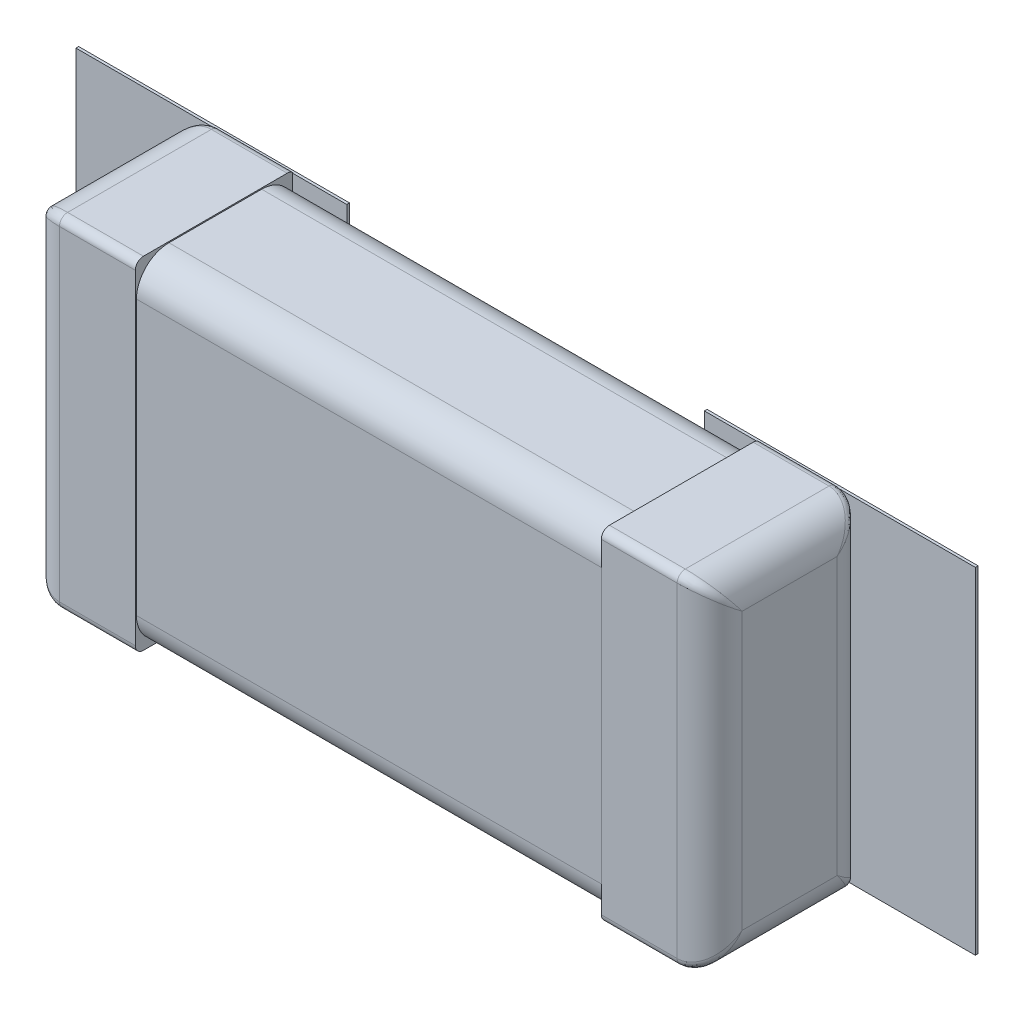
ISO-10303-21;
HEADER;
FILE_DESCRIPTION(('STEP AP214'),'2;1');
FILE_NAME('part.step','',(''),(''),'','','');
FILE_SCHEMA(('AUTOMOTIVE_DESIGN { 1 0 10303 214 1 1 1 1 }'));
ENDSEC;
DATA;
#1=APPLICATION_CONTEXT('core data for automotive mechanical design processes');
#2=APPLICATION_PROTOCOL_DEFINITION('international standard','automotive_design',2000,#1);
#3=PRODUCT_CONTEXT('',#1,'mechanical');
#4=PRODUCT('Part','Part','',(#3));
#5=PRODUCT_RELATED_PRODUCT_CATEGORY('part','',(#4));
#6=PRODUCT_DEFINITION_FORMATION('','',#4);
#7=PRODUCT_DEFINITION_CONTEXT('part definition',#1,'design');
#8=PRODUCT_DEFINITION('design','',#6,#7);
#9=PRODUCT_DEFINITION_SHAPE('','',#8);
#10=(LENGTH_UNIT() NAMED_UNIT(*) SI_UNIT(.MILLI.,.METRE.));
#11=(NAMED_UNIT(*) PLANE_ANGLE_UNIT() SI_UNIT($,.RADIAN.));
#12=(NAMED_UNIT(*) SI_UNIT($,.STERADIAN.) SOLID_ANGLE_UNIT());
#13=UNCERTAINTY_MEASURE_WITH_UNIT(LENGTH_MEASURE(1.E-05),#10,'distance_accuracy_value','');
#14=(GEOMETRIC_REPRESENTATION_CONTEXT(3) GLOBAL_UNCERTAINTY_ASSIGNED_CONTEXT((#13)) GLOBAL_UNIT_ASSIGNED_CONTEXT((#10,
#11,#12)) REPRESENTATION_CONTEXT('',''));
#15=CARTESIAN_POINT('',(0.,0.,0.));
#16=DIRECTION('',(0.,0.,1.));
#17=DIRECTION('',(1.,0.,0.));
#18=AXIS2_PLACEMENT_3D('',#15,#16,#17);
#19=CARTESIAN_POINT('',(-1.4478,-2.88612072,0.2286));
#20=DIRECTION('',(0.,1.,0.));
#21=DIRECTION('',(0.,0.,1.));
#22=AXIS2_PLACEMENT_3D('',#19,#20,#21);
#23=CYLINDRICAL_SURFACE('',#22,0.1524);
#24=CARTESIAN_POINT('',(-1.44453042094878,0.761974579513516,0.0762360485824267));
#25=CARTESIAN_POINT('',(-1.4534159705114,0.762115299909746,0.0760484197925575));
#26=CARTESIAN_POINT('',(-1.47319839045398,0.761131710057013,0.0773598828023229));
#27=CARTESIAN_POINT('',(-1.5031895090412,0.755124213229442,0.0853699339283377));
#28=CARTESIAN_POINT('',(-1.53321218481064,0.743528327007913,0.100831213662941));
#29=CARTESIAN_POINT('',(-1.560310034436,0.72638612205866,0.123687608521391));
#30=CARTESIAN_POINT('',(-1.58241816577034,0.703798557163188,0.153804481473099));
#31=CARTESIAN_POINT('',(-1.59688285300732,0.676898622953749,0.189671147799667));
#32=CARTESIAN_POINT('',(-1.60029461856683,0.656950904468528,0.216268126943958));
#33=CARTESIAN_POINT('',(-1.60019482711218,0.646421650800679,0.230307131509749));
#34=CARTESIAN_POINT('',(-1.60018182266,0.645781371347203,0.231160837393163));
#35=(BOUNDED_CURVE() B_SPLINE_CURVE(3,(#24,#25,#26,#27,#28,#29,#30,#31,#32,#33,#34),
.UNSPECIFIED.,.F.,.F.) B_SPLINE_CURVE_WITH_KNOTS((4,1,1,1,1,1,1,1,4),(-0.01161596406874,
0.08290265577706,0.19763203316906,0.32252970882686,0.46268972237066,0.61988014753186,
0.79433574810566,0.97384555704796,0.9854615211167),
.UNSPECIFIED.) CURVE() GEOMETRIC_REPRESENTATION_ITEM() RATIONAL_B_SPLINE_CURVE((1.17153754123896,
1.17153754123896,1.17153754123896,1.17153754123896,1.17153754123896,1.17153754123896,
1.17153754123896,1.17153754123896,1.17153754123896,1.17153754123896,1.17153754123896)) REPRESENTATION_ITEM(''));
#36=CARTESIAN_POINT('',(-1.60019999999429,0.647700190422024,0.228600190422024));
#37=VERTEX_POINT('',#36);
#38=CARTESIAN_POINT('',(-1.50870652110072,0.75247652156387,0.0889000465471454));
#39=VERTEX_POINT('',#38);
#40=EDGE_CURVE('E213',#37,#39,#35,.F.);
#41=ORIENTED_EDGE('',*,*,#40,.T.);
#42=DIRECTION('',(0.,1.,0.));
#43=VECTOR('',#42,1.);
#44=CARTESIAN_POINT('',(-1.50870853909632,0.,0.0889));
#45=LINE('',#44,#43);
#46=CARTESIAN_POINT('',(-1.50870849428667,-0.752474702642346,0.0889001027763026));
#47=VERTEX_POINT('',#46);
#48=EDGE_CURVE('E1241',#47,#39,#45,.T.);
#49=ORIENTED_EDGE('',*,*,#48,.F.);
#50=CARTESIAN_POINT('',(-1.60020000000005,-0.647699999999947,0.228599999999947));
#51=CARTESIAN_POINT('',(-1.60019762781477,-0.649379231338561,0.226364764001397));
#52=CARTESIAN_POINT('',(-1.60014742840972,-0.651059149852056,0.224130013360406));
#53=CARTESIAN_POINT('',(-1.59994235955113,-0.654549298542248,0.219487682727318));
#54=CARTESIAN_POINT('',(-1.59977956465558,-0.656359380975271,0.217080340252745));
#55=CARTESIAN_POINT('',(-1.59932350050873,-0.660106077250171,0.212094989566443));
#56=CARTESIAN_POINT('',(-1.59902153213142,-0.662042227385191,0.209517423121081));
#57=CARTESIAN_POINT('',(-1.59825894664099,-0.666037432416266,0.204195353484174));
#58=CARTESIAN_POINT('',(-1.5977887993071,-0.668095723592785,0.20145163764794));
#59=CARTESIAN_POINT('',(-1.59665931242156,-0.672331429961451,0.195802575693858));
#60=CARTESIAN_POINT('',(-1.59598954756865,-0.674507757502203,0.192898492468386));
#61=CARTESIAN_POINT('',(-1.59442877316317,-0.678975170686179,0.186937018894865));
#62=CARTESIAN_POINT('',(-1.59352647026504,-0.681264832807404,0.18388151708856));
#63=CARTESIAN_POINT('',(-1.59146441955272,-0.685948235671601,0.177631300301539));
#64=CARTESIAN_POINT('',(-1.59029254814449,-0.688340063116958,0.174439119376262));
#65=CARTESIAN_POINT('',(-1.58833971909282,-0.691944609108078,0.169628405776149));
#66=CARTESIAN_POINT('',(-1.58764033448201,-0.693173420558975,0.167988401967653));
#67=CARTESIAN_POINT('',(-1.58616079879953,-0.69565091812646,0.164681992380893));
#68=CARTESIAN_POINT('',(-1.58537898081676,-0.696899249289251,0.163016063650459));
#69=CARTESIAN_POINT('',(-1.58372933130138,-0.699413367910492,0.15966117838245));
#70=CARTESIAN_POINT('',(-1.58285978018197,-0.700678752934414,0.157972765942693));
#71=CARTESIAN_POINT('',(-1.58102936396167,-0.703224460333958,0.154576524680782));
#72=CARTESIAN_POINT('',(-1.58006672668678,-0.704504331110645,0.152869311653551));
#73=CARTESIAN_POINT('',(-1.57804453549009,-0.707075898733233,0.149439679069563));
#74=CARTESIAN_POINT('',(-1.57698315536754,-0.708367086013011,0.147717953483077));
#75=CARTESIAN_POINT('',(-1.5747571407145,-0.710957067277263,0.144264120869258));
#76=CARTESIAN_POINT('',(-1.57359061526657,-0.712255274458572,0.14253279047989));
#77=CARTESIAN_POINT('',(-1.57135909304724,-0.714630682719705,0.13936489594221));
#78=CARTESIAN_POINT('',(-1.57030532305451,-0.715711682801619,0.137923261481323));
#79=CARTESIAN_POINT('',(-1.56816980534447,-0.717823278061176,0.135108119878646));
#80=CARTESIAN_POINT('',(-1.56708964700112,-0.718854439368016,0.133733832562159));
#81=CARTESIAN_POINT('',(-1.5649060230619,-0.720866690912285,0.131052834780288));
#82=CARTESIAN_POINT('',(-1.56380409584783,-0.721848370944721,0.12974531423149));
#83=CARTESIAN_POINT('',(-1.56158156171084,-0.723762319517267,0.127197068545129));
#84=CARTESIAN_POINT('',(-1.56046243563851,-0.72469519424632,0.125955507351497));
#85=CARTESIAN_POINT('',(-1.55821017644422,-0.726512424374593,0.123538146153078));
#86=CARTESIAN_POINT('',(-1.55707846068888,-0.727397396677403,0.122361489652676));
#87=CARTESIAN_POINT('',(-1.55480550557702,-0.729119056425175,0.120073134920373));
#88=CARTESIAN_POINT('',(-1.55366564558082,-0.729956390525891,0.118960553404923));
#89=CARTESIAN_POINT('',(-1.55138072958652,-0.731582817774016,0.116799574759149));
#90=CARTESIAN_POINT('',(-1.55023702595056,-0.732372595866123,0.115750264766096));
#91=CARTESIAN_POINT('',(-1.54794876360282,-0.733904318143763,0.113714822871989));
#92=CARTESIAN_POINT('',(-1.54680551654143,-0.734646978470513,0.112727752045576));
#93=CARTESIAN_POINT('',(-1.54344110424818,-0.736766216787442,0.109909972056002));
#94=CARTESIAN_POINT('',(-1.54117156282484,-0.738114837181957,0.108115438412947));
#95=CARTESIAN_POINT('',(-1.53667197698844,-0.740629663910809,0.10476466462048));
#96=CARTESIAN_POINT('',(-1.53445117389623,-0.741801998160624,0.103200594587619));
#97=CARTESIAN_POINT('',(-1.53007937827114,-0.743976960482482,0.100295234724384));
#98=CARTESIAN_POINT('',(-1.52793664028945,-0.74498568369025,0.0989460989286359));
#99=CARTESIAN_POINT('',(-1.52375133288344,-0.746845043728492,0.0964552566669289));
#100=CARTESIAN_POINT('',(-1.52171615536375,-0.747701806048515,0.0953057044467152));
#101=CARTESIAN_POINT('',(-1.51777304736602,-0.749271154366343,0.0931974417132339));
#102=CARTESIAN_POINT('',(-1.5158716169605,-0.749989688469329,0.0922310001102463));
#103=CARTESIAN_POINT('',(-1.51221945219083,-0.751300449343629,0.0904709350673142));
#104=CARTESIAN_POINT('',(-1.51047420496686,-0.751897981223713,0.0896698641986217));
#105=CARTESIAN_POINT('',(-1.50870854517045,-0.752474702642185,0.0888999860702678));
#106=B_SPLINE_CURVE_WITH_KNOTS('',3,(#50,#51,#52,#53,#54,#55,#56,#57,#58,#59,#60,#61,#62,#63,
#64,#65,#66,#67,#68,#69,#70,#71,#72,#73,#74,#75,#76,#77,#78,#79,#80,#81,#82,#83,#84,#85,#86,#87,
#88,#89,#90,#91,#92,#93,#94,#95,#96,#97,#98,#99,#100,#101,#102,#103,#104,#105),.UNSPECIFIED.,
.F.,.F.,(4,2,2,2,2,2,2,2,2,2,2,2,2,2,2,2,2,2,2,2,2,2,2,2,2,2,2,4),(0.,0.00838689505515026,
0.0174337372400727,0.0271445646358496,0.0375271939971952,0.0485939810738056,0.0603590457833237,
0.0728241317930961,0.0793193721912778,0.0859893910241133,0.0928345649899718,0.0998556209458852,
0.10705291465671,0.11442630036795,0.120687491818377,0.12677482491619,0.132688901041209,
0.138430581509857,0.144000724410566,0.149398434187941,0.15462211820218,0.159670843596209,
0.169241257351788,0.178112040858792,0.186284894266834,0.19375007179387,0.2004997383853,
0.206531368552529),.UNSPECIFIED.);
#107=CARTESIAN_POINT('',(-1.60019999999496,-0.647699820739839,0.228599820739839));
#108=VERTEX_POINT('',#107);
#109=EDGE_CURVE('E224',#47,#108,#106,.F.);
#110=ORIENTED_EDGE('',*,*,#109,.T.);
#111=DIRECTION('',(0.,1.,0.));
#112=VECTOR('',#111,1.);
#113=CARTESIAN_POINT('',(-1.6002,0.8001,0.2286));
#114=LINE('',#113,#112);
#115=EDGE_CURVE('E1135',#37,#108,#114,.F.);
#116=ORIENTED_EDGE('',*,*,#115,.F.);
#117=EDGE_LOOP('',(#41,#49,#110,#116));
#118=FACE_BOUND('',#117,.T.);
#119=ADVANCED_FACE('F16',(#118),#23,.T.);
#120=CARTESIAN_POINT('',(0.,0.,0.0889));
#121=DIRECTION('',(0.,0.,1.));
#122=DIRECTION('',(1.,0.,0.));
#123=AXIS2_PLACEMENT_3D('',#120,#121,#122);
#124=PLANE('',#123);
#125=DIRECTION('',(0.,1.,0.));
#126=VECTOR('',#125,1.);
#127=CARTESIAN_POINT('',(-2.1079968,0.7875016,0.0889));
#128=LINE('',#127,#126);
#129=CARTESIAN_POINT('',(-2.1079968,-0.7875016,0.0889));
#130=VERTEX_POINT('',#129);
#131=CARTESIAN_POINT('',(-2.1079968,0.7875016,0.0889));
#132=VERTEX_POINT('',#131);
#133=EDGE_CURVE('E286',#130,#132,#128,.T.);
#134=ORIENTED_EDGE('',*,*,#133,.F.);
#135=DIRECTION('',(1.,0.,0.));
#136=VECTOR('',#135,1.);
#137=CARTESIAN_POINT('',(0.,-0.7875016,0.0889));
#138=LINE('',#137,#136);
#139=CARTESIAN_POINT('',(-1.47011114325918,-0.7875016,0.088900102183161));
#140=VERTEX_POINT('',#139);
#141=EDGE_CURVE('E289',#130,#140,#138,.T.);
#142=ORIENTED_EDGE('',*,*,#141,.T.);
#143=CARTESIAN_POINT('',(-1.47011111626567,-0.787501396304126,0.0889000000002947));
#144=CARTESIAN_POINT('',(-1.47403376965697,-0.786447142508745,0.0888999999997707));
#145=CARTESIAN_POINT('',(-1.47789981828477,-0.785100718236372,0.0888999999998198));
#146=CARTESIAN_POINT('',(-1.48537415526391,-0.781752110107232,0.0889000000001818));
#147=CARTESIAN_POINT('',(-1.48897983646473,-0.779744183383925,0.088900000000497));
#148=CARTESIAN_POINT('',(-1.49590392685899,-0.774883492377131,0.0889000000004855));
#149=CARTESIAN_POINT('',(-1.49919433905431,-0.771989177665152,0.0889000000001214));
#150=CARTESIAN_POINT('',(-1.50408743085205,-0.766062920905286,0.0888999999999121));
#151=CARTESIAN_POINT('',(-1.50590562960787,-0.763230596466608,0.0888999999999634));
#152=CARTESIAN_POINT('',(-1.50808237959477,-0.757741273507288,0.0889000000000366));
#153=CARTESIAN_POINT('',(-1.50866418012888,-0.755167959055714,0.0889000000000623));
#154=CARTESIAN_POINT('',(-1.50870857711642,-0.752474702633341,0.0889000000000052));
#155=B_SPLINE_CURVE_WITH_KNOTS('',3,(#143,#144,#145,#146,#147,#148,#149,#150,#151,#152,#153,
#154),.UNSPECIFIED.,.F.,.F.,(4,2,2,2,2,4),(0.,0.0122068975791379,0.0245226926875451,
0.0375388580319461,0.047432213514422,0.0552914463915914),.UNSPECIFIED.);
#156=EDGE_CURVE('E1243',#140,#47,#155,.T.);
#157=ORIENTED_EDGE('',*,*,#156,.T.);
#158=ORIENTED_EDGE('',*,*,#48,.T.);
#159=CARTESIAN_POINT('',(-1.5087059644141,0.752476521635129,0.0889000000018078));
#160=CARTESIAN_POINT('',(-1.50867380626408,0.754931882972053,0.0889000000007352));
#161=CARTESIAN_POINT('',(-1.50818268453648,0.757296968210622,0.0889000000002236));
#162=CARTESIAN_POINT('',(-1.50622607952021,0.762635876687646,0.088899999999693));
#163=CARTESIAN_POINT('',(-1.50446541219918,0.765507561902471,0.0888999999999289));
#164=CARTESIAN_POINT('',(-1.50078832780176,0.770120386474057,0.088900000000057));
#165=CARTESIAN_POINT('',(-1.49898999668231,0.771971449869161,0.088900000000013));
#166=CARTESIAN_POINT('',(-1.49512395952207,0.775383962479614,0.0888999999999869));
#167=CARTESIAN_POINT('',(-1.49305553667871,0.776944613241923,0.0889000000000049));
#168=CARTESIAN_POINT('',(-1.4877035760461,0.780472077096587,0.0889000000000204));
#169=CARTESIAN_POINT('',(-1.48431353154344,0.78227401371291,0.088900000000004));
#170=CARTESIAN_POINT('',(-1.47733399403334,0.785296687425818,0.0888999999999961));
#171=CARTESIAN_POINT('',(-1.47374771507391,0.786524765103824,0.0889000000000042));
#172=CARTESIAN_POINT('',(-1.47011202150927,0.787501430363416,0.0889000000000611));
#173=B_SPLINE_CURVE_WITH_KNOTS('',3,(#159,#160,#161,#162,#163,#164,#165,#166,#167,#168,#169,
#170,#171,#172),.UNSPECIFIED.,.F.,.F.,(4,2,2,2,2,2,4),(0.,0.00719749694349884,
0.0170805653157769,0.0248042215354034,0.0325488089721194,0.0440126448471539,0.0553255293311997),.UNSPECIFIED.);
#174=CARTESIAN_POINT('',(-1.47011202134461,0.787501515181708,0.0889000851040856));
#175=VERTEX_POINT('',#174);
#176=EDGE_CURVE('E205',#39,#175,#173,.T.);
#177=ORIENTED_EDGE('',*,*,#176,.T.);
#178=DIRECTION('',(1.,0.,0.));
#179=VECTOR('',#178,1.);
#180=CARTESIAN_POINT('',(0.,0.7875016,0.0889));
#181=LINE('',#180,#179);
#182=EDGE_CURVE('E283',#175,#132,#181,.F.);
#183=ORIENTED_EDGE('',*,*,#182,.T.);
#184=EDGE_LOOP('',(#134,#142,#157,#158,#177,#183));
#185=FACE_BOUND('',#184,.T.);
#186=ADVANCED_FACE('F284',(#185),#124,.T.);
#187=CARTESIAN_POINT('',(1.4478,2.88612072,0.2286));
#188=DIRECTION('',(0.,-1.,0.));
#189=DIRECTION('',(0.,0.,-1.));
#190=AXIS2_PLACEMENT_3D('',#187,#188,#189);
#191=CYLINDRICAL_SURFACE('',#190,0.1524);
#192=CARTESIAN_POINT('',(1.44453042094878,-0.761974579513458,0.0762360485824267));
#193=CARTESIAN_POINT('',(1.45341597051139,-0.762115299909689,0.0760484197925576));
#194=CARTESIAN_POINT('',(1.47319839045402,-0.761131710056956,0.0773598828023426));
#195=CARTESIAN_POINT('',(1.50318950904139,-0.755124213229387,0.0853699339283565));
#196=CARTESIAN_POINT('',(1.53321218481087,-0.743528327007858,0.100831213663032));
#197=CARTESIAN_POINT('',(1.56031003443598,-0.726386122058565,0.123687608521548));
#198=CARTESIAN_POINT('',(1.58241816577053,-0.703798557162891,0.153804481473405));
#199=CARTESIAN_POINT('',(1.59688285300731,-0.676898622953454,0.189671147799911));
#200=CARTESIAN_POINT('',(1.60029461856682,-0.656950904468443,0.21626812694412));
#201=CARTESIAN_POINT('',(1.60019482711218,-0.646421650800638,0.230307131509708));
#202=CARTESIAN_POINT('',(1.60018182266,-0.645781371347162,0.231160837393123));
#203=(BOUNDED_CURVE() B_SPLINE_CURVE(3,(#192,#193,#194,#195,#196,#197,#198,#199,#200,#201,#202),
.UNSPECIFIED.,.F.,.F.) B_SPLINE_CURVE_WITH_KNOTS((4,1,1,1,1,1,1,1,4),(-0.01161596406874,
0.08290265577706,0.19763203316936,0.32252970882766,0.46268972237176,0.61988014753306,
0.79433574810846,0.97384555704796,0.9854615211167),
.UNSPECIFIED.) CURVE() GEOMETRIC_REPRESENTATION_ITEM() RATIONAL_B_SPLINE_CURVE((1.1715375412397,
1.1715375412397,1.1715375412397,1.1715375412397,1.1715375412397,1.1715375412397,1.1715375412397,
1.1715375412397,1.1715375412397,1.1715375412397,1.1715375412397)) REPRESENTATION_ITEM(''));
#204=CARTESIAN_POINT('',(1.60019999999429,-0.647700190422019,0.228600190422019));
#205=VERTEX_POINT('',#204);
#206=CARTESIAN_POINT('',(1.50870652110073,-0.75247652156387,0.0889000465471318));
#207=VERTEX_POINT('',#206);
#208=EDGE_CURVE('E1213',#205,#207,#203,.F.);
#209=ORIENTED_EDGE('',*,*,#208,.T.);
#210=DIRECTION('',(0.,1.,0.));
#211=VECTOR('',#210,1.);
#212=CARTESIAN_POINT('',(1.50870853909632,0.,0.0889));
#213=LINE('',#212,#211);
#214=CARTESIAN_POINT('',(1.50870849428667,0.752474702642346,0.0889001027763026));
#215=VERTEX_POINT('',#214);
#216=EDGE_CURVE('E600',#215,#207,#213,.F.);
#217=ORIENTED_EDGE('',*,*,#216,.F.);
#218=CARTESIAN_POINT('',(1.60020000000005,0.647699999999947,0.228599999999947));
#219=CARTESIAN_POINT('',(1.60019762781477,0.649379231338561,0.226364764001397));
#220=CARTESIAN_POINT('',(1.60014742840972,0.651059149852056,0.224130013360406));
#221=CARTESIAN_POINT('',(1.59994235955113,0.654549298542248,0.219487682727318));
#222=CARTESIAN_POINT('',(1.59977956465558,0.656359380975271,0.217080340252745));
#223=CARTESIAN_POINT('',(1.59932350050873,0.660106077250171,0.212094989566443));
#224=CARTESIAN_POINT('',(1.59902153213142,0.662042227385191,0.209517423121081));
#225=CARTESIAN_POINT('',(1.59825894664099,0.666037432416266,0.204195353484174));
#226=CARTESIAN_POINT('',(1.5977887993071,0.668095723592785,0.20145163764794));
#227=CARTESIAN_POINT('',(1.59665931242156,0.672331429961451,0.195802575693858));
#228=CARTESIAN_POINT('',(1.59598954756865,0.674507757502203,0.192898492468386));
#229=CARTESIAN_POINT('',(1.59442877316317,0.678975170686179,0.186937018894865));
#230=CARTESIAN_POINT('',(1.59352647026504,0.681264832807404,0.18388151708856));
#231=CARTESIAN_POINT('',(1.59146441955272,0.685948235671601,0.177631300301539));
#232=CARTESIAN_POINT('',(1.59029254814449,0.688340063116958,0.174439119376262));
#233=CARTESIAN_POINT('',(1.58833971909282,0.691944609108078,0.169628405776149));
#234=CARTESIAN_POINT('',(1.58764033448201,0.693173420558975,0.167988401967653));
#235=CARTESIAN_POINT('',(1.58616079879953,0.69565091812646,0.164681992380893));
#236=CARTESIAN_POINT('',(1.58537898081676,0.696899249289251,0.163016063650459));
#237=CARTESIAN_POINT('',(1.58372933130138,0.699413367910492,0.15966117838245));
#238=CARTESIAN_POINT('',(1.58285978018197,0.700678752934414,0.157972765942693));
#239=CARTESIAN_POINT('',(1.58102936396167,0.703224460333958,0.154576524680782));
#240=CARTESIAN_POINT('',(1.58006672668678,0.704504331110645,0.152869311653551));
#241=CARTESIAN_POINT('',(1.57804453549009,0.707075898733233,0.149439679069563));
#242=CARTESIAN_POINT('',(1.57698315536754,0.708367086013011,0.147717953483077));
#243=CARTESIAN_POINT('',(1.5747571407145,0.710957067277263,0.144264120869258));
#244=CARTESIAN_POINT('',(1.57359061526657,0.712255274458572,0.14253279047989));
#245=CARTESIAN_POINT('',(1.57135909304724,0.714630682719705,0.13936489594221));
#246=CARTESIAN_POINT('',(1.57030532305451,0.715711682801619,0.137923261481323));
#247=CARTESIAN_POINT('',(1.56816980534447,0.717823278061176,0.135108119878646));
#248=CARTESIAN_POINT('',(1.56708964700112,0.718854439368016,0.133733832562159));
#249=CARTESIAN_POINT('',(1.5649060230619,0.720866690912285,0.131052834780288));
#250=CARTESIAN_POINT('',(1.56380409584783,0.721848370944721,0.12974531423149));
#251=CARTESIAN_POINT('',(1.56158156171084,0.723762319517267,0.127197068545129));
#252=CARTESIAN_POINT('',(1.56046243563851,0.72469519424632,0.125955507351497));
#253=CARTESIAN_POINT('',(1.55821017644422,0.726512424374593,0.123538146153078));
#254=CARTESIAN_POINT('',(1.55707846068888,0.727397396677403,0.122361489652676));
#255=CARTESIAN_POINT('',(1.55480550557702,0.729119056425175,0.120073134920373));
#256=CARTESIAN_POINT('',(1.55366564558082,0.729956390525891,0.118960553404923));
#257=CARTESIAN_POINT('',(1.55138072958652,0.731582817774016,0.116799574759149));
#258=CARTESIAN_POINT('',(1.55023702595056,0.732372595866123,0.115750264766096));
#259=CARTESIAN_POINT('',(1.54794876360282,0.733904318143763,0.113714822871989));
#260=CARTESIAN_POINT('',(1.54680551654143,0.734646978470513,0.112727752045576));
#261=CARTESIAN_POINT('',(1.54344110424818,0.736766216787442,0.109909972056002));
#262=CARTESIAN_POINT('',(1.54117156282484,0.738114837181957,0.108115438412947));
#263=CARTESIAN_POINT('',(1.53667197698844,0.740629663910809,0.10476466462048));
#264=CARTESIAN_POINT('',(1.53445117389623,0.741801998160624,0.103200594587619));
#265=CARTESIAN_POINT('',(1.53007937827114,0.743976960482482,0.100295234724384));
#266=CARTESIAN_POINT('',(1.52793664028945,0.74498568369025,0.0989460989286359));
#267=CARTESIAN_POINT('',(1.52375133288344,0.746845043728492,0.0964552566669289));
#268=CARTESIAN_POINT('',(1.52171615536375,0.747701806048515,0.0953057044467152));
#269=CARTESIAN_POINT('',(1.51777304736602,0.749271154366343,0.0931974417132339));
#270=CARTESIAN_POINT('',(1.5158716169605,0.749989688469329,0.0922310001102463));
#271=CARTESIAN_POINT('',(1.51221945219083,0.751300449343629,0.0904709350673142));
#272=CARTESIAN_POINT('',(1.51047420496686,0.751897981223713,0.0896698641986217));
#273=CARTESIAN_POINT('',(1.50870854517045,0.752474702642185,0.0888999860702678));
#274=B_SPLINE_CURVE_WITH_KNOTS('',3,(#218,#219,#220,#221,#222,#223,#224,#225,#226,#227,#228,
#229,#230,#231,#232,#233,#234,#235,#236,#237,#238,#239,#240,#241,#242,#243,#244,#245,#246,#247,
#248,#249,#250,#251,#252,#253,#254,#255,#256,#257,#258,#259,#260,#261,#262,#263,#264,#265,#266,
#267,#268,#269,#270,#271,#272,#273),.UNSPECIFIED.,.F.,.F.,(4,2,2,2,2,2,2,2,2,2,2,2,2,2,2,2,2,2,
2,2,2,2,2,2,2,2,2,4),(0.,0.00838689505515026,0.0174337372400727,0.0271445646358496,
0.0375271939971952,0.0485939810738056,0.0603590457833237,0.0728241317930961,0.0793193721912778,
0.0859893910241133,0.0928345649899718,0.0998556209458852,0.10705291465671,0.11442630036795,
0.120687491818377,0.12677482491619,0.132688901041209,0.138430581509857,0.144000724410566,
0.149398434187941,0.15462211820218,0.159670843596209,0.169241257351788,0.178112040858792,
0.186284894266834,0.19375007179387,0.2004997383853,0.206531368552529),.UNSPECIFIED.);
#275=CARTESIAN_POINT('',(1.60019999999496,0.647699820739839,0.228599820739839));
#276=VERTEX_POINT('',#275);
#277=EDGE_CURVE('E986',#215,#276,#274,.F.);
#278=ORIENTED_EDGE('',*,*,#277,.T.);
#279=DIRECTION('',(0.,1.,0.));
#280=VECTOR('',#279,1.);
#281=CARTESIAN_POINT('',(1.6002,-0.8001,0.2286));
#282=LINE('',#281,#280);
#283=EDGE_CURVE('E859',#205,#276,#282,.T.);
#284=ORIENTED_EDGE('',*,*,#283,.F.);
#285=EDGE_LOOP('',(#209,#217,#278,#284));
#286=FACE_BOUND('',#285,.T.);
#287=ADVANCED_FACE('F622',(#286),#191,.T.);
#288=CARTESIAN_POINT('',(0.,0.,0.0889));
#289=DIRECTION('',(0.,0.,1.));
#290=DIRECTION('',(1.,0.,0.));
#291=AXIS2_PLACEMENT_3D('',#288,#289,#290);
#292=PLANE('',#291);
#293=DIRECTION('',(0.,1.,0.));
#294=VECTOR('',#293,1.);
#295=CARTESIAN_POINT('',(2.1079968,-0.7875016,0.0889));
#296=LINE('',#295,#294);
#297=CARTESIAN_POINT('',(2.1079968,0.7875016,0.0889));
#298=VERTEX_POINT('',#297);
#299=CARTESIAN_POINT('',(2.1079968,-0.7875016,0.0889));
#300=VERTEX_POINT('',#299);
#301=EDGE_CURVE('E1263',#298,#300,#296,.F.);
#302=ORIENTED_EDGE('',*,*,#301,.F.);
#303=DIRECTION('',(1.,0.,0.));
#304=VECTOR('',#303,1.);
#305=CARTESIAN_POINT('',(0.,0.7875016,0.0889));
#306=LINE('',#305,#304);
#307=CARTESIAN_POINT('',(1.47011114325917,0.7875016,0.088900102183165));
#308=VERTEX_POINT('',#307);
#309=EDGE_CURVE('E1137',#298,#308,#306,.F.);
#310=ORIENTED_EDGE('',*,*,#309,.T.);
#311=CARTESIAN_POINT('',(1.47011111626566,0.787501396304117,0.0889000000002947));
#312=CARTESIAN_POINT('',(1.47403376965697,0.786447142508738,0.0888999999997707));
#313=CARTESIAN_POINT('',(1.47789981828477,0.785100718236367,0.0888999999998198));
#314=CARTESIAN_POINT('',(1.48537415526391,0.781752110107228,0.0889000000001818));
#315=CARTESIAN_POINT('',(1.48897983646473,0.779744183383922,0.0889000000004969));
#316=CARTESIAN_POINT('',(1.49590392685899,0.774883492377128,0.0889000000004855));
#317=CARTESIAN_POINT('',(1.49919433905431,0.77198917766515,0.0889000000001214));
#318=CARTESIAN_POINT('',(1.50408743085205,0.766062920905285,0.0888999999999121));
#319=CARTESIAN_POINT('',(1.50590562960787,0.763230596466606,0.0888999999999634));
#320=CARTESIAN_POINT('',(1.50808237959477,0.757741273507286,0.0889000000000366));
#321=CARTESIAN_POINT('',(1.50866418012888,0.755167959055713,0.0889000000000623));
#322=CARTESIAN_POINT('',(1.50870857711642,0.752474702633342,0.0889000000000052));
#323=B_SPLINE_CURVE_WITH_KNOTS('',3,(#311,#312,#313,#314,#315,#316,#317,#318,#319,#320,#321,
#322),.UNSPECIFIED.,.F.,.F.,(4,2,2,2,2,4),(0.,0.0122068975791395,0.0245226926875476,
0.0375388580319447,0.0474322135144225,0.0552914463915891),.UNSPECIFIED.);
#324=EDGE_CURVE('E608',#308,#215,#323,.T.);
#325=ORIENTED_EDGE('',*,*,#324,.T.);
#326=ORIENTED_EDGE('',*,*,#216,.T.);
#327=CARTESIAN_POINT('',(1.50870596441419,-0.752476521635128,0.0889000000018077));
#328=CARTESIAN_POINT('',(1.50867380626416,-0.754931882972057,0.0889000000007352));
#329=CARTESIAN_POINT('',(1.50818268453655,-0.75729696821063,0.0889000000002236));
#330=CARTESIAN_POINT('',(1.50622607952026,-0.76263587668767,0.088899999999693));
#331=CARTESIAN_POINT('',(1.50446541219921,-0.765507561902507,0.0888999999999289));
#332=CARTESIAN_POINT('',(1.50078832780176,-0.770120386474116,0.088900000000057));
#333=CARTESIAN_POINT('',(1.49898999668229,-0.771971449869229,0.088900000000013));
#334=CARTESIAN_POINT('',(1.49512395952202,-0.775383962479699,0.0888999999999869));
#335=CARTESIAN_POINT('',(1.49305553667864,-0.776944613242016,0.0889000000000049));
#336=CARTESIAN_POINT('',(1.48770357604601,-0.780472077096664,0.0889000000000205));
#337=CARTESIAN_POINT('',(1.48431353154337,-0.782274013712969,0.088900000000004));
#338=CARTESIAN_POINT('',(1.47733399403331,-0.785296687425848,0.088899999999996));
#339=CARTESIAN_POINT('',(1.4737477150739,-0.786524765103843,0.0889000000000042));
#340=CARTESIAN_POINT('',(1.47011202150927,-0.787501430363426,0.0889000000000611));
#341=B_SPLINE_CURVE_WITH_KNOTS('',3,(#327,#328,#329,#330,#331,#332,#333,#334,#335,#336,#337,
#338,#339,#340),.UNSPECIFIED.,.F.,.F.,(4,2,2,2,2,2,4),(0.,0.00719749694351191,0.01708056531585,
0.0248042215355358,0.0325488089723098,0.0440126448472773,0.0553255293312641),.UNSPECIFIED.);
#342=CARTESIAN_POINT('',(1.47011202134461,-0.787501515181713,0.0889000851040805));
#343=VERTEX_POINT('',#342);
#344=EDGE_CURVE('E597',#207,#343,#341,.T.);
#345=ORIENTED_EDGE('',*,*,#344,.T.);
#346=DIRECTION('',(1.,0.,0.));
#347=VECTOR('',#346,1.);
#348=CARTESIAN_POINT('',(0.,-0.7875016,0.0889));
#349=LINE('',#348,#347);
#350=EDGE_CURVE('E599',#343,#300,#349,.T.);
#351=ORIENTED_EDGE('',*,*,#350,.T.);
#352=EDGE_LOOP('',(#302,#310,#325,#326,#345,#351));
#353=FACE_BOUND('',#352,.T.);
#354=ADVANCED_FACE('F616',(#353),#292,.T.);
#355=CARTESIAN_POINT('',(-1.6002,0.8001,0.0762));
#356=DIRECTION('',(-1.,0.,0.));
#357=DIRECTION('',(0.,0.,1.));
#358=AXIS2_PLACEMENT_3D('',#355,#356,#357);
#359=PLANE('',#358);
#360=DIRECTION('',(0.,0.,-1.));
#361=VECTOR('',#360,1.);
#362=CARTESIAN_POINT('',(-1.6002,-0.6477,1.8040428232));
#363=LINE('',#362,#361);
#364=CARTESIAN_POINT('',(-1.60019999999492,-0.647700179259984,0.673861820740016));
#365=VERTEX_POINT('',#364);
#366=EDGE_CURVE('E232',#365,#108,#363,.T.);
#367=ORIENTED_EDGE('',*,*,#366,.F.);
#368=DIRECTION('',(0.,-1.,0.));
#369=VECTOR('',#368,1.);
#370=CARTESIAN_POINT('',(-1.6002,2.88612072,0.673862));
#371=LINE('',#370,#369);
#372=CARTESIAN_POINT('',(-1.60019999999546,0.647699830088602,0.673862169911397));
#373=VERTEX_POINT('',#372);
#374=EDGE_CURVE('E460',#373,#365,#371,.T.);
#375=ORIENTED_EDGE('',*,*,#374,.F.);
#376=DIRECTION('',(0.,0.,-1.));
#377=VECTOR('',#376,1.);
#378=CARTESIAN_POINT('',(-1.6002,0.6477,1.8040428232));
#379=LINE('',#378,#377);
#380=EDGE_CURVE('E365',#37,#373,#379,.F.);
#381=ORIENTED_EDGE('',*,*,#380,.F.);
#382=ORIENTED_EDGE('',*,*,#115,.T.);
#383=EDGE_LOOP('',(#367,#375,#381,#382));
#384=FACE_BOUND('',#383,.T.);
#385=ADVANCED_FACE('F621',(#384),#359,.T.);
#386=CARTESIAN_POINT('',(-2.1079968,0.7875016,0.0762));
#387=DIRECTION('',(-1.,0.,0.));
#388=DIRECTION('',(0.,0.,1.));
#389=AXIS2_PLACEMENT_3D('',#386,#387,#388);
#390=PLANE('',#389);
#391=DIRECTION('',(0.,0.,1.));
#392=VECTOR('',#391,1.);
#393=CARTESIAN_POINT('',(-2.1079968,0.7875016,0.0762));
#394=LINE('',#393,#392);
#395=CARTESIAN_POINT('',(-2.1079968,0.7875016,0.0762));
#396=VERTEX_POINT('',#395);
#397=EDGE_CURVE('E293',#132,#396,#394,.F.);
#398=ORIENTED_EDGE('',*,*,#397,.T.);
#399=DIRECTION('',(0.,1.,0.));
#400=VECTOR('',#399,1.);
#401=CARTESIAN_POINT('',(-2.1079968,0.,0.0762));
#402=LINE('',#401,#400);
#403=CARTESIAN_POINT('',(-2.1079968,-0.7875016,0.0762));
#404=VERTEX_POINT('',#403);
#405=EDGE_CURVE('E357',#396,#404,#402,.F.);
#406=ORIENTED_EDGE('',*,*,#405,.T.);
#407=DIRECTION('',(0.,0.,1.));
#408=VECTOR('',#407,1.);
#409=CARTESIAN_POINT('',(-2.1079968,-0.7875016,0.0762));
#410=LINE('',#409,#408);
#411=EDGE_CURVE('E279',#404,#130,#410,.T.);
#412=ORIENTED_EDGE('',*,*,#411,.T.);
#413=ORIENTED_EDGE('',*,*,#133,.T.);
#414=EDGE_LOOP('',(#398,#406,#412,#413));
#415=FACE_BOUND('',#414,.T.);
#416=ADVANCED_FACE('F292',(#415),#390,.T.);
#417=CARTESIAN_POINT('',(-0.8379968,-0.7875016,0.0762));
#418=DIRECTION('',(1.,0.,0.));
#419=DIRECTION('',(0.,0.,-1.));
#420=AXIS2_PLACEMENT_3D('',#417,#418,#419);
#421=PLANE('',#420);
#422=CARTESIAN_POINT('',(-0.837996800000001,0.642366,0.233934));
#423=DIRECTION('',(-1.,0.,0.));
#424=DIRECTION('',(0.,0.,1.));
#425=AXIS2_PLACEMENT_3D('',#422,#423,#424);
#426=CIRCLE('',#425,0.1524);
#427=CARTESIAN_POINT('',(-0.8379968,0.689173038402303,0.0889));
#428=VERTEX_POINT('',#427);
#429=CARTESIAN_POINT('',(-0.837996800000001,0.642366,0.081534));
#430=VERTEX_POINT('',#429);
#431=EDGE_CURVE('E593',#428,#430,#426,.T.);
#432=ORIENTED_EDGE('',*,*,#431,.T.);
#433=DIRECTION('',(0.,1.,0.));
#434=VECTOR('',#433,1.);
#435=CARTESIAN_POINT('',(-0.8379968,-0.8001,0.081534));
#436=LINE('',#435,#434);
#437=CARTESIAN_POINT('',(-0.8379968,-0.642366,0.081534));
#438=VERTEX_POINT('',#437);
#439=EDGE_CURVE('E595',#430,#438,#436,.F.);
#440=ORIENTED_EDGE('',*,*,#439,.T.);
#441=CARTESIAN_POINT('',(-0.8379968,-0.642366,0.233934));
#442=DIRECTION('',(1.,0.,0.));
#443=DIRECTION('',(0.,0.,-1.));
#444=AXIS2_PLACEMENT_3D('',#441,#442,#443);
#445=CIRCLE('',#444,0.1524);
#446=CARTESIAN_POINT('',(-0.8379968,-0.689173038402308,0.0888999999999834));
#447=VERTEX_POINT('',#446);
#448=EDGE_CURVE('E581',#447,#438,#445,.T.);
#449=ORIENTED_EDGE('',*,*,#448,.F.);
#450=DIRECTION('',(0.,1.,0.));
#451=VECTOR('',#450,1.);
#452=CARTESIAN_POINT('',(-0.8379968,-0.7875016,0.0889));
#453=LINE('',#452,#451);
#454=CARTESIAN_POINT('',(-0.8379968,-0.7875016,0.0889));
#455=VERTEX_POINT('',#454);
#456=EDGE_CURVE('E301',#447,#455,#453,.F.);
#457=ORIENTED_EDGE('',*,*,#456,.T.);
#458=DIRECTION('',(0.,0.,-1.));
#459=VECTOR('',#458,1.);
#460=CARTESIAN_POINT('',(-0.8379968,-0.7875016,0.0762));
#461=LINE('',#460,#459);
#462=CARTESIAN_POINT('',(-0.8379968,-0.7875016,0.0762));
#463=VERTEX_POINT('',#462);
#464=EDGE_CURVE('E303',#455,#463,#461,.T.);
#465=ORIENTED_EDGE('',*,*,#464,.T.);
#466=DIRECTION('',(0.,1.,0.));
#467=VECTOR('',#466,1.);
#468=CARTESIAN_POINT('',(-0.8379968,0.,0.0762));
#469=LINE('',#468,#467);
#470=CARTESIAN_POINT('',(-0.8379968,0.7875016,0.0762));
#471=VERTEX_POINT('',#470);
#472=EDGE_CURVE('E364',#463,#471,#469,.T.);
#473=ORIENTED_EDGE('',*,*,#472,.T.);
#474=DIRECTION('',(0.,0.,-1.));
#475=VECTOR('',#474,1.);
#476=CARTESIAN_POINT('',(-0.8379968,0.7875016,0.0762));
#477=LINE('',#476,#475);
#478=CARTESIAN_POINT('',(-0.8379968,0.7875016,0.0889));
#479=VERTEX_POINT('',#478);
#480=EDGE_CURVE('E1118',#471,#479,#477,.F.);
#481=ORIENTED_EDGE('',*,*,#480,.T.);
#482=DIRECTION('',(0.,1.,0.));
#483=VECTOR('',#482,1.);
#484=CARTESIAN_POINT('',(-0.8379968,-0.7875016,0.0889));
#485=LINE('',#484,#483);
#486=EDGE_CURVE('E596',#479,#428,#485,.F.);
#487=ORIENTED_EDGE('',*,*,#486,.T.);
#488=EDGE_LOOP('',(#432,#440,#449,#457,#465,#473,#481,#487));
#489=FACE_BOUND('',#488,.T.);
#490=ADVANCED_FACE('F1508',(#489),#421,.T.);
#491=CARTESIAN_POINT('',(-1.0922,-0.8001,0.081534));
#492=DIRECTION('',(0.,0.,1.));
#493=DIRECTION('',(1.,0.,0.));
#494=AXIS2_PLACEMENT_3D('',#491,#492,#493);
#495=PLANE('',#494);
#496=ORIENTED_EDGE('',*,*,#439,.F.);
#497=DIRECTION('',(-1.,0.,0.));
#498=VECTOR('',#497,1.);
#499=CARTESIAN_POINT('',(7.60396605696,0.642366,0.081534));
#500=LINE('',#499,#498);
#501=CARTESIAN_POINT('',(0.8379968,0.642366,0.081534));
#502=VERTEX_POINT('',#501);
#503=EDGE_CURVE('E574',#502,#430,#500,.T.);
#504=ORIENTED_EDGE('',*,*,#503,.F.);
#505=DIRECTION('',(0.,1.,0.));
#506=VECTOR('',#505,1.);
#507=CARTESIAN_POINT('',(0.8379968,0.7875016,0.081534));
#508=LINE('',#507,#506);
#509=CARTESIAN_POINT('',(0.837996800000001,-0.642366,0.081534));
#510=VERTEX_POINT('',#509);
#511=EDGE_CURVE('E592',#510,#502,#508,.T.);
#512=ORIENTED_EDGE('',*,*,#511,.F.);
#513=DIRECTION('',(1.,0.,0.));
#514=VECTOR('',#513,1.);
#515=CARTESIAN_POINT('',(-7.60396605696,-0.642366,0.081534));
#516=LINE('',#515,#514);
#517=EDGE_CURVE('E530',#438,#510,#516,.T.);
#518=ORIENTED_EDGE('',*,*,#517,.F.);
#519=EDGE_LOOP('',(#496,#504,#512,#518));
#520=FACE_BOUND('',#519,.T.);
#521=ADVANCED_FACE('F1506',(#520),#495,.F.);
#522=CARTESIAN_POINT('',(1.6002,-0.8001,0.0762));
#523=DIRECTION('',(1.,0.,0.));
#524=DIRECTION('',(0.,0.,-1.));
#525=AXIS2_PLACEMENT_3D('',#522,#523,#524);
#526=PLANE('',#525);
#527=DIRECTION('',(0.,0.,-1.));
#528=VECTOR('',#527,1.);
#529=CARTESIAN_POINT('',(1.6002,0.6477,1.8040428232));
#530=LINE('',#529,#528);
#531=CARTESIAN_POINT('',(1.60020000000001,0.647699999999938,0.673862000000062));
#532=VERTEX_POINT('',#531);
#533=EDGE_CURVE('E995',#532,#276,#530,.T.);
#534=ORIENTED_EDGE('',*,*,#533,.F.);
#535=DIRECTION('',(0.,1.,0.));
#536=VECTOR('',#535,1.);
#537=CARTESIAN_POINT('',(1.6002,-2.88612072,0.673862));
#538=LINE('',#537,#536);
#539=CARTESIAN_POINT('',(1.60019999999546,-0.647699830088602,0.673862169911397));
#540=VERTEX_POINT('',#539);
#541=EDGE_CURVE('E935',#540,#532,#538,.T.);
#542=ORIENTED_EDGE('',*,*,#541,.F.);
#543=DIRECTION('',(0.,0.,-1.));
#544=VECTOR('',#543,1.);
#545=CARTESIAN_POINT('',(1.6002,-0.6477,1.8040428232));
#546=LINE('',#545,#544);
#547=EDGE_CURVE('E1035',#205,#540,#546,.F.);
#548=ORIENTED_EDGE('',*,*,#547,.F.);
#549=ORIENTED_EDGE('',*,*,#283,.T.);
#550=EDGE_LOOP('',(#534,#542,#548,#549));
#551=FACE_BOUND('',#550,.T.);
#552=ADVANCED_FACE('F1034',(#551),#526,.T.);
#553=CARTESIAN_POINT('',(2.1079968,-0.7875016,0.0762));
#554=DIRECTION('',(1.,0.,0.));
#555=DIRECTION('',(0.,0.,-1.));
#556=AXIS2_PLACEMENT_3D('',#553,#554,#555);
#557=PLANE('',#556);
#558=DIRECTION('',(0.,0.,-1.));
#559=VECTOR('',#558,1.);
#560=CARTESIAN_POINT('',(2.1079968,-0.7875016,0.0762));
#561=LINE('',#560,#559);
#562=CARTESIAN_POINT('',(2.1079968,-0.7875016,0.0762));
#563=VERTEX_POINT('',#562);
#564=EDGE_CURVE('E856',#300,#563,#561,.T.);
#565=ORIENTED_EDGE('',*,*,#564,.T.);
#566=DIRECTION('',(0.,1.,0.));
#567=VECTOR('',#566,1.);
#568=CARTESIAN_POINT('',(2.1079968,0.,0.0762));
#569=LINE('',#568,#567);
#570=CARTESIAN_POINT('',(2.1079968,0.7875016,0.0762));
#571=VERTEX_POINT('',#570);
#572=EDGE_CURVE('E1177',#563,#571,#569,.T.);
#573=ORIENTED_EDGE('',*,*,#572,.T.);
#574=DIRECTION('',(0.,0.,-1.));
#575=VECTOR('',#574,1.);
#576=CARTESIAN_POINT('',(2.1079968,0.7875016,0.0762));
#577=LINE('',#576,#575);
#578=EDGE_CURVE('E862',#571,#298,#577,.F.);
#579=ORIENTED_EDGE('',*,*,#578,.T.);
#580=ORIENTED_EDGE('',*,*,#301,.T.);
#581=EDGE_LOOP('',(#565,#573,#579,#580));
#582=FACE_BOUND('',#581,.T.);
#583=ADVANCED_FACE('F1392',(#582),#557,.T.);
#584=CARTESIAN_POINT('',(0.8379968,0.7875016,0.0762));
#585=DIRECTION('',(-1.,0.,0.));
#586=DIRECTION('',(0.,0.,1.));
#587=AXIS2_PLACEMENT_3D('',#584,#585,#586);
#588=PLANE('',#587);
#589=CARTESIAN_POINT('',(0.837996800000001,-0.642366,0.233934));
#590=DIRECTION('',(1.,0.,0.));
#591=DIRECTION('',(0.,0.,-1.));
#592=AXIS2_PLACEMENT_3D('',#589,#590,#591);
#593=CIRCLE('',#592,0.1524);
#594=CARTESIAN_POINT('',(0.837996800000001,-0.689173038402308,0.0888999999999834));
#595=VERTEX_POINT('',#594);
#596=EDGE_CURVE('E589',#510,#595,#593,.F.);
#597=ORIENTED_EDGE('',*,*,#596,.F.);
#598=ORIENTED_EDGE('',*,*,#511,.T.);
#599=CARTESIAN_POINT('',(0.8379968,0.642366,0.233934));
#600=DIRECTION('',(-1.,0.,0.));
#601=DIRECTION('',(0.,0.,1.));
#602=AXIS2_PLACEMENT_3D('',#599,#600,#601);
#603=CIRCLE('',#602,0.1524);
#604=CARTESIAN_POINT('',(0.8379968,0.689173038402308,0.0888999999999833));
#605=VERTEX_POINT('',#604);
#606=EDGE_CURVE('E571',#605,#502,#603,.T.);
#607=ORIENTED_EDGE('',*,*,#606,.F.);
#608=DIRECTION('',(0.,1.,0.));
#609=VECTOR('',#608,1.);
#610=CARTESIAN_POINT('',(0.8379968,0.7875016,0.0889));
#611=LINE('',#610,#609);
#612=CARTESIAN_POINT('',(0.8379968,0.7875016,0.0889));
#613=VERTEX_POINT('',#612);
#614=EDGE_CURVE('E854',#605,#613,#611,.T.);
#615=ORIENTED_EDGE('',*,*,#614,.T.);
#616=DIRECTION('',(0.,0.,1.));
#617=VECTOR('',#616,1.);
#618=CARTESIAN_POINT('',(0.8379968,0.7875016,0.0762));
#619=LINE('',#618,#617);
#620=CARTESIAN_POINT('',(0.8379968,0.7875016,0.0762));
#621=VERTEX_POINT('',#620);
#622=EDGE_CURVE('E848',#613,#621,#619,.F.);
#623=ORIENTED_EDGE('',*,*,#622,.T.);
#624=DIRECTION('',(0.,1.,0.));
#625=VECTOR('',#624,1.);
#626=CARTESIAN_POINT('',(0.8379968,0.,0.0762));
#627=LINE('',#626,#625);
#628=CARTESIAN_POINT('',(0.8379968,-0.7875016,0.0762));
#629=VERTEX_POINT('',#628);
#630=EDGE_CURVE('E1174',#621,#629,#627,.F.);
#631=ORIENTED_EDGE('',*,*,#630,.T.);
#632=DIRECTION('',(0.,0.,1.));
#633=VECTOR('',#632,1.);
#634=CARTESIAN_POINT('',(0.8379968,-0.7875016,0.0762));
#635=LINE('',#634,#633);
#636=CARTESIAN_POINT('',(0.8379968,-0.7875016,0.0889));
#637=VERTEX_POINT('',#636);
#638=EDGE_CURVE('E845',#629,#637,#635,.T.);
#639=ORIENTED_EDGE('',*,*,#638,.T.);
#640=DIRECTION('',(0.,1.,0.));
#641=VECTOR('',#640,1.);
#642=CARTESIAN_POINT('',(0.8379968,0.7875016,0.0889));
#643=LINE('',#642,#641);
#644=EDGE_CURVE('E838',#637,#595,#643,.T.);
#645=ORIENTED_EDGE('',*,*,#644,.T.);
#646=EDGE_LOOP('',(#597,#598,#607,#615,#623,#631,#639,#645));
#647=FACE_BOUND('',#646,.T.);
#648=ADVANCED_FACE('F1401',(#647),#588,.T.);
#649=CARTESIAN_POINT('',(-7.60396605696,-0.642366,0.233934));
#650=DIRECTION('',(1.,0.,0.));
#651=DIRECTION('',(0.,0.,-1.));
#652=AXIS2_PLACEMENT_3D('',#649,#650,#651);
#653=CYLINDRICAL_SURFACE('',#652,0.1524);
#654=ORIENTED_EDGE('',*,*,#448,.T.);
#655=ORIENTED_EDGE('',*,*,#517,.T.);
#656=ORIENTED_EDGE('',*,*,#596,.T.);
#657=DIRECTION('',(1.,0.,0.));
#658=VECTOR('',#657,1.);
#659=CARTESIAN_POINT('',(-7.60396605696,-0.689173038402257,0.0888999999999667));
#660=LINE('',#659,#658);
#661=CARTESIAN_POINT('',(1.0922,-0.689173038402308,0.0888999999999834));
#662=VERTEX_POINT('',#661);
#663=EDGE_CURVE('E588',#595,#662,#660,.T.);
#664=ORIENTED_EDGE('',*,*,#663,.T.);
#665=CARTESIAN_POINT('',(1.0922,-0.642366,0.233934));
#666=DIRECTION('',(1.,0.,0.));
#667=DIRECTION('',(0.,0.,-1.));
#668=AXIS2_PLACEMENT_3D('',#665,#666,#667);
#669=CIRCLE('',#668,0.1524);
#670=CARTESIAN_POINT('',(1.0922,-0.794766,0.233934));
#671=VERTEX_POINT('',#670);
#672=EDGE_CURVE('E586',#662,#671,#669,.F.);
#673=ORIENTED_EDGE('',*,*,#672,.T.);
#674=DIRECTION('',(1.,0.,0.));
#675=VECTOR('',#674,1.);
#676=CARTESIAN_POINT('',(-1.0922,-0.794766,0.233934));
#677=LINE('',#676,#675);
#678=CARTESIAN_POINT('',(-1.0922,-0.794766,0.233934));
#679=VERTEX_POINT('',#678);
#680=EDGE_CURVE('E752',#671,#679,#677,.F.);
#681=ORIENTED_EDGE('',*,*,#680,.T.);
#682=CARTESIAN_POINT('',(-1.0922,-0.642366,0.233934));
#683=DIRECTION('',(1.,0.,0.));
#684=DIRECTION('',(0.,0.,-1.));
#685=AXIS2_PLACEMENT_3D('',#682,#683,#684);
#686=CIRCLE('',#685,0.1524);
#687=CARTESIAN_POINT('',(-1.0922,-0.689173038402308,0.0888999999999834));
#688=VERTEX_POINT('',#687);
#689=EDGE_CURVE('E584',#679,#688,#686,.T.);
#690=ORIENTED_EDGE('',*,*,#689,.T.);
#691=DIRECTION('',(1.,0.,0.));
#692=VECTOR('',#691,1.);
#693=CARTESIAN_POINT('',(-7.60396605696,-0.689173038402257,0.0888999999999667));
#694=LINE('',#693,#692);
#695=EDGE_CURVE('E583',#688,#447,#694,.T.);
#696=ORIENTED_EDGE('',*,*,#695,.T.);
#697=EDGE_LOOP('',(#654,#655,#656,#664,#673,#681,#690,#696));
#698=FACE_BOUND('',#697,.T.);
#699=ADVANCED_FACE('F1497',(#698),#653,.T.);
#700=CARTESIAN_POINT('',(-1.59984037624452,-0.64908782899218,0.234440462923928));
#701=CARTESIAN_POINT('',(-1.59983129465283,-0.649935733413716,0.233802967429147));
#702=CARTESIAN_POINT('',(-1.59956735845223,-0.663974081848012,0.223246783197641));
#703=CARTESIAN_POINT('',(-1.59546950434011,-0.69036528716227,0.203345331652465));
#704=CARTESIAN_POINT('',(-1.58020873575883,-0.72555976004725,0.176652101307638));
#705=CARTESIAN_POINT('',(-1.55772965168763,-0.754716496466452,0.154416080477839));
#706=CARTESIAN_POINT('',(-1.53075461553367,-0.776550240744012,0.137682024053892));
#707=CARTESIAN_POINT('',(-1.50138423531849,-0.79111311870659,0.126476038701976));
#708=CARTESIAN_POINT('',(-1.47238063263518,-0.798597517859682,0.120702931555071));
#709=CARTESIAN_POINT('',(-1.45333434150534,-0.799830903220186,0.119749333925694));
#710=CARTESIAN_POINT('',(-1.44473794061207,-0.799660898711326,0.119881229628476));
#711=CARTESIAN_POINT('',(-1.60315830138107,-0.63172757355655,0.217135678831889));
#712=CARTESIAN_POINT('',(-1.60324597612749,-0.63259340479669,0.216499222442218));
#713=CARTESIAN_POINT('',(-1.60458207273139,-0.646947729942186,0.20595240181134));
#714=CARTESIAN_POINT('',(-1.60342392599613,-0.674552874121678,0.185853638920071));
#715=CARTESIAN_POINT('',(-1.59145774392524,-0.713040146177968,0.158320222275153));
#716=CARTESIAN_POINT('',(-1.57057282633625,-0.746514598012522,0.134736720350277));
#717=CARTESIAN_POINT('',(-1.54304518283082,-0.772973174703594,0.116317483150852));
#718=CARTESIAN_POINT('',(-1.51081097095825,-0.791669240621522,0.103399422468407));
#719=CARTESIAN_POINT('',(-1.47712355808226,-0.801782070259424,0.096430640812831));
#720=CARTESIAN_POINT('',(-1.4543933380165,-0.803491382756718,0.0952577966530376));
#721=CARTESIAN_POINT('',(-1.44415090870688,-0.803256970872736,0.0954170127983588));
#722=CARTESIAN_POINT('',(-1.5869052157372,-0.618679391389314,0.203815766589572));
#723=CARTESIAN_POINT('',(-1.58706577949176,-0.619454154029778,0.203180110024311));
#724=CARTESIAN_POINT('',(-1.58962122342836,-0.632314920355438,0.192640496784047));
#725=CARTESIAN_POINT('',(-1.59114806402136,-0.657572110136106,0.17238985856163));
#726=CARTESIAN_POINT('',(-1.58350412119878,-0.694169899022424,0.144209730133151));
#727=CARTESIAN_POINT('',(-1.56656860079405,-0.727258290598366,0.11958903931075));
#728=CARTESIAN_POINT('',(-1.54195133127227,-0.754459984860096,0.0998726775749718));
#729=CARTESIAN_POINT('',(-1.51120792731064,-0.774429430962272,0.0856367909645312));
#730=CARTESIAN_POINT('',(-1.47761616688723,-0.785570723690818,0.0777476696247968));
#731=CARTESIAN_POINT('',(-1.45449766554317,-0.787481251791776,0.0764060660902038));
#732=CARTESIAN_POINT('',(-1.44409236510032,-0.78721998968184,0.0765863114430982));
#733=CARTESIAN_POINT('',(-1.56217178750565,-0.618847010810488,0.203569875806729));
#734=CARTESIAN_POINT('',(-1.56233163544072,-0.619483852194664,0.202934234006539));
#735=CARTESIAN_POINT('',(-1.56489369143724,-0.630060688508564,0.192394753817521));
#736=CARTESIAN_POINT('',(-1.56701863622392,-0.651010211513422,0.17214131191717));
#737=CARTESIAN_POINT('',(-1.56177520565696,-0.681825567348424,0.143949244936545));
#738=CARTESIAN_POINT('',(-1.54844935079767,-0.710087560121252,0.119309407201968));
#739=CARTESIAN_POINT('',(-1.52821947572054,-0.733643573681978,0.099569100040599));
#740=CARTESIAN_POINT('',(-1.50230423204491,-0.751157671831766,0.0853088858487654));
#741=CARTESIAN_POINT('',(-1.47352231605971,-0.761025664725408,0.0774027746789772));
#742=CARTESIAN_POINT('',(-1.45357613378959,-0.762725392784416,0.0760580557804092));
#743=CARTESIAN_POINT('',(-1.44460225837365,-0.762493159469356,0.0762386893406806));
#744=(BOUNDED_SURFACE() B_SPLINE_SURFACE(3,3,((#700,#701,#702,#703,#704,#705,#706,#707,#708,
#709,#710),(#711,#712,#713,#714,#715,#716,#717,#718,#719,#720,#721),(#722,#723,#724,#725,#726,
#727,#728,#729,#730,#731,#732),(#733,#734,#735,#736,#737,#738,#739,#740,#741,#742,#743)),
.UNSPECIFIED.,.F.,.F.,.F.) B_SPLINE_SURFACE_WITH_KNOTS((4,4),(4,1,1,1,1,1,1,1,4),(0.,1.),
(-0.01157462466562,0.,0.1802238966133,0.3544174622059,0.511541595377,0.6516223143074,
0.7763443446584,0.8910737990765,0.9863540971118),
.UNSPECIFIED.) GEOMETRIC_REPRESENTATION_ITEM() RATIONAL_B_SPLINE_SURFACE(((1.205681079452,
1.205681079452,1.205681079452,1.205681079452,1.205681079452,1.205681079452,1.205681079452,
1.205681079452,1.205681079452,1.205681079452,1.205681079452),(0.9314396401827,0.9314396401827,
0.9314396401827,0.9314396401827,0.9314396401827,0.9314396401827,0.9314396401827,0.9314396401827,
0.9314396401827,0.9314396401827,0.9314396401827),(0.9314396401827,0.9314396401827,
0.9314396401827,0.9314396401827,0.9314396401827,0.9314396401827,0.9314396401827,0.9314396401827,
0.9314396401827,0.9314396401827,0.9314396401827),(1.205681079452,1.205681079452,1.205681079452,
1.205681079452,1.205681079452,1.205681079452,1.205681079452,1.205681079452,1.205681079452,
1.205681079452,1.205681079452))) REPRESENTATION_ITEM('') SURFACE());
#745=CARTESIAN_POINT('',(-1.44777372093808,-0.787501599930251,0.085998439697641));
#746=CARTESIAN_POINT('',(-1.45155944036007,-0.78750159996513,0.0859984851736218));
#747=CARTESIAN_POINT('',(-1.45531374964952,-0.78750159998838,0.0862403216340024));
#748=CARTESIAN_POINT('',(-1.46275954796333,-0.78750160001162,0.0872075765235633));
#749=CARTESIAN_POINT('',(-1.4664510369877,-0.787501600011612,0.0879329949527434));
#750=CARTESIAN_POINT('',(-1.47011111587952,-0.787501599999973,0.0889002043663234));
#751=B_SPLINE_CURVE_WITH_KNOTS('',3,(#745,#746,#747,#748,#749,#750),.UNSPECIFIED.,.F.,.F.,(4,2,
4),(0.,0.0112862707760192,0.0225725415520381),.UNSPECIFIED.);
#752=CARTESIAN_POINT('',(-1.44777373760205,-0.787502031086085,0.0859961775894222));
#753=VERTEX_POINT('',#752);
#754=EDGE_CURVE('E536',#753,#140,#751,.T.);
#755=CARTESIAN_POINT('',(-1.44779999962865,-0.8001,0.114300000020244));
#756=CARTESIAN_POINT('',(-1.44779945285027,-0.800100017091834,0.113635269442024));
#757=CARTESIAN_POINT('',(-1.44779890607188,-0.800082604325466,0.112970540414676));
#758=CARTESIAN_POINT('',(-1.44779781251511,-0.800013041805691,0.111642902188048));
#759=CARTESIAN_POINT('',(-1.44779726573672,-0.799960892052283,0.110979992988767));
#760=CARTESIAN_POINT('',(-1.44779617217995,-0.799821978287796,0.109657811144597));
#761=CARTESIAN_POINT('',(-1.44779562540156,-0.799735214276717,0.108998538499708));
#762=CARTESIAN_POINT('',(-1.44779453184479,-0.799527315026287,0.107685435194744));
#763=CARTESIAN_POINT('',(-1.4477939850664,-0.799406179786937,0.10703160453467));
#764=CARTESIAN_POINT('',(-1.44779289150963,-0.799129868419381,0.105731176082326));
#765=CARTESIAN_POINT('',(-1.44779234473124,-0.798974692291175,0.105084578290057));
#766=CARTESIAN_POINT('',(-1.44779125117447,-0.798630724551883,0.103800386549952));
#767=CARTESIAN_POINT('',(-1.44779070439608,-0.798441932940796,0.103162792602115));
#768=CARTESIAN_POINT('',(-1.44778961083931,-0.798031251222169,0.101898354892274));
#769=CARTESIAN_POINT('',(-1.44778906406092,-0.797809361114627,0.101271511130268));
#770=CARTESIAN_POINT('',(-1.44778797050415,-0.797333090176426,0.100030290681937));
#771=CARTESIAN_POINT('',(-1.44778742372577,-0.797078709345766,0.0994159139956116));
#772=CARTESIAN_POINT('',(-1.44778633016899,-0.796538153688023,0.0982013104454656));
#773=CARTESIAN_POINT('',(-1.44778578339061,-0.79625197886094,0.0976010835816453));
#774=CARTESIAN_POINT('',(-1.44778468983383,-0.795648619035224,0.0964164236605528));
#775=CARTESIAN_POINT('',(-1.44778414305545,-0.795331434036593,0.0958319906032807));
#776=CARTESIAN_POINT('',(-1.44778304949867,-0.794666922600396,0.0946805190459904));
#777=CARTESIAN_POINT('',(-1.44778250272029,-0.794319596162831,0.0941134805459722));
#778=CARTESIAN_POINT('',(-1.44778140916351,-0.793595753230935,0.0929983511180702));
#779=CARTESIAN_POINT('',(-1.44778086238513,-0.793219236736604,0.0924502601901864));
#780=CARTESIAN_POINT('',(-1.44777976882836,-0.792438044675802,0.0913745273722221));
#781=CARTESIAN_POINT('',(-1.44777922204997,-0.792033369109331,0.0908468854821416));
#782=CARTESIAN_POINT('',(-1.4477781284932,-0.79119696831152,0.0898134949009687));
#783=CARTESIAN_POINT('',(-1.44777758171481,-0.790765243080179,0.0893077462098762));
#784=CARTESIAN_POINT('',(-1.44777648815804,-0.78987592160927,0.088319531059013));
#785=CARTESIAN_POINT('',(-1.44777594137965,-0.789418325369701,0.0878370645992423));
#786=CARTESIAN_POINT('',(-1.44777484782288,-0.788478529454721,0.0868967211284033));
#787=CARTESIAN_POINT('',(-1.44777430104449,-0.78799632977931,0.086438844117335));
#788=CARTESIAN_POINT('',(-1.44777375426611,-0.78750246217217,0.0859939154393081));
#789=B_SPLINE_CURVE_WITH_KNOTS('',3,(#755,#756,#757,#758,#759,#760,#761,#762,#763,#764,#765,
#766,#767,#768,#769,#770,#771,#772,#773,#774,#775,#776,#777,#778,#779,#780,#781,#782,#783,#784,
#785,#786,#787,#788),.UNSPECIFIED.,.F.,.F.,(4,2,2,2,2,2,2,2,2,2,2,2,2,2,2,2,4),(0.,
0.00199396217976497,0.00398792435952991,0.00598188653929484,0.0079758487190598,
0.00996981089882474,0.0119637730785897,0.0139577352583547,0.0159516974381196,0.0179456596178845,
0.0199396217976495,0.0219335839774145,0.0239275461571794,0.0259215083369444,0.0279154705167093,
0.0299094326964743,0.0319033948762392),.UNSPECIFIED.);
#790=CARTESIAN_POINT('',(-1.44779999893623,-0.800099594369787,0.114300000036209));
#791=VERTEX_POINT('',#790);
#792=EDGE_CURVE('E533',#791,#753,#789,.T.);
#793=CARTESIAN_POINT('',(-1.4446132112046,-0.800065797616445,0.114324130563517));
#794=CARTESIAN_POINT('',(-1.45355932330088,-0.800249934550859,0.114186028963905));
#795=CARTESIAN_POINT('',(-1.47338881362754,-0.798912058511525,0.115189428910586));
#796=CARTESIAN_POINT('',(-1.50337527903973,-0.790852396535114,0.121234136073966));
#797=CARTESIAN_POINT('',(-1.53331523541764,-0.775392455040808,0.132829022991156));
#798=CARTESIAN_POINT('',(-1.56034272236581,-0.752569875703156,0.149945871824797));
#799=CARTESIAN_POINT('',(-1.58240005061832,-0.722513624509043,0.172487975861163));
#800=CARTESIAN_POINT('',(-1.59687331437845,-0.686668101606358,0.199372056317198));
#801=CARTESIAN_POINT('',(-1.60029415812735,-0.660073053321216,0.219318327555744));
#802=CARTESIAN_POINT('',(-1.60019491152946,-0.6460009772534,0.229872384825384));
#803=CARTESIAN_POINT('',(-1.60018204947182,-0.645151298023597,0.230509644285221));
#804=(BOUNDED_CURVE() B_SPLINE_CURVE(3,(#793,#794,#795,#796,#797,#798,#799,#800,#801,#802,#803),
.UNSPECIFIED.,.F.,.F.) B_SPLINE_CURVE_WITH_KNOTS((4,1,1,1,1,1,1,1,4),(-0.01157462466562,
0.08370567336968,0.19843512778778,0.32315715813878,0.46323787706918,0.62036201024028,
0.79455557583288,0.97477947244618,0.9863540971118),
.UNSPECIFIED.) CURVE() GEOMETRIC_REPRESENTATION_ITEM() RATIONAL_B_SPLINE_CURVE((1.1353836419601,
1.1353836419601,1.1353836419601,1.1353836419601,1.1353836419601,1.1353836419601,1.1353836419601,
1.1353836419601,1.1353836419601,1.1353836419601,1.1353836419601)) REPRESENTATION_ITEM(''));
#805=EDGE_CURVE('E529',#108,#791,#804,.F.);
#806=ORIENTED_EDGE('',*,*,#109,.F.);
#807=ORIENTED_EDGE('',*,*,#156,.F.);
#808=ORIENTED_EDGE('',*,*,#754,.F.);
#809=ORIENTED_EDGE('',*,*,#792,.F.);
#810=ORIENTED_EDGE('',*,*,#805,.F.);
#811=EDGE_LOOP('',(#806,#807,#808,#809,#810));
#812=FACE_BOUND('',#811,.T.);
#813=ADVANCED_FACE('F514',(#812),#744,.T.);
#814=CARTESIAN_POINT('',(-1.4478,-0.6477,1.8040428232));
#815=DIRECTION('',(0.,0.,-1.));
#816=DIRECTION('',(-1.,0.,0.));
#817=AXIS2_PLACEMENT_3D('',#814,#815,#816);
#818=CYLINDRICAL_SURFACE('',#817,0.1524);
#819=ORIENTED_EDGE('',*,*,#805,.T.);
#820=DIRECTION('',(0.,0.,-1.));
#821=VECTOR('',#820,1.);
#822=CARTESIAN_POINT('',(-1.44779999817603,-0.8001,0.0762));
#823=LINE('',#822,#821);
#824=CARTESIAN_POINT('',(-1.4477999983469,-0.80009921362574,0.788161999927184));
#825=VERTEX_POINT('',#824);
#826=EDGE_CURVE('E475',#825,#791,#823,.T.);
#827=ORIENTED_EDGE('',*,*,#826,.F.);
#828=CARTESIAN_POINT('',(-1.60019999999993,-0.647700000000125,0.673861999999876));
#829=CARTESIAN_POINT('',(-1.60019753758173,-0.650072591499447,0.675644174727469));
#830=CARTESIAN_POINT('',(-1.60014108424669,-0.652446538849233,0.677424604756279));
#831=CARTESIAN_POINT('',(-1.59991452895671,-0.657278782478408,0.681044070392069));
#832=CARTESIAN_POINT('',(-1.5997404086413,-0.659737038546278,0.682882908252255));
#833=CARTESIAN_POINT('',(-1.59926436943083,-0.664734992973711,0.686617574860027));
#834=CARTESIAN_POINT('',(-1.5989581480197,-0.667274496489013,0.688513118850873));
#835=CARTESIAN_POINT('',(-1.59820335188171,-0.67243119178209,0.692359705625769));
#836=CARTESIAN_POINT('',(-1.59775017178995,-0.675047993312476,0.694310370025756));
#837=CARTESIAN_POINT('',(-1.59668639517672,-0.680354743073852,0.698265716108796));
#838=CARTESIAN_POINT('',(-1.59607086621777,-0.683044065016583,0.700269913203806));
#839=CARTESIAN_POINT('',(-1.59466749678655,-0.688489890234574,0.704330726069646));
#840=CARTESIAN_POINT('',(-1.59387442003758,-0.691245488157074,0.706386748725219));
#841=CARTESIAN_POINT('',(-1.59209937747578,-0.696814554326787,0.710545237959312));
#842=CARTESIAN_POINT('',(-1.59111196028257,-0.699626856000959,0.712646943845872));
#843=CARTESIAN_POINT('',(-1.58893076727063,-0.705297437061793,0.716888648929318));
#844=CARTESIAN_POINT('',(-1.58773135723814,-0.708154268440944,0.719027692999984));
#845=CARTESIAN_POINT('',(-1.58510818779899,-0.713900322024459,0.723334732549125));
#846=CARTESIAN_POINT('',(-1.58367858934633,-0.716787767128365,0.725501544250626));
#847=CARTESIAN_POINT('',(-1.58057702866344,-0.722580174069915,0.729854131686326));
#848=CARTESIAN_POINT('',(-1.57889900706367,-0.725482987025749,0.732038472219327));
#849=CARTESIAN_POINT('',(-1.57620533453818,-0.729804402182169,0.735294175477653));
#850=CARTESIAN_POINT('',(-1.57526686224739,-0.731254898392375,0.736387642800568));
#851=CARTESIAN_POINT('',(-1.57332066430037,-0.734152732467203,0.73857316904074));
#852=CARTESIAN_POINT('',(-1.57231213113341,-0.735599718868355,0.739664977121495));
#853=CARTESIAN_POINT('',(-1.57022303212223,-0.738487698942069,0.741844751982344));
#854=CARTESIAN_POINT('',(-1.56914163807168,-0.739928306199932,0.742932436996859));
#855=CARTESIAN_POINT('',(-1.56690389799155,-0.742800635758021,0.745101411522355));
#856=CARTESIAN_POINT('',(-1.56574669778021,-0.744231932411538,0.746182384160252));
#857=CARTESIAN_POINT('',(-1.56335439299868,-0.747082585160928,0.748335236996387));
#858=CARTESIAN_POINT('',(-1.56211840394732,-0.748501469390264,0.749406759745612));
#859=CARTESIAN_POINT('',(-1.55956557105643,-0.751324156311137,0.751537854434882));
#860=CARTESIAN_POINT('',(-1.55824780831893,-0.752727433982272,0.752597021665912));
#861=CARTESIAN_POINT('',(-1.55552872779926,-0.755515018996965,0.754700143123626));
#862=CARTESIAN_POINT('',(-1.55412647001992,-0.756898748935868,0.755743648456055));
#863=CARTESIAN_POINT('',(-1.55123478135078,-0.759642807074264,0.757808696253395));
#864=CARTESIAN_POINT('',(-1.54974439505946,-0.761002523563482,0.758829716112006));
#865=CARTESIAN_POINT('',(-1.54705389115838,-0.763359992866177,0.760600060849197));
#866=CARTESIAN_POINT('',(-1.54586761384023,-0.764367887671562,0.761356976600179));
#867=CARTESIAN_POINT('',(-1.5434765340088,-0.766336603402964,0.762839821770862));
#868=CARTESIAN_POINT('',(-1.54227232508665,-0.767297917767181,0.763566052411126));
#869=CARTESIAN_POINT('',(-1.53984686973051,-0.769174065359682,0.764986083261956));
#870=CARTESIAN_POINT('',(-1.53862620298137,-0.770089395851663,0.765680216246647));
#871=CARTESIAN_POINT('',(-1.53616971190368,-0.771873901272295,0.767036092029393));
#872=CARTESIAN_POINT('',(-1.53493444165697,-0.772743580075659,0.76769817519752));
#873=CARTESIAN_POINT('',(-1.53245046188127,-0.774437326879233,0.768989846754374));
#874=CARTESIAN_POINT('',(-1.53120227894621,-0.775261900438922,0.769619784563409));
#875=CARTESIAN_POINT('',(-1.528694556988,-0.776865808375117,0.770846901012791));
#876=CARTESIAN_POINT('',(-1.52743552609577,-0.777645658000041,0.771444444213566));
#877=CARTESIAN_POINT('',(-1.52490857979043,-0.779160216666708,0.772605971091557));
#878=CARTESIAN_POINT('',(-1.52364116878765,-0.77989546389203,0.773170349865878));
#879=CARTESIAN_POINT('',(-1.52109984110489,-0.781321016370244,0.774265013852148));
#880=CARTESIAN_POINT('',(-1.51982641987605,-0.782011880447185,0.774795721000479));
#881=CARTESIAN_POINT('',(-1.51727528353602,-0.783349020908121,0.775822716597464));
#882=CARTESIAN_POINT('',(-1.51599804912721,-0.783995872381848,0.776319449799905));
#883=CARTESIAN_POINT('',(-1.51344134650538,-0.785245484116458,0.777278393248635));
#884=CARTESIAN_POINT('',(-1.51216233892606,-0.785848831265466,0.777741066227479));
#885=CARTESIAN_POINT('',(-1.50960400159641,-0.787012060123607,0.778631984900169));
#886=CARTESIAN_POINT('',(-1.50832510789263,-0.787572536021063,0.779060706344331));
#887=CARTESIAN_POINT('',(-1.50576878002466,-0.788650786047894,0.779884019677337));
#888=CARTESIAN_POINT('',(-1.5044917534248,-0.78916915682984,0.780279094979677));
#889=CARTESIAN_POINT('',(-1.50194085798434,-0.790163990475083,0.781035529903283));
#890=CARTESIAN_POINT('',(-1.50066736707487,-0.790641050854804,0.781397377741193));
#891=CARTESIAN_POINT('',(-1.49812611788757,-0.791554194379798,0.782087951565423));
#892=CARTESIAN_POINT('',(-1.49685871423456,-0.791990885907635,0.782417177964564));
#893=CARTESIAN_POINT('',(-1.49433250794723,-0.792824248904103,0.783043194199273));
#894=CARTESIAN_POINT('',(-1.49307403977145,-0.793221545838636,0.783340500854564));
#895=CARTESIAN_POINT('',(-1.49056826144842,-0.793977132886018,0.783903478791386));
#896=CARTESIAN_POINT('',(-1.4893212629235,-0.794336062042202,0.784169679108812));
#897=CARTESIAN_POINT('',(-1.48684070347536,-0.795016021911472,0.784671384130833));
#898=CARTESIAN_POINT('',(-1.48560742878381,-0.79533770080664,0.784907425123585));
#899=CARTESIAN_POINT('',(-1.48315633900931,-0.795944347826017,0.785349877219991));
#900=CARTESIAN_POINT('',(-1.48193878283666,-0.796229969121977,0.785556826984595));
#901=CARTESIAN_POINT('',(-1.479520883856,-0.796765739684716,0.785942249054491));
#902=CARTESIAN_POINT('',(-1.47832077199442,-0.797016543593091,0.786121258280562));
#903=CARTESIAN_POINT('',(-1.47593937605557,-0.797484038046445,0.786452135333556));
#904=CARTESIAN_POINT('',(-1.47475829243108,-0.7977013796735,0.786604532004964));
#905=CARTESIAN_POINT('',(-1.47128662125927,-0.798296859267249,0.787017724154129));
#906=CARTESIAN_POINT('',(-1.46898555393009,-0.79863659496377,0.787247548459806));
#907=CARTESIAN_POINT('',(-1.46447713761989,-0.799196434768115,0.787617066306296));
#908=CARTESIAN_POINT('',(-1.46227071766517,-0.79942158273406,0.787760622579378));
#909=CARTESIAN_POINT('',(-1.45796319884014,-0.799767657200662,0.787974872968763));
#910=CARTESIAN_POINT('',(-1.45586265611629,-0.799893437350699,0.788048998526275));
#911=CARTESIAN_POINT('',(-1.45177453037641,-0.800054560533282,0.788141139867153));
#912=CARTESIAN_POINT('',(-1.44978719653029,-0.800094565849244,0.788162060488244));
#913=CARTESIAN_POINT('',(-1.44779999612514,-0.800096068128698,0.788161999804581));
#914=B_SPLINE_CURVE_WITH_KNOTS('',3,(#828,#829,#830,#831,#832,#833,#834,#835,#836,#837,#838,
#839,#840,#841,#842,#843,#844,#845,#846,#847,#848,#849,#850,#851,#852,#853,#854,#855,#856,#857,
#858,#859,#860,#861,#862,#863,#864,#865,#866,#867,#868,#869,#870,#871,#872,#873,#874,#875,#876,
#877,#878,#879,#880,#881,#882,#883,#884,#885,#886,#887,#888,#889,#890,#891,#892,#893,#894,#895,
#896,#897,#898,#899,#900,#901,#902,#903,#904,#905,#906,#907,#908,#909,#910,#911,#912,#913),
.UNSPECIFIED.,.F.,.F.,(4,2,2,2,2,2,2,2,2,2,2,2,2,2,2,2,2,2,2,2,2,2,2,2,2,2,2,2,2,2,2,2,2,2,2,2,
2,2,2,2,2,2,4),(0.,0.00890177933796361,0.0181240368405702,0.0276724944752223,0.0375549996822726,
0.0477816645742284,0.0583630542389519,0.0692999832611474,0.0805900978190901,0.0922329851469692,
0.104230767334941,0.110363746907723,0.116585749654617,0.122897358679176,0.129299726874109,
0.135794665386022,0.142384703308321,0.149071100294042,0.15585248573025,0.161044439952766,
0.16615392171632,0.171181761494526,0.176129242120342,0.180997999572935,0.185788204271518,
0.190497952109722,0.1951258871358,0.199671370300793,0.204134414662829,0.208515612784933,
0.21281605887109,0.217037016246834,0.221177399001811,0.225235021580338,0.22920831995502,
0.233096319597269,0.236898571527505,0.240615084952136,0.244246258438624,0.251253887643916,
0.257918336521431,0.264232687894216,0.270194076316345),.UNSPECIFIED.);
#915=EDGE_CURVE('E468',#365,#825,#914,.T.);
#916=ORIENTED_EDGE('',*,*,#915,.F.);
#917=ORIENTED_EDGE('',*,*,#366,.T.);
#918=EDGE_LOOP('',(#819,#827,#916,#917));
#919=FACE_BOUND('',#918,.T.);
#920=ADVANCED_FACE('F506',(#919),#818,.T.);
#921=CARTESIAN_POINT('',(-1.59984053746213,-0.641848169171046,0.67523470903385));
#922=CARTESIAN_POINT('',(-1.5998314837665,-0.642489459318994,0.676087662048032));
#923=CARTESIAN_POINT('',(-1.59956812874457,-0.6530494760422,0.690131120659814));
#924=CARTESIAN_POINT('',(-1.59546950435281,-0.672954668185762,0.716527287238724));
#925=CARTESIAN_POINT('',(-1.58020873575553,-0.699647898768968,0.751721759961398));
#926=CARTESIAN_POINT('',(-1.55772965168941,-0.721883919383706,0.780878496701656));
#927=CARTESIAN_POINT('',(-1.53075461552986,-0.738617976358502,0.802712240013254));
#928=CARTESIAN_POINT('',(-1.50138423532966,-0.749823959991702,0.817275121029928));
#929=CARTESIAN_POINT('',(-1.47235525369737,-0.755602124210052,0.824766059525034));
#930=CARTESIAN_POINT('',(-1.45328121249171,-0.75655331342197,0.825996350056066));
#931=CARTESIAN_POINT('',(-1.44465866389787,-0.75641753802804,0.825821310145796));
#932=CARTESIAN_POINT('',(-1.60357998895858,-0.661361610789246,0.655658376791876));
#933=CARTESIAN_POINT('',(-1.60368069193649,-0.66200171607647,0.656531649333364));
#934=CARTESIAN_POINT('',(-1.60522225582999,-0.672551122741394,0.670931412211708));
#935=CARTESIAN_POINT('',(-1.60443916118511,-0.692678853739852,0.698696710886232));
#936=CARTESIAN_POINT('',(-1.59289347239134,-0.720319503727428,0.737604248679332));
#937=CARTESIAN_POINT('',(-1.57221202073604,-0.744074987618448,0.771629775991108));
#938=CARTESIAN_POINT('',(-1.54461384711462,-0.762709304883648,0.798678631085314));
#939=CARTESIAN_POINT('',(-1.51201411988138,-0.775845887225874,0.817902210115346));
#940=CARTESIAN_POINT('',(-1.47769890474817,-0.782973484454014,0.8283596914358));
#941=CARTESIAN_POINT('',(-1.45446378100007,-0.784171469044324,0.830125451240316));
#942=CARTESIAN_POINT('',(-1.4439795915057,-0.784003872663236,0.829875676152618));
#943=CARTESIAN_POINT('',(-1.5836260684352,-0.675309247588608,0.642046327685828));
#944=CARTESIAN_POINT('',(-1.58380328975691,-0.675948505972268,0.642807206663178));
#945=CARTESIAN_POINT('',(-1.58662012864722,-0.68649032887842,0.655371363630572));
#946=CARTESIAN_POINT('',(-1.58871495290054,-0.70677712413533,0.680165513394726));
#947=CARTESIAN_POINT('',(-1.58197382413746,-0.735094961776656,0.716404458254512));
#948=CARTESIAN_POINT('',(-1.56585252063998,-0.759936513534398,0.749447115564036));
#949=CARTESIAN_POINT('',(-1.54182218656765,-0.779929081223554,0.7768347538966));
#950=CARTESIAN_POINT('',(-1.51135990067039,-0.794445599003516,0.797094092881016));
#951=CARTESIAN_POINT('',(-1.4777227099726,-0.80253773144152,0.808474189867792));
#952=CARTESIAN_POINT('',(-1.45446208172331,-0.80391211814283,0.810424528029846));
#953=CARTESIAN_POINT('',(-1.44397965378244,-0.803721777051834,0.810149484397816));
#954=CARTESIAN_POINT('',(-1.55608413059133,-0.672433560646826,0.6453852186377));
#955=CARTESIAN_POINT('',(-1.55624287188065,-0.673072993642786,0.645991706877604));
#956=CARTESIAN_POINT('',(-1.55877603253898,-0.6836163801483,0.656009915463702));
#957=CARTESIAN_POINT('',(-1.56098831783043,-0.703870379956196,0.67589073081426));
#958=CARTESIAN_POINT('',(-1.55626333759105,-0.732048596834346,0.705233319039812));
#959=CARTESIAN_POINT('',(-1.54378407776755,-0.756666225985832,0.732234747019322));
#960=CARTESIAN_POINT('',(-1.52463285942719,-0.776378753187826,0.754811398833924));
#961=CARTESIAN_POINT('',(-1.49994961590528,-0.790610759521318,0.771645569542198));
#962=CARTESIAN_POINT('',(-1.47240745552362,-0.798504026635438,0.78115968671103));
#963=CARTESIAN_POINT('',(-1.45327748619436,-0.799842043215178,0.7827947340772));
#964=CARTESIAN_POINT('',(-1.44465880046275,-0.799656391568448,0.782564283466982));
#965=(BOUNDED_SURFACE() B_SPLINE_SURFACE(3,3,((#921,#922,#923,#924,#925,#926,#927,#928,#929,
#930,#931),(#932,#933,#934,#935,#936,#937,#938,#939,#940,#941,#942),(#943,#944,#945,#946,#947,
#948,#949,#950,#951,#952,#953),(#954,#955,#956,#957,#958,#959,#960,#961,#962,#963,#964)),
.UNSPECIFIED.,.F.,.F.,.F.) B_SPLINE_SURFACE_WITH_KNOTS((4,4),(4,1,1,1,1,1,1,1,4),(0.,1.),
(-0.01164342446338,0.,0.1802238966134,0.3544174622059,0.5115415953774,0.6516223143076,
0.7763443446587,0.8910737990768,0.9866469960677),
.UNSPECIFIED.) GEOMETRIC_REPRESENTATION_ITEM() RATIONAL_B_SPLINE_SURFACE(((1.252790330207,
1.252790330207,1.252790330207,1.252790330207,1.252790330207,1.252790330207,1.252790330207,
1.252790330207,1.252790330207,1.252790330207,1.252790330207),(0.9157365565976,0.9157365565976,
0.9157365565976,0.9157365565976,0.9157365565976,0.9157365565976,0.9157365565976,0.9157365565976,
0.9157365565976,0.9157365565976,0.9157365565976),(0.9157365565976,0.9157365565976,
0.9157365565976,0.9157365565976,0.9157365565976,0.9157365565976,0.9157365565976,0.9157365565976,
0.9157365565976,0.9157365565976,0.9157365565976),(1.252790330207,1.252790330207,1.252790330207,
1.252790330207,1.252790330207,1.252790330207,1.252790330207,1.252790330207,1.252790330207,
1.252790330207,1.252790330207))) REPRESENTATION_ITEM('') SURFACE());
#966=CARTESIAN_POINT('',(-1.44453070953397,-0.761974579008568,0.826226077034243));
#967=CARTESIAN_POINT('',(-1.45350400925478,-0.762116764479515,0.826415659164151));
#968=CARTESIAN_POINT('',(-1.47336257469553,-0.761115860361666,0.825081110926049));
#969=CARTESIAN_POINT('',(-1.50337527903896,-0.755065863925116,0.817014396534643));
#970=CARTESIAN_POINT('',(-1.53331523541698,-0.743470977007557,0.801554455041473));
#971=CARTESIAN_POINT('',(-1.56034272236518,-0.726354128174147,0.778731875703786));
#972=CARTESIAN_POINT('',(-1.58240005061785,-0.7038120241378,0.748675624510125));
#973=CARTESIAN_POINT('',(-1.59687331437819,-0.676927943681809,0.712830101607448));
#974=CARTESIAN_POINT('',(-1.60029480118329,-0.656977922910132,0.686230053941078));
#975=CARTESIAN_POINT('',(-1.60019484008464,-0.64642004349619,0.67215288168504));
#976=CARTESIAN_POINT('',(-1.60018181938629,-0.645778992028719,0.67129814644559));
#977=(BOUNDED_CURVE() B_SPLINE_CURVE(3,(#966,#967,#968,#969,#970,#971,#972,#973,#974,#975,#976),
.UNSPECIFIED.,.F.,.F.) B_SPLINE_CURVE_WITH_KNOTS((4,1,1,1,1,1,1,1,4),(-0.01164342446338,
0.0839297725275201,0.19865922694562,0.32338125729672,0.46346197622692,0.62058610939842,
0.79477967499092,0.97500357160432,0.9866469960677),
.UNSPECIFIED.) CURVE() GEOMETRIC_REPRESENTATION_ITEM() RATIONAL_B_SPLINE_CURVE((1.17153938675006,
1.17153938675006,1.17153938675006,1.17153938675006,1.17153938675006,1.17153938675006,
1.17153938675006,1.17153938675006,1.17153938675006,1.17153938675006,1.17153938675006)) REPRESENTATION_ITEM(''));
#978=CARTESIAN_POINT('',(-1.44779999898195,-0.761999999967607,0.826261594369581));
#979=VERTEX_POINT('',#978);
#980=EDGE_CURVE('E467',#365,#979,#977,.F.);
#981=CARTESIAN_POINT('',(-1.44779999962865,-0.762,0.788162));
#982=DIRECTION('',(1.,0.,0.));
#983=DIRECTION('',(0.,0.,-1.));
#984=AXIS2_PLACEMENT_3D('',#981,#982,#983);
#985=CIRCLE('',#984,0.0381);
#986=EDGE_CURVE('E471',#979,#825,#985,.T.);
#987=ORIENTED_EDGE('',*,*,#980,.F.);
#988=ORIENTED_EDGE('',*,*,#915,.T.);
#989=ORIENTED_EDGE('',*,*,#986,.F.);
#990=EDGE_LOOP('',(#987,#988,#989));
#991=FACE_BOUND('',#990,.T.);
#992=ADVANCED_FACE('F451',(#991),#965,.T.);
#993=CARTESIAN_POINT('',(-1.4478,2.88612072,0.673862));
#994=DIRECTION('',(0.,-1.,0.));
#995=DIRECTION('',(0.,0.,-1.));
#996=AXIS2_PLACEMENT_3D('',#993,#994,#995);
#997=CYLINDRICAL_SURFACE('',#996,0.1524);
#998=ORIENTED_EDGE('',*,*,#980,.T.);
#999=DIRECTION('',(0.,1.,0.));
#1000=VECTOR('',#999,1.);
#1001=CARTESIAN_POINT('',(-1.44779999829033,0.,0.826262));
#1002=LINE('',#1001,#1000);
#1003=CARTESIAN_POINT('',(-1.44779999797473,0.761999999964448,0.826261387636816));
#1004=VERTEX_POINT('',#1003);
#1005=EDGE_CURVE('E423',#1004,#979,#1002,.F.);
#1006=ORIENTED_EDGE('',*,*,#1005,.F.);
#1007=CARTESIAN_POINT('',(-1.60020000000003,0.647699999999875,0.673862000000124));
#1008=CARTESIAN_POINT('',(-1.60019755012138,0.649482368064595,0.676234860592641));
#1009=CARTESIAN_POINT('',(-1.60014109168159,0.651262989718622,0.678609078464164));
#1010=CARTESIAN_POINT('',(-1.59991449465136,0.654882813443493,0.683441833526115));
#1011=CARTESIAN_POINT('',(-1.5997403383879,0.656721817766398,0.685900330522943));
#1012=CARTESIAN_POINT('',(-1.59926420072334,0.660456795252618,0.69089873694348));
#1013=CARTESIAN_POINT('',(-1.59895791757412,0.66235248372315,0.693438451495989));
#1014=CARTESIAN_POINT('',(-1.59820297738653,0.666199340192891,0.698595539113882));
#1015=CARTESIAN_POINT('',(-1.59774971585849,0.668150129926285,0.701212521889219));
#1016=CARTESIAN_POINT('',(-1.59668576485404,0.672105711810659,0.706519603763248));
#1017=CARTESIAN_POINT('',(-1.59607014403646,0.674110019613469,0.709209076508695));
#1018=CARTESIAN_POINT('',(-1.59466658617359,0.678171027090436,0.714655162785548));
#1019=CARTESIAN_POINT('',(-1.59387341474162,0.680227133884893,0.717410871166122));
#1020=CARTESIAN_POINT('',(-1.59209817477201,0.684385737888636,0.722980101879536));
#1021=CARTESIAN_POINT('',(-1.59111065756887,0.686487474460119,0.725792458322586));
#1022=CARTESIAN_POINT('',(-1.58892927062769,0.690729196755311,0.731463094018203));
#1023=CARTESIAN_POINT('',(-1.58772976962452,0.692868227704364,0.734319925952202));
#1024=CARTESIAN_POINT('',(-1.58510643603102,0.697175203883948,0.740065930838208));
#1025=CARTESIAN_POINT('',(-1.58367676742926,0.699341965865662,0.742953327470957));
#1026=CARTESIAN_POINT('',(-1.58057510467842,0.703694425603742,0.74874559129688));
#1027=CARTESIAN_POINT('',(-1.57889705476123,0.705878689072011,0.751648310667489));
#1028=CARTESIAN_POINT('',(-1.57620333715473,0.709134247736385,0.755969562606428));
#1029=CARTESIAN_POINT('',(-1.5752648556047,0.710227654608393,0.757419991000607));
#1030=CARTESIAN_POINT('',(-1.57331864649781,0.71241305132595,0.760317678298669));
#1031=CARTESIAN_POINT('',(-1.57231011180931,0.713504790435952,0.761764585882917));
#1032=CARTESIAN_POINT('',(-1.5702210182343,0.715684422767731,0.764652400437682));
#1033=CARTESIAN_POINT('',(-1.56913963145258,0.716772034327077,0.766092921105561));
#1034=CARTESIAN_POINT('',(-1.56690191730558,0.718940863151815,0.768965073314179));
#1035=CARTESIAN_POINT('',(-1.56574473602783,0.720021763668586,0.770396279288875));
#1036=CARTESIAN_POINT('',(-1.56335248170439,0.722174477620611,0.773246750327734));
#1037=CARTESIAN_POINT('',(-1.56211652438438,0.723245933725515,0.774665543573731));
#1038=CARTESIAN_POINT('',(-1.5595637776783,0.725376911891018,0.7774880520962));
#1039=CARTESIAN_POINT('',(-1.55824606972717,0.726436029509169,0.778891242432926));
#1040=CARTESIAN_POINT('',(-1.55552711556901,0.728539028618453,0.781678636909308));
#1041=CARTESIAN_POINT('',(-1.55412493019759,0.729582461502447,0.783062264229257));
#1042=CARTESIAN_POINT('',(-1.55123340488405,0.73164734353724,0.785806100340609));
#1043=CARTESIAN_POINT('',(-1.54974311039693,0.732668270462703,0.78716569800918));
#1044=CARTESIAN_POINT('',(-1.54705274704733,0.734438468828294,0.789522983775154));
#1045=CARTESIAN_POINT('',(-1.54586651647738,0.735195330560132,0.790530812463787));
#1046=CARTESIAN_POINT('',(-1.54347552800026,0.736678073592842,0.792499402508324));
#1047=CARTESIAN_POINT('',(-1.54227136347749,0.737404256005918,0.793460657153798));
#1048=CARTESIAN_POINT('',(-1.53984599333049,0.738824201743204,0.795336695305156));
#1049=CARTESIAN_POINT('',(-1.53862536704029,0.739518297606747,0.796251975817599));
#1050=CARTESIAN_POINT('',(-1.53616895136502,0.740874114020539,0.798036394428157));
#1051=CARTESIAN_POINT('',(-1.53493371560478,0.741536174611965,0.798906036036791));
#1052=CARTESIAN_POINT('',(-1.53244980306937,0.742827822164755,0.800599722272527));
#1053=CARTESIAN_POINT('',(-1.53120165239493,0.74345775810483,0.80142427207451));
#1054=CARTESIAN_POINT('',(-1.52869401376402,0.744684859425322,0.803028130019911));
#1055=CARTESIAN_POINT('',(-1.52743503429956,0.745282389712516,0.803807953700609));
#1056=CARTESIAN_POINT('',(-1.52490820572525,0.746443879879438,0.805322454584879));
#1057=CARTESIAN_POINT('',(-1.5236408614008,0.747008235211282,0.806057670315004));
#1058=CARTESIAN_POINT('',(-1.52109967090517,0.748102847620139,0.807483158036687));
#1059=CARTESIAN_POINT('',(-1.51982632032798,0.748633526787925,0.808173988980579));
#1060=CARTESIAN_POINT('',(-1.51727531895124,0.749660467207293,0.809511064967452));
#1061=CARTESIAN_POINT('',(-1.51599814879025,0.750157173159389,0.810157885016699));
#1062=CARTESIAN_POINT('',(-1.51344155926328,0.751116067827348,0.811407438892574));
#1063=CARTESIAN_POINT('',(-1.51216260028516,0.751578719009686,0.812010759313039));
#1064=CARTESIAN_POINT('',(-1.50960433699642,0.752469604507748,0.813173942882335));
#1065=CARTESIAN_POINT('',(-1.50832546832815,0.75289831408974,0.813734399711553));
#1066=CARTESIAN_POINT('',(-1.50576915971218,0.753721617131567,0.814812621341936));
#1067=CARTESIAN_POINT('',(-1.50449212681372,0.754116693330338,0.815330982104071));
#1068=CARTESIAN_POINT('',(-1.50194120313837,0.754873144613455,0.816325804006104));
#1069=CARTESIAN_POINT('',(-1.50066768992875,0.75523500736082,0.816802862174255));
#1070=CARTESIAN_POINT('',(-1.49812643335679,0.755925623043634,0.817716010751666));
#1071=CARTESIAN_POINT('',(-1.49685904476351,0.756254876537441,0.818152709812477));
#1072=CARTESIAN_POINT('',(-1.49433288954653,0.756880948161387,0.818986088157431));
#1073=CARTESIAN_POINT('',(-1.49307445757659,0.75717828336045,0.819383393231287));
#1074=CARTESIAN_POINT('',(-1.49056875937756,0.757741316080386,0.820138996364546));
#1075=CARTESIAN_POINT('',(-1.48932180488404,0.758007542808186,0.820497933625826));
#1076=CARTESIAN_POINT('',(-1.48684132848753,0.758509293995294,0.82117790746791));
#1077=CARTESIAN_POINT('',(-1.48560809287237,0.758745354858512,0.821499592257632));
#1078=CARTESIAN_POINT('',(-1.48315706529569,0.759187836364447,0.822106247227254));
#1079=CARTESIAN_POINT('',(-1.48193953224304,0.759394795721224,0.822391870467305));
#1080=CARTESIAN_POINT('',(-1.47952165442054,0.759780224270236,0.822927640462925));
#1081=CARTESIAN_POINT('',(-1.47832154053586,0.759959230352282,0.823178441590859));
#1082=CARTESIAN_POINT('',(-1.47594010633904,0.760290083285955,0.823645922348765));
#1083=CARTESIAN_POINT('',(-1.47475898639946,0.760442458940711,0.823863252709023));
#1084=CARTESIAN_POINT('',(-1.47128714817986,0.760855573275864,0.824458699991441));
#1085=CARTESIAN_POINT('',(-1.46898594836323,0.761085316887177,0.824798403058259));
#1086=CARTESIAN_POINT('',(-1.46447734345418,0.761454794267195,0.825358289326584));
#1087=CARTESIAN_POINT('',(-1.46227086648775,0.761598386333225,0.825583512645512));
#1088=CARTESIAN_POINT('',(-1.45796326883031,0.761812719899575,0.825929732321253));
#1089=CARTESIAN_POINT('',(-1.45586270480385,0.761886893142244,0.826055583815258));
#1090=CARTESIAN_POINT('',(-1.45177454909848,0.76197910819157,0.826216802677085));
#1091=CARTESIAN_POINT('',(-1.44978720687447,0.76200005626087,0.826256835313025));
#1092=CARTESIAN_POINT('',(-1.44779999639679,0.761999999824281,0.826258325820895));
#1093=B_SPLINE_CURVE_WITH_KNOTS('',3,(#1007,#1008,#1009,#1010,#1011,#1012,#1013,#1014,#1015,
#1016,#1017,#1018,#1019,#1020,#1021,#1022,#1023,#1024,#1025,#1026,#1027,#1028,#1029,#1030,#1031,
#1032,#1033,#1034,#1035,#1036,#1037,#1038,#1039,#1040,#1041,#1042,#1043,#1044,#1045,#1046,#1047,
#1048,#1049,#1050,#1051,#1052,#1053,#1054,#1055,#1056,#1057,#1058,#1059,#1060,#1061,#1062,#1063,
#1064,#1065,#1066,#1067,#1068,#1069,#1070,#1071,#1072,#1073,#1074,#1075,#1076,#1077,#1078,#1079,
#1080,#1081,#1082,#1083,#1084,#1085,#1086,#1087,#1088,#1089,#1090,#1091,#1092),.UNSPECIFIED.,
.F.,.F.,(4,2,2,2,2,2,2,2,2,2,2,2,2,2,2,2,2,2,2,2,2,2,2,2,2,2,2,2,2,2,2,2,2,2,2,2,2,2,2,2,2,2,4),
(0.,0.00890277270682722,0.0181259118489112,0.0276751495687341,0.0375583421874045,
0.0477856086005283,0.0583674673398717,0.0693046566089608,0.0805948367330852,0.0922376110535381,
0.104235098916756,0.110367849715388,0.116589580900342,0.122900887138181,0.129302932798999,
0.135797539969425,0.142387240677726,0.149073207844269,0.155854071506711,0.161045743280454,
0.166154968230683,0.171182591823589,0.176129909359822,0.180998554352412,0.185788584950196,
0.190498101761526,0.195125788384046,0.199671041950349,0.204133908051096,0.20851500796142,
0.212815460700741,0.217036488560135,0.221176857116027,0.225234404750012,0.22920760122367,
0.233095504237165,0.236897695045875,0.240614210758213,0.244245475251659,0.25125346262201,
0.257918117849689,0.264232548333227,0.270193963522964),.UNSPECIFIED.);
#1094=EDGE_CURVE('E418',#373,#1004,#1093,.T.);
#1095=ORIENTED_EDGE('',*,*,#1094,.F.);
#1096=ORIENTED_EDGE('',*,*,#374,.T.);
#1097=EDGE_LOOP('',(#998,#1006,#1095,#1096));
#1098=FACE_BOUND('',#1097,.T.);
#1099=ADVANCED_FACE('F442',(#1098),#997,.T.);
#1100=CARTESIAN_POINT('',(-1.59984055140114,0.64907023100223,0.66800833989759));
#1101=CARTESIAN_POINT('',(-1.59983150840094,0.649924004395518,0.668650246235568));
#1102=CARTESIAN_POINT('',(-1.59956873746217,0.663946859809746,0.679194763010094));
#1103=CARTESIAN_POINT('',(-1.59548039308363,0.690311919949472,0.69907641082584));
#1104=CARTESIAN_POINT('',(-1.58025680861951,0.725471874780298,0.725743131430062));
#1105=CARTESIAN_POINT('',(-1.55782181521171,0.75461816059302,0.747970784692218));
#1106=CARTESIAN_POINT('',(-1.53089633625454,0.776455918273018,0.764707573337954));
#1107=CARTESIAN_POINT('',(-1.50157278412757,0.791040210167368,0.775929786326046));
#1108=CARTESIAN_POINT('',(-1.47250324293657,0.798586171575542,0.781750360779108));
#1109=CARTESIAN_POINT('',(-1.45335740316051,0.799836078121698,0.78271662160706));
#1110=CARTESIAN_POINT('',(-1.44465883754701,0.799659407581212,0.782579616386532));
#1111=CARTESIAN_POINT('',(-1.60357966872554,0.629493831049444,0.687521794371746));
#1112=CARTESIAN_POINT('',(-1.60368048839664,0.630367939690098,0.688162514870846));
#1113=CARTESIAN_POINT('',(-1.60521999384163,0.644746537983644,0.698696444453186));
#1114=CARTESIAN_POINT('',(-1.60444338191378,0.672478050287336,0.718800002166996));
#1115=CARTESIAN_POINT('',(-1.59293326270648,0.711343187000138,0.74641167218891));
#1116=CARTESIAN_POINT('',(-1.57230082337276,0.745350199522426,0.770155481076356));
#1117=CARTESIAN_POINT('',(-1.54476401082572,0.77239649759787,0.788788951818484));
#1118=CARTESIAN_POINT('',(-1.51222981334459,0.791640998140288,0.801940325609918));
#1119=CARTESIAN_POINT('',(-1.47787908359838,0.802171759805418,0.809117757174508));
#1120=CARTESIAN_POINT('',(-1.45455640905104,0.803965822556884,0.810335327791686));
#1121=CARTESIAN_POINT('',(-1.44397981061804,0.803713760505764,0.810166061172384));
#1122=CARTESIAN_POINT('',(-1.58362549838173,0.615882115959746,0.701469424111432));
#1123=CARTESIAN_POINT('',(-1.58380290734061,0.616643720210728,0.702109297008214));
#1124=CARTESIAN_POINT('',(-1.58661579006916,0.629189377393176,0.712635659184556));
#1125=CARTESIAN_POINT('',(-1.58871297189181,0.653952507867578,0.732897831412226));
#1126=CARTESIAN_POINT('',(-1.5820007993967,0.690148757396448,0.761184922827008));
#1127=CARTESIAN_POINT('',(-1.56592535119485,0.723168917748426,0.786012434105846));
#1128=CARTESIAN_POINT('',(-1.54195712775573,0.750548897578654,0.806001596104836));
#1129=CARTESIAN_POINT('',(-1.51156625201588,0.77082564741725,0.820531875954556));
#1130=CARTESIAN_POINT('',(-1.47790301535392,0.782283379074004,0.828679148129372));
#1131=CARTESIAN_POINT('',(-1.45455468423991,0.784265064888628,0.830076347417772));
#1132=CARTESIAN_POINT('',(-1.44397987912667,0.783987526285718,0.829884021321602));
#1133=CARTESIAN_POINT('',(-1.55608360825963,0.619221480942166,0.698593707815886));
#1134=CARTESIAN_POINT('',(-1.55624251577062,0.619828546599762,0.699233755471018));
#1135=CARTESIAN_POINT('',(-1.55877209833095,0.629831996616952,0.70976167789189));
#1136=CARTESIAN_POINT('',(-1.56098561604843,0.649687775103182,0.729991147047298));
#1137=CARTESIAN_POINT('',(-1.55628331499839,0.67899520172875,0.75813898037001));
#1138=CARTESIAN_POINT('',(-1.5438412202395,0.705977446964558,0.782743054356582));
#1139=CARTESIAN_POINT('',(-1.52474120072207,0.728546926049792,0.80245270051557));
#1140=CARTESIAN_POINT('',(-1.50011767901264,0.745394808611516,0.816698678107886));
#1141=CARTESIAN_POINT('',(-1.47255572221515,0.75497349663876,0.824645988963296));
#1142=CARTESIAN_POINT('',(-1.45335362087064,0.756634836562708,0.826006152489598));
#1143=CARTESIAN_POINT('',(-1.44465898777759,0.756402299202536,0.82581858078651));
#1144=(BOUNDED_SURFACE() B_SPLINE_SURFACE(3,3,((#1100,#1101,#1102,#1103,#1104,#1105,#1106,#1107,
#1108,#1109,#1110),(#1111,#1112,#1113,#1114,#1115,#1116,#1117,#1118,#1119,#1120,#1121),(#1122,
#1123,#1124,#1125,#1126,#1127,#1128,#1129,#1130,#1131,#1132),(#1133,#1134,#1135,#1136,#1137,
#1138,#1139,#1140,#1141,#1142,#1143)),.UNSPECIFIED.,.F.,.F.,.F.) B_SPLINE_SURFACE_WITH_KNOTS((4,
4),(4,1,1,1,1,1,1,1,4),(0.,1.),(-0.01166602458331,0.,0.180107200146,0.3543071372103,
0.5114550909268,0.6515872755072,0.7763029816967,0.891081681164,0.9875949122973),
.UNSPECIFIED.) GEOMETRIC_REPRESENTATION_ITEM() RATIONAL_B_SPLINE_SURFACE(((1.252790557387,
1.252790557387,1.252790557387,1.252790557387,1.252790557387,1.252790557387,1.252790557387,
1.252790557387,1.252790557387,1.252790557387,1.252790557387),(0.9157364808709,0.9157364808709,
0.9157364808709,0.9157364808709,0.9157364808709,0.9157364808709,0.9157364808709,0.9157364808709,
0.9157364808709,0.9157364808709,0.9157364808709),(0.9157364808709,0.9157364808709,
0.9157364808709,0.9157364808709,0.9157364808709,0.9157364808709,0.9157364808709,0.9157364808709,
0.9157364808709,0.9157364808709,0.9157364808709),(1.252790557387,1.252790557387,1.252790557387,
1.252790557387,1.252790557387,1.252790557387,1.252790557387,1.252790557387,1.252790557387,
1.252790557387,1.252790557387))) REPRESENTATION_ITEM('') SURFACE());
#1145=CARTESIAN_POINT('',(-1.44779999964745,0.762,0.788162));
#1146=DIRECTION('',(-1.,0.,0.));
#1147=DIRECTION('',(0.,0.,1.));
#1148=AXIS2_PLACEMENT_3D('',#1145,#1146,#1147);
#1149=CIRCLE('',#1148,0.0381);
#1150=CARTESIAN_POINT('',(-1.44779999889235,0.800099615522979,0.788161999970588));
#1151=VERTEX_POINT('',#1150);
#1152=EDGE_CURVE('E720',#1151,#1004,#1149,.F.);
#1153=CARTESIAN_POINT('',(-1.44453089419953,0.800064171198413,0.788136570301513));
#1154=CARTESIAN_POINT('',(-1.45358329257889,0.800255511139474,0.788280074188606));
#1155=CARTESIAN_POINT('',(-1.47351661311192,0.798899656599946,0.787263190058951));
#1156=CARTESIAN_POINT('',(-1.50356873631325,0.790774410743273,0.781169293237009));
#1157=CARTESIAN_POINT('',(-1.53345822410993,0.775293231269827,0.769558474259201));
#1158=CARTESIAN_POINT('',(-1.56043391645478,0.75246798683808,0.752439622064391));
#1159=CARTESIAN_POINT('',(-1.58244629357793,0.722423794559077,0.729906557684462));
#1160=CARTESIAN_POINT('',(-1.59688281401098,0.686614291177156,0.703049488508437));
#1161=CARTESIAN_POINT('',(-1.60029482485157,0.660045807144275,0.683123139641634));
#1162=CARTESIAN_POINT('',(-1.60019481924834,0.64598929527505,0.672580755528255));
#1163=CARTESIAN_POINT('',(-1.60018176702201,0.645133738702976,0.671939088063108));
#1164=(BOUNDED_CURVE() B_SPLINE_CURVE(3,(#1153,#1154,#1155,#1156,#1157,#1158,#1159,#1160,#1161,
#1162,#1163),.UNSPECIFIED.,.F.,.F.) B_SPLINE_CURVE_WITH_KNOTS((4,1,1,1,1,1,1,1,4),
(-0.01166602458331,0.08484720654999,0.19962590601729,0.32434161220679,0.46447379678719,
0.62162175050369,0.79582168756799,0.97592888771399,0.9875949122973),
.UNSPECIFIED.) CURVE() GEOMETRIC_REPRESENTATION_ITEM() RATIONAL_B_SPLINE_CURVE((1.17154091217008,
1.17154091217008,1.17154091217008,1.17154091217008,1.17154091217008,1.17154091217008,
1.17154091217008,1.17154091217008,1.17154091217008,1.17154091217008,1.17154091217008)) REPRESENTATION_ITEM(''));
#1165=EDGE_CURVE('E380',#373,#1151,#1164,.F.);
#1166=ORIENTED_EDGE('',*,*,#1152,.F.);
#1167=ORIENTED_EDGE('',*,*,#1165,.F.);
#1168=ORIENTED_EDGE('',*,*,#1094,.T.);
#1169=EDGE_LOOP('',(#1166,#1167,#1168));
#1170=FACE_BOUND('',#1169,.T.);
#1171=ADVANCED_FACE('F396',(#1170),#1144,.T.);
#1172=CARTESIAN_POINT('',(-1.4478,0.6477,1.8040428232));
#1173=DIRECTION('',(0.,0.,-1.));
#1174=DIRECTION('',(-1.,0.,0.));
#1175=AXIS2_PLACEMENT_3D('',#1172,#1173,#1174);
#1176=CYLINDRICAL_SURFACE('',#1175,0.1524);
#1177=CARTESIAN_POINT('',(-1.60020000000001,0.647700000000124,0.228600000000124));
#1178=CARTESIAN_POINT('',(-1.60019757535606,0.650070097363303,0.226819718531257));
#1179=CARTESIAN_POINT('',(-1.60014126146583,0.652441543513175,0.225041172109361));
#1180=CARTESIAN_POINT('',(-1.59991520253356,0.657268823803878,0.221425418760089));
#1181=CARTESIAN_POINT('',(-1.5997414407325,0.659724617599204,0.219588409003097));
#1182=CARTESIAN_POINT('',(-1.59926635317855,0.664717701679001,0.215857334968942));
#1183=CARTESIAN_POINT('',(-1.59896072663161,0.667254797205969,0.213963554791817));
#1184=CARTESIAN_POINT('',(-1.59820737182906,0.672406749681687,0.210120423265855));
#1185=CARTESIAN_POINT('',(-1.59775504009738,0.675021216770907,0.208171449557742));
#1186=CARTESIAN_POINT('',(-1.59669323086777,0.680323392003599,0.204219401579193));
#1187=CARTESIAN_POINT('',(-1.59607882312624,0.68301047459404,0.202216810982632));
#1188=CARTESIAN_POINT('',(-1.59467798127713,0.688451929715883,0.198159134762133));
#1189=CARTESIAN_POINT('',(-1.59388631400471,0.691205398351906,0.196104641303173));
#1190=CARTESIAN_POINT('',(-1.59211437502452,0.696770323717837,0.191949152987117));
#1191=CARTESIAN_POINT('',(-1.59112865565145,0.69958061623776,0.189848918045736));
#1192=CARTESIAN_POINT('',(-1.58895115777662,0.705247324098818,0.185610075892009));
#1193=CARTESIAN_POINT('',(-1.58775374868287,0.708102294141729,0.183472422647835));
#1194=CARTESIAN_POINT('',(-1.5851348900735,0.713844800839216,0.179168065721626));
#1195=CARTESIAN_POINT('',(-1.5837076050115,0.716730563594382,0.17700254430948));
#1196=CARTESIAN_POINT('',(-1.58061098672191,0.722519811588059,0.17265241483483));
#1197=CARTESIAN_POINT('',(-1.57893559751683,0.725421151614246,0.170469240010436));
#1198=CARTESIAN_POINT('',(-1.57624612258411,0.729740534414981,0.167215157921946));
#1199=CARTESIAN_POINT('',(-1.57530909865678,0.731190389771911,0.166122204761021));
#1200=CARTESIAN_POINT('',(-1.57336588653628,0.73408700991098,0.163937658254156));
#1201=CARTESIAN_POINT('',(-1.57235889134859,0.735533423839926,0.162846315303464));
#1202=CARTESIAN_POINT('',(-1.57027295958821,0.738420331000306,0.160667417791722));
#1203=CARTESIAN_POINT('',(-1.56919319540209,0.739860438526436,0.159580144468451));
#1204=CARTESIAN_POINT('',(-1.56695880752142,0.742731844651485,0.157411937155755));
#1205=CARTESIAN_POINT('',(-1.5658033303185,0.744162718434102,0.156331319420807));
#1206=CARTESIAN_POINT('',(-1.56341456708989,0.747012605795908,0.154179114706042));
#1207=CARTESIAN_POINT('',(-1.56218039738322,0.748431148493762,0.153107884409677));
#1208=CARTESIAN_POINT('',(-1.55963129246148,0.7512532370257,0.150977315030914));
#1209=CARTESIAN_POINT('',(-1.55831543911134,0.75265625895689,0.14991837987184));
#1210=CARTESIAN_POINT('',(-1.5556002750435,0.755443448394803,0.147815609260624));
#1211=CARTESIAN_POINT('',(-1.55420002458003,0.756827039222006,0.146772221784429));
#1212=CARTESIAN_POINT('',(-1.55131244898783,0.759570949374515,0.144707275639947));
#1213=CARTESIAN_POINT('',(-1.54982416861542,0.760930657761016,0.143686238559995));
#1214=CARTESIAN_POINT('',(-1.54713506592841,0.76329031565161,0.141914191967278));
#1215=CARTESIAN_POINT('',(-1.54594798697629,0.764300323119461,0.141155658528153));
#1216=CARTESIAN_POINT('',(-1.54355522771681,0.766273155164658,0.139669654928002));
#1217=CARTESIAN_POINT('',(-1.54235014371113,0.767236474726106,0.138941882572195));
#1218=CARTESIAN_POINT('',(-1.53992287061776,0.769116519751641,0.137518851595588));
#1219=CARTESIAN_POINT('',(-1.53870126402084,0.770033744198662,0.136823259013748));
#1220=CARTESIAN_POINT('',(-1.53624283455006,0.771821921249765,0.135464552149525));
#1221=CARTESIAN_POINT('',(-1.5350065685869,0.772693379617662,0.134801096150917));
#1222=CARTESIAN_POINT('',(-1.53252054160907,0.774390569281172,0.133506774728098));
#1223=CARTESIAN_POINT('',(-1.53127130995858,0.775216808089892,0.132875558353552));
#1224=CARTESIAN_POINT('',(-1.52876141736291,0.776823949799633,0.131645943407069));
#1225=CARTESIAN_POINT('',(-1.52750126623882,0.777605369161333,0.131047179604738));
#1226=CARTESIAN_POINT('',(-1.5249720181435,0.779122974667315,0.129883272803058));
#1227=CARTESIAN_POINT('',(-1.52370342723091,0.77985970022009,0.129317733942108));
#1228=CARTESIAN_POINT('',(-1.52115969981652,0.781288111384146,0.128220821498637));
#1229=CARTESIAN_POINT('',(-1.51988506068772,0.781980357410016,0.127689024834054));
#1230=CARTESIAN_POINT('',(-1.51733146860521,0.783320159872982,0.126659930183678));
#1231=CARTESIAN_POINT('',(-1.51605299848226,0.783968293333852,0.126162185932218));
#1232=CARTESIAN_POINT('',(-1.51349382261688,0.785220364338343,0.125201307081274));
#1233=CARTESIAN_POINT('',(-1.51221357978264,0.785824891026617,0.124737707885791));
#1234=CARTESIAN_POINT('',(-1.50965278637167,0.786990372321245,0.123845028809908));
#1235=CARTESIAN_POINT('',(-1.50837267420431,0.787551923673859,0.123415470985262));
#1236=CARTESIAN_POINT('',(-1.5058139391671,0.788632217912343,0.122590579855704));
#1237=CARTESIAN_POINT('',(-1.50453572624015,0.789151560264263,0.122194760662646));
#1238=CARTESIAN_POINT('',(-1.50198248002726,0.790148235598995,0.121436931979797));
#1239=CARTESIAN_POINT('',(-1.50070782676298,0.790626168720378,0.121074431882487));
#1240=CARTESIAN_POINT('',(-1.4981642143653,0.791540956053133,0.120382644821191));
#1241=CARTESIAN_POINT('',(-1.49689561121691,0.791978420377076,0.120052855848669));
#1242=CARTESIAN_POINT('',(-1.49436699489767,0.792813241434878,0.119425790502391));
#1243=CARTESIAN_POINT('',(-1.4931073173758,0.793211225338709,0.119127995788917));
#1244=CARTESIAN_POINT('',(-1.49059913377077,0.793968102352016,0.118564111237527));
#1245=CARTESIAN_POINT('',(-1.48935094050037,0.794327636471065,0.118297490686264));
#1246=CARTESIAN_POINT('',(-1.48686802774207,0.795008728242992,0.117795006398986));
#1247=CARTESIAN_POINT('',(-1.48563359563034,0.795330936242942,0.117558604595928));
#1248=CARTESIAN_POINT('',(-1.48318024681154,0.795938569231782,0.117115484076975));
#1249=CARTESIAN_POINT('',(-1.48196159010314,0.796224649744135,0.116908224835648));
#1250=CARTESIAN_POINT('',(-1.47954156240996,0.796761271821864,0.11652222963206));
#1251=CARTESIAN_POINT('',(-1.47834042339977,0.797012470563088,0.116342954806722));
#1252=CARTESIAN_POINT('',(-1.47595706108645,0.797480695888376,0.116011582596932));
#1253=CARTESIAN_POINT('',(-1.47477503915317,0.797698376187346,0.115858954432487));
#1254=CARTESIAN_POINT('',(-1.47130081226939,0.798294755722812,0.115445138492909));
#1255=CARTESIAN_POINT('',(-1.46899810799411,0.798635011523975,0.115214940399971));
#1256=CARTESIAN_POINT('',(-1.46448658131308,0.799195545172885,0.114844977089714));
#1257=CARTESIAN_POINT('',(-1.46227869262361,0.799420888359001,0.114701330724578));
#1258=CARTESIAN_POINT('',(-1.45796847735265,0.799767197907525,0.11448701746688));
#1259=CARTESIAN_POINT('',(-1.45586670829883,0.799893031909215,0.114412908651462));
#1260=CARTESIAN_POINT('',(-1.45177641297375,0.800054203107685,0.114320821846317));
#1261=CARTESIAN_POINT('',(-1.44978813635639,0.800094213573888,0.114299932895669));
#1262=CARTESIAN_POINT('',(-1.44779999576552,0.800095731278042,0.114300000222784));
#1263=B_SPLINE_CURVE_WITH_KNOTS('',3,(#1177,#1178,#1179,#1180,#1181,#1182,#1183,#1184,#1185,
#1186,#1187,#1188,#1189,#1190,#1191,#1192,#1193,#1194,#1195,#1196,#1197,#1198,#1199,#1200,#1201,
#1202,#1203,#1204,#1205,#1206,#1207,#1208,#1209,#1210,#1211,#1212,#1213,#1214,#1215,#1216,#1217,
#1218,#1219,#1220,#1221,#1222,#1223,#1224,#1225,#1226,#1227,#1228,#1229,#1230,#1231,#1232,#1233,
#1234,#1235,#1236,#1237,#1238,#1239,#1240,#1241,#1242,#1243,#1244,#1245,#1246,#1247,#1248,#1249,
#1250,#1251,#1252,#1253,#1254,#1255,#1256,#1257,#1258,#1259,#1260,#1261,#1262),.UNSPECIFIED.,
.F.,.F.,(4,2,2,2,2,2,2,2,2,2,2,2,2,2,2,2,2,2,2,2,2,2,2,2,2,2,2,2,2,2,2,2,2,2,2,2,2,2,2,2,2,2,4),
(0.,0.00889238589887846,0.0181054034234,0.0276447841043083,0.0375183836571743,
0.0477363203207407,0.0583091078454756,0.0692374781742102,0.0805190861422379,0.0921535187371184,
0.104142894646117,0.110271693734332,0.11648952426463,0.12279695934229,0.1291951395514,
0.135685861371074,0.14227164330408,0.148953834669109,0.155731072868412,0.160930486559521,
0.166047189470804,0.171081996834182,0.176036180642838,0.180911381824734,0.185707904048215,
0.190423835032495,0.195057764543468,0.199609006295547,0.20407753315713,0.208463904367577,
0.212769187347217,0.21699468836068,0.221139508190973,0.225201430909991,0.229178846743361,
0.233070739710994,0.236876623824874,0.240596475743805,0.244230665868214,0.25124345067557,
0.257912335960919,0.264230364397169,0.270194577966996),.UNSPECIFIED.);
#1264=CARTESIAN_POINT('',(-1.44779999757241,0.800099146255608,0.114300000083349));
#1265=VERTEX_POINT('',#1264);
#1266=EDGE_CURVE('E580',#37,#1265,#1263,.T.);
#1267=ORIENTED_EDGE('',*,*,#1266,.F.);
#1268=ORIENTED_EDGE('',*,*,#380,.T.);
#1269=ORIENTED_EDGE('',*,*,#1165,.T.);
#1270=DIRECTION('',(0.,0.,1.));
#1271=VECTOR('',#1270,1.);
#1272=CARTESIAN_POINT('',(-1.44779999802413,0.8001,0.0762));
#1273=LINE('',#1272,#1271);
#1274=EDGE_CURVE('E366',#1265,#1151,#1273,.T.);
#1275=ORIENTED_EDGE('',*,*,#1274,.F.);
#1276=EDGE_LOOP('',(#1267,#1268,#1269,#1275));
#1277=FACE_BOUND('',#1276,.T.);
#1278=ADVANCED_FACE('F387',(#1277),#1176,.T.);
#1279=CARTESIAN_POINT('',(0.,0.,0.0762));
#1280=DIRECTION('',(0.,0.,1.));
#1281=DIRECTION('',(1.,0.,0.));
#1282=AXIS2_PLACEMENT_3D('',#1279,#1280,#1281);
#1283=PLANE('',#1282);
#1284=DIRECTION('',(1.,0.,0.));
#1285=VECTOR('',#1284,1.);
#1286=CARTESIAN_POINT('',(-2.1079968,-0.7875016,0.0762));
#1287=LINE('',#1286,#1285);
#1288=EDGE_CURVE('E739',#404,#463,#1287,.T.);
#1289=ORIENTED_EDGE('',*,*,#1288,.F.);
#1290=ORIENTED_EDGE('',*,*,#405,.F.);
#1291=DIRECTION('',(1.,0.,0.));
#1292=VECTOR('',#1291,1.);
#1293=CARTESIAN_POINT('',(-0.8379968,0.7875016,0.0762));
#1294=LINE('',#1293,#1292);
#1295=EDGE_CURVE('E300',#471,#396,#1294,.F.);
#1296=ORIENTED_EDGE('',*,*,#1295,.F.);
#1297=ORIENTED_EDGE('',*,*,#472,.F.);
#1298=EDGE_LOOP('',(#1289,#1290,#1296,#1297));
#1299=FACE_BOUND('',#1298,.T.);
#1300=ADVANCED_FACE('F331',(#1299),#1283,.F.);
#1301=CARTESIAN_POINT('',(-1.59984045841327,0.641850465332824,0.227224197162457));
#1302=CARTESIAN_POINT('',(-1.59983141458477,0.64249098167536,0.226372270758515));
#1303=CARTESIAN_POINT('',(-1.59956886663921,0.65302234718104,0.212366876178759));
#1304=CARTESIAN_POINT('',(-1.59548001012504,0.672925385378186,0.185973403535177));
#1305=CARTESIAN_POINT('',(-1.58022695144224,0.69963459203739,0.150757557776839));
#1306=CARTESIAN_POINT('',(-1.55769633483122,0.72191535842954,0.121542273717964));
#1307=CARTESIAN_POINT('',(-1.53065220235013,0.738673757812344,0.0996770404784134));
#1308=CARTESIAN_POINT('',(-1.50120301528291,0.749879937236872,0.0851142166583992));
#1309=CARTESIAN_POINT('',(-1.47219751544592,0.755616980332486,0.0776766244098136));
#1310=CARTESIAN_POINT('',(-1.45319660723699,0.756551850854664,0.0764675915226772));
#1311=CARTESIAN_POINT('',(-1.44465839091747,0.756417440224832,0.0766408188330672));
#1312=CARTESIAN_POINT('',(-1.60358032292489,0.661363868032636,0.246800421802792));
#1313=CARTESIAN_POINT('',(-1.60368090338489,0.662003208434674,0.245928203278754));
#1314=CARTESIAN_POINT('',(-1.60521838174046,0.672524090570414,0.23156753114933));
#1315=CARTESIAN_POINT('',(-1.60444487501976,0.69264892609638,0.203806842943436));
#1316=CARTESIAN_POINT('',(-1.59291121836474,0.720304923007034,0.164878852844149));
#1317=CARTESIAN_POINT('',(-1.57218111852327,0.744108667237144,0.130783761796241));
#1318=CARTESIAN_POINT('',(-1.54450661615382,0.762772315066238,0.103691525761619));
#1319=CARTESIAN_POINT('',(-1.51180760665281,0.775913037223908,0.0844611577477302));
#1320=CARTESIAN_POINT('',(-1.47750685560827,0.782992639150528,0.0740743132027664));
#1321=CARTESIAN_POINT('',(-1.45436092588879,0.78416935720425,0.0723392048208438));
#1322=CARTESIAN_POINT('',(-1.44397925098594,0.78400362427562,0.0725864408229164));
#1323=CARTESIAN_POINT('',(-1.58362672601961,0.6753114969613,0.260412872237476));
#1324=CARTESIAN_POINT('',(-1.58380373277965,0.675949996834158,0.259652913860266));
#1325=CARTESIAN_POINT('',(-1.58661301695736,0.686463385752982,0.247122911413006));
#1326=CARTESIAN_POINT('',(-1.58871586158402,0.706746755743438,0.222334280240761));
#1327=CARTESIAN_POINT('',(-1.58198858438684,0.73507949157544,0.186078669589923));
#1328=CARTESIAN_POINT('',(-1.56582823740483,0.759971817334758,0.152967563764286));
#1329=CARTESIAN_POINT('',(-1.54172684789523,0.779997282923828,0.125533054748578));
#1330=CARTESIAN_POINT('',(-1.51116291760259,0.794520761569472,0.105262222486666));
#1331=CARTESIAN_POINT('',(-1.47753052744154,0.802559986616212,0.0939567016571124));
#1332=CARTESIAN_POINT('',(-1.45435925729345,0.803909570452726,0.0920403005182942));
#1333=CARTESIAN_POINT('',(-1.44397930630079,0.803721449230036,0.0923125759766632));
#1334=CARTESIAN_POINT('',(-1.55608474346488,0.672435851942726,0.257074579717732));
#1335=CARTESIAN_POINT('',(-1.55624329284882,0.673074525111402,0.256468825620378));
#1336=CARTESIAN_POINT('',(-1.55876965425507,0.683589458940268,0.246477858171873));
#1337=CARTESIAN_POINT('',(-1.56098827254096,0.703840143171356,0.226601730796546));
#1338=CARTESIAN_POINT('',(-1.55627499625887,0.732033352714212,0.197246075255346));
#1339=CARTESIAN_POINT('',(-1.54376526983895,0.756701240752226,0.170188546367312));
#1340=CARTESIAN_POINT('',(-1.52455652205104,0.776445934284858,0.147572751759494));
#1341=CARTESIAN_POINT('',(-1.49978929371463,0.79068432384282,0.130728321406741));
#1342=CARTESIAN_POINT('',(-1.47224942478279,0.798525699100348,0.121276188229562));
#1343=CARTESIAN_POINT('',(-1.45319294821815,0.799839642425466,0.119669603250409));
#1344=CARTESIAN_POINT('',(-1.44465851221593,0.799656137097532,0.11989773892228));
#1345=(BOUNDED_SURFACE() B_SPLINE_SURFACE(3,3,((#1301,#1302,#1303,#1304,#1305,#1306,#1307,#1308,
#1309,#1310,#1311),(#1312,#1313,#1314,#1315,#1316,#1317,#1318,#1319,#1320,#1321,#1322),(#1323,
#1324,#1325,#1326,#1327,#1328,#1329,#1330,#1331,#1332,#1333),(#1334,#1335,#1336,#1337,#1338,
#1339,#1340,#1341,#1342,#1343,#1344)),.UNSPECIFIED.,.F.,.F.,.F.) B_SPLINE_SURFACE_WITH_KNOTS((4,
4),(4,1,1,1,1,1,1,1,4),(0.,1.),(-0.01161596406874,0.,0.1795098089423,0.3539654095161,
0.5111558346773,0.6513158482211,0.7762135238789,0.8909429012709,0.9854615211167),
.UNSPECIFIED.) GEOMETRIC_REPRESENTATION_ITEM() RATIONAL_B_SPLINE_SURFACE(((1.252789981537,
1.252789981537,1.252789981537,1.252789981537,1.252789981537,1.252789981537,1.252789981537,
1.252789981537,1.252789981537,1.252789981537,1.252789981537),(0.915736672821,0.915736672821,
0.915736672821,0.915736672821,0.915736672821,0.915736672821,0.915736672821,0.915736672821,
0.915736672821,0.915736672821,0.915736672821),(0.915736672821,0.915736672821,0.915736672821,
0.915736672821,0.915736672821,0.915736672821,0.915736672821,0.915736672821,0.915736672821,
0.915736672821,0.915736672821),(1.252789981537,1.252789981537,1.252789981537,1.252789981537,
1.252789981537,1.252789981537,1.252789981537,1.252789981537,1.252789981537,1.252789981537,1.252789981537))) REPRESENTATION_ITEM('') SURFACE());
#1346=CARTESIAN_POINT('',(-1.47011202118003,0.7875015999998,0.088900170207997));
#1347=CARTESIAN_POINT('',(-1.46645177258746,0.7875015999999,0.0879327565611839));
#1348=CARTESIAN_POINT('',(-1.46276010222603,0.787501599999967,0.0872072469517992));
#1349=CARTESIAN_POINT('',(-1.45531391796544,0.787501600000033,0.0862400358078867));
#1350=CARTESIAN_POINT('',(-1.45155940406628,0.787501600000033,0.0859983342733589));
#1351=CARTESIAN_POINT('',(-1.44777346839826,0.787501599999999,0.0859985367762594));
#1352=B_SPLINE_CURVE_WITH_KNOTS('',3,(#1346,#1347,#1348,#1349,#1350,#1351),.UNSPECIFIED.,.F.,
.F.,(4,2,4),(0.,0.011286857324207,0.0225737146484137),.UNSPECIFIED.);
#1353=CARTESIAN_POINT('',(-1.44777346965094,0.787502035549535,0.08599623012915));
#1354=VERTEX_POINT('',#1353);
#1355=EDGE_CURVE('E342',#175,#1354,#1352,.T.);
#1356=CARTESIAN_POINT('',(-1.44777347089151,0.787502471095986,0.0859939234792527));
#1357=CARTESIAN_POINT('',(-1.44777402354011,0.787996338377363,0.0864388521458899));
#1358=CARTESIAN_POINT('',(-1.44777457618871,0.788478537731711,0.0868967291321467));
#1359=CARTESIAN_POINT('',(-1.4477756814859,0.789418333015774,0.087837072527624));
#1360=CARTESIAN_POINT('',(-1.4477762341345,0.789875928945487,0.0883195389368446));
#1361=CARTESIAN_POINT('',(-1.44777733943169,0.790765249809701,0.0893077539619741));
#1362=CARTESIAN_POINT('',(-1.44777789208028,0.791196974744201,0.0898135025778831));
#1363=CARTESIAN_POINT('',(-1.44777899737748,0.792033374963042,0.0908468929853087));
#1364=CARTESIAN_POINT('',(-1.44777955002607,0.792438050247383,0.0913745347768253));
#1365=CARTESIAN_POINT('',(-1.44778065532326,0.793219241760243,0.0924502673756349));
#1366=CARTESIAN_POINT('',(-1.44778120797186,0.793595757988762,0.0929983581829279));
#1367=CARTESIAN_POINT('',(-1.44778231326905,0.794319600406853,0.0941134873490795));
#1368=CARTESIAN_POINT('',(-1.44778286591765,0.794666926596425,0.094680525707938));
#1369=CARTESIAN_POINT('',(-1.44778397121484,0.795331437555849,0.095831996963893));
#1370=CARTESIAN_POINT('',(-1.44778452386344,0.795648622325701,0.0964164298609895));
#1371=CARTESIAN_POINT('',(-1.44778562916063,0.79625198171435,0.0976010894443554));
#1372=CARTESIAN_POINT('',(-1.44778618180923,0.796538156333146,0.0982013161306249));
#1373=CARTESIAN_POINT('',(-1.44778728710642,0.797078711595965,0.0994159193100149));
#1374=CARTESIAN_POINT('',(-1.44778783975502,0.797333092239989,0.100030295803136));
#1375=CARTESIAN_POINT('',(-1.44778894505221,0.797809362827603,0.101271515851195));
#1376=CARTESIAN_POINT('',(-1.4477894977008,0.798031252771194,0.101898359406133));
#1377=CARTESIAN_POINT('',(-1.447790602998,0.798441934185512,0.103162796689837));
#1378=CARTESIAN_POINT('',(-1.44779115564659,0.798630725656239,0.103800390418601));
#1379=CARTESIAN_POINT('',(-1.44779226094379,0.798974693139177,0.10508458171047));
#1380=CARTESIAN_POINT('',(-1.44779281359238,0.799129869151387,0.105731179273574));
#1381=CARTESIAN_POINT('',(-1.44779391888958,0.799406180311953,0.107031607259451));
#1382=CARTESIAN_POINT('',(-1.44779447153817,0.799527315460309,0.107685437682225));
#1383=CARTESIAN_POINT('',(-1.44779557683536,0.799735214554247,0.108998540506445));
#1384=CARTESIAN_POINT('',(-1.44779612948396,0.79982197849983,0.109657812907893));
#1385=CARTESIAN_POINT('',(-1.44779723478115,0.799960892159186,0.110979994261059));
#1386=CARTESIAN_POINT('',(-1.44779778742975,0.80001304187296,0.111642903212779));
#1387=CARTESIAN_POINT('',(-1.44779889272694,0.800082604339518,0.11297054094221));
#1388=CARTESIAN_POINT('',(-1.44779944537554,0.800100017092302,0.113635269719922));
#1389=CARTESIAN_POINT('',(-1.44779999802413,0.8001,0.11430000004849));
#1390=B_SPLINE_CURVE_WITH_KNOTS('',3,(#1356,#1357,#1358,#1359,#1360,#1361,#1362,#1363,#1364,
#1365,#1366,#1367,#1368,#1369,#1370,#1371,#1372,#1373,#1374,#1375,#1376,#1377,#1378,#1379,#1380,
#1381,#1382,#1383,#1384,#1385,#1386,#1387,#1388,#1389),.UNSPECIFIED.,.F.,.F.,(4,2,2,2,2,2,2,2,2,
2,2,2,2,2,2,2,4),(0.,0.0019939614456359,0.00398792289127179,0.00598188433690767,
0.00797584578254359,0.0099698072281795,0.0119637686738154,0.0139577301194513,0.0159516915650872,
0.0179456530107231,0.019939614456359,0.0219335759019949,0.0239275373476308,0.0259214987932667,
0.0279154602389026,0.0299094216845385,0.0319033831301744),.UNSPECIFIED.);
#1391=EDGE_CURVE('E369',#1354,#1265,#1390,.T.);
#1392=ORIENTED_EDGE('',*,*,#1355,.F.);
#1393=ORIENTED_EDGE('',*,*,#176,.F.);
#1394=ORIENTED_EDGE('',*,*,#40,.F.);
#1395=ORIENTED_EDGE('',*,*,#1266,.T.);
#1396=ORIENTED_EDGE('',*,*,#1391,.F.);
#1397=EDGE_LOOP('',(#1392,#1393,#1394,#1395,#1396));
#1398=FACE_BOUND('',#1397,.T.);
#1399=ADVANCED_FACE('F318',(#1398),#1345,.T.);
#1400=CARTESIAN_POINT('',(7.60396605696,0.642366,0.233934));
#1401=DIRECTION('',(-1.,0.,0.));
#1402=DIRECTION('',(0.,0.,1.));
#1403=AXIS2_PLACEMENT_3D('',#1400,#1401,#1402);
#1404=CYLINDRICAL_SURFACE('',#1403,0.1524);
#1405=ORIENTED_EDGE('',*,*,#606,.T.);
#1406=ORIENTED_EDGE('',*,*,#503,.T.);
#1407=ORIENTED_EDGE('',*,*,#431,.F.);
#1408=DIRECTION('',(1.,0.,0.));
#1409=VECTOR('',#1408,1.);
#1410=CARTESIAN_POINT('',(0.,0.689173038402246,0.0889));
#1411=LINE('',#1410,#1409);
#1412=CARTESIAN_POINT('',(-1.0922,0.689173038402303,0.0889));
#1413=VERTEX_POINT('',#1412);
#1414=EDGE_CURVE('E747',#1413,#428,#1411,.T.);
#1415=ORIENTED_EDGE('',*,*,#1414,.F.);
#1416=CARTESIAN_POINT('',(-1.0922,0.642366,0.233934));
#1417=DIRECTION('',(-1.,0.,0.));
#1418=DIRECTION('',(0.,0.,1.));
#1419=AXIS2_PLACEMENT_3D('',#1416,#1417,#1418);
#1420=CIRCLE('',#1419,0.1524);
#1421=CARTESIAN_POINT('',(-1.0922,0.794766,0.233934));
#1422=VERTEX_POINT('',#1421);
#1423=EDGE_CURVE('E578',#1413,#1422,#1420,.F.);
#1424=ORIENTED_EDGE('',*,*,#1423,.T.);
#1425=DIRECTION('',(1.,0.,0.));
#1426=VECTOR('',#1425,1.);
#1427=CARTESIAN_POINT('',(-1.0922,0.794766,0.233934));
#1428=LINE('',#1427,#1426);
#1429=CARTESIAN_POINT('',(1.0922,0.794766,0.233934));
#1430=VERTEX_POINT('',#1429);
#1431=EDGE_CURVE('E742',#1422,#1430,#1428,.T.);
#1432=ORIENTED_EDGE('',*,*,#1431,.T.);
#1433=CARTESIAN_POINT('',(1.0922,0.642366,0.233934));
#1434=DIRECTION('',(-1.,0.,0.));
#1435=DIRECTION('',(0.,0.,1.));
#1436=AXIS2_PLACEMENT_3D('',#1433,#1434,#1435);
#1437=CIRCLE('',#1436,0.1524);
#1438=CARTESIAN_POINT('',(1.0922,0.689173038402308,0.0888999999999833));
#1439=VERTEX_POINT('',#1438);
#1440=EDGE_CURVE('E576',#1430,#1439,#1437,.T.);
#1441=ORIENTED_EDGE('',*,*,#1440,.T.);
#1442=DIRECTION('',(-1.,0.,0.));
#1443=VECTOR('',#1442,1.);
#1444=CARTESIAN_POINT('',(7.60396605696,0.689173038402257,0.0888999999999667));
#1445=LINE('',#1444,#1443);
#1446=EDGE_CURVE('E575',#1439,#605,#1445,.T.);
#1447=ORIENTED_EDGE('',*,*,#1446,.T.);
#1448=EDGE_LOOP('',(#1405,#1406,#1407,#1415,#1424,#1432,#1441,#1447));
#1449=FACE_BOUND('',#1448,.T.);
#1450=ADVANCED_FACE('F330',(#1449),#1404,.T.);
#1451=CARTESIAN_POINT('',(1.59984037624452,0.64908782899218,0.234440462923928));
#1452=CARTESIAN_POINT('',(1.59983129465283,0.649935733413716,0.233802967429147));
#1453=CARTESIAN_POINT('',(1.59956735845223,0.663974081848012,0.223246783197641));
#1454=CARTESIAN_POINT('',(1.59546950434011,0.69036528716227,0.203345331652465));
#1455=CARTESIAN_POINT('',(1.58020873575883,0.72555976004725,0.176652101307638));
#1456=CARTESIAN_POINT('',(1.55772965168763,0.754716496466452,0.154416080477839));
#1457=CARTESIAN_POINT('',(1.53075461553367,0.776550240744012,0.137682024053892));
#1458=CARTESIAN_POINT('',(1.50138423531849,0.79111311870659,0.126476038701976));
#1459=CARTESIAN_POINT('',(1.47238063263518,0.798597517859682,0.120702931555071));
#1460=CARTESIAN_POINT('',(1.45333434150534,0.799830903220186,0.119749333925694));
#1461=CARTESIAN_POINT('',(1.44473794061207,0.799660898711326,0.119881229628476));
#1462=CARTESIAN_POINT('',(1.60315830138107,0.63172757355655,0.217135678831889));
#1463=CARTESIAN_POINT('',(1.60324597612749,0.63259340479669,0.216499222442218));
#1464=CARTESIAN_POINT('',(1.60458207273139,0.646947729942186,0.20595240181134));
#1465=CARTESIAN_POINT('',(1.60342392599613,0.674552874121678,0.185853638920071));
#1466=CARTESIAN_POINT('',(1.59145774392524,0.713040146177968,0.158320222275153));
#1467=CARTESIAN_POINT('',(1.57057282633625,0.746514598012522,0.134736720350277));
#1468=CARTESIAN_POINT('',(1.54304518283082,0.772973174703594,0.116317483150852));
#1469=CARTESIAN_POINT('',(1.51081097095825,0.791669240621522,0.103399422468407));
#1470=CARTESIAN_POINT('',(1.47712355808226,0.801782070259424,0.096430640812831));
#1471=CARTESIAN_POINT('',(1.45439333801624,0.803491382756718,0.0952577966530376));
#1472=CARTESIAN_POINT('',(1.44415090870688,0.803256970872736,0.0954170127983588));
#1473=CARTESIAN_POINT('',(1.5869052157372,0.618679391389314,0.203815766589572));
#1474=CARTESIAN_POINT('',(1.58706577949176,0.619454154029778,0.203180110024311));
#1475=CARTESIAN_POINT('',(1.58962122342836,0.632314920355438,0.192640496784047));
#1476=CARTESIAN_POINT('',(1.59114806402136,0.657572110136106,0.17238985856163));
#1477=CARTESIAN_POINT('',(1.58350412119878,0.694169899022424,0.144209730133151));
#1478=CARTESIAN_POINT('',(1.56656860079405,0.727258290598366,0.11958903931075));
#1479=CARTESIAN_POINT('',(1.54195133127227,0.754459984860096,0.0998726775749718));
#1480=CARTESIAN_POINT('',(1.51120792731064,0.774429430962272,0.0856367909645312));
#1481=CARTESIAN_POINT('',(1.47761616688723,0.785570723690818,0.0777476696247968));
#1482=CARTESIAN_POINT('',(1.45449766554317,0.787481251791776,0.0764060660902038));
#1483=CARTESIAN_POINT('',(1.44409236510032,0.78721998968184,0.0765863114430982));
#1484=CARTESIAN_POINT('',(1.56217178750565,0.618847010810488,0.203569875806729));
#1485=CARTESIAN_POINT('',(1.56233163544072,0.619483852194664,0.202934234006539));
#1486=CARTESIAN_POINT('',(1.56489369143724,0.630060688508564,0.192394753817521));
#1487=CARTESIAN_POINT('',(1.56701863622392,0.651010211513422,0.17214131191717));
#1488=CARTESIAN_POINT('',(1.56177520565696,0.681825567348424,0.143949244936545));
#1489=CARTESIAN_POINT('',(1.54844935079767,0.710087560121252,0.119309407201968));
#1490=CARTESIAN_POINT('',(1.52821947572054,0.733643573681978,0.099569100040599));
#1491=CARTESIAN_POINT('',(1.50230423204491,0.751157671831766,0.0853088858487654));
#1492=CARTESIAN_POINT('',(1.47352231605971,0.761025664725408,0.0774027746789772));
#1493=CARTESIAN_POINT('',(1.45357613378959,0.762725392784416,0.0760580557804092));
#1494=CARTESIAN_POINT('',(1.44460225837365,0.762493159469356,0.0762386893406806));
#1495=(BOUNDED_SURFACE() B_SPLINE_SURFACE(3,3,((#1451,#1452,#1453,#1454,#1455,#1456,#1457,#1458,
#1459,#1460,#1461),(#1462,#1463,#1464,#1465,#1466,#1467,#1468,#1469,#1470,#1471,#1472),(#1473,
#1474,#1475,#1476,#1477,#1478,#1479,#1480,#1481,#1482,#1483),(#1484,#1485,#1486,#1487,#1488,
#1489,#1490,#1491,#1492,#1493,#1494)),.UNSPECIFIED.,.F.,.F.,.F.) B_SPLINE_SURFACE_WITH_KNOTS((4,
4),(4,1,1,1,1,1,1,1,4),(0.,1.),(-0.01157462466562,0.,0.1802238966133,0.3544174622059,
0.511541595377,0.6516223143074,0.7763443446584,0.8910737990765,0.9863540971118),
.UNSPECIFIED.) GEOMETRIC_REPRESENTATION_ITEM() RATIONAL_B_SPLINE_SURFACE(((1.205681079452,
1.205681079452,1.205681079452,1.205681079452,1.205681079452,1.205681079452,1.205681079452,
1.205681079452,1.205681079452,1.205681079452,1.205681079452),(0.9314396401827,0.9314396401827,
0.9314396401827,0.9314396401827,0.9314396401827,0.9314396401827,0.9314396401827,0.9314396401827,
0.9314396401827,0.9314396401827,0.9314396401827),(0.9314396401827,0.9314396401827,
0.9314396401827,0.9314396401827,0.9314396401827,0.9314396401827,0.9314396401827,0.9314396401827,
0.9314396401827,0.9314396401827,0.9314396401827),(1.205681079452,1.205681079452,1.205681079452,
1.205681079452,1.205681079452,1.205681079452,1.205681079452,1.205681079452,1.205681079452,
1.205681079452,1.205681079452))) REPRESENTATION_ITEM('') SURFACE());
#1496=CARTESIAN_POINT('',(1.44777372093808,0.78750159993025,0.0859984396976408));
#1497=CARTESIAN_POINT('',(1.45155944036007,0.787501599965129,0.0859984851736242));
#1498=CARTESIAN_POINT('',(1.45531374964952,0.787501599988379,0.0862403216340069));
#1499=CARTESIAN_POINT('',(1.46275954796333,0.787501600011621,0.0872075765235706));
#1500=CARTESIAN_POINT('',(1.4664510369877,0.787501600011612,0.0879329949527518));
#1501=CARTESIAN_POINT('',(1.47011111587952,0.787501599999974,0.0889002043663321));
#1502=B_SPLINE_CURVE_WITH_KNOTS('',3,(#1496,#1497,#1498,#1499,#1500,#1501),.UNSPECIFIED.,.F.,
.F.,(4,2,4),(0.,0.0112862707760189,0.0225725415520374),.UNSPECIFIED.);
#1503=CARTESIAN_POINT('',(1.44777373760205,0.787502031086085,0.0859961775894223));
#1504=VERTEX_POINT('',#1503);
#1505=EDGE_CURVE('E660',#1504,#308,#1502,.T.);
#1506=CARTESIAN_POINT('',(1.44779999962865,0.8001,0.114300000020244));
#1507=CARTESIAN_POINT('',(1.44779945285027,0.800100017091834,0.113635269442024));
#1508=CARTESIAN_POINT('',(1.44779890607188,0.800082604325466,0.112970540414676));
#1509=CARTESIAN_POINT('',(1.44779781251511,0.800013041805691,0.111642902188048));
#1510=CARTESIAN_POINT('',(1.44779726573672,0.799960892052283,0.110979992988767));
#1511=CARTESIAN_POINT('',(1.44779617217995,0.799821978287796,0.109657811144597));
#1512=CARTESIAN_POINT('',(1.44779562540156,0.799735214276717,0.108998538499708));
#1513=CARTESIAN_POINT('',(1.44779453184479,0.799527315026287,0.107685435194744));
#1514=CARTESIAN_POINT('',(1.4477939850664,0.799406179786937,0.10703160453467));
#1515=CARTESIAN_POINT('',(1.44779289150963,0.799129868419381,0.105731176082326));
#1516=CARTESIAN_POINT('',(1.44779234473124,0.798974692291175,0.105084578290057));
#1517=CARTESIAN_POINT('',(1.44779125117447,0.798630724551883,0.103800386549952));
#1518=CARTESIAN_POINT('',(1.44779070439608,0.798441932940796,0.103162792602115));
#1519=CARTESIAN_POINT('',(1.44778961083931,0.798031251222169,0.101898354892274));
#1520=CARTESIAN_POINT('',(1.44778906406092,0.797809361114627,0.101271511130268));
#1521=CARTESIAN_POINT('',(1.44778797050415,0.797333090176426,0.100030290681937));
#1522=CARTESIAN_POINT('',(1.44778742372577,0.797078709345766,0.0994159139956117));
#1523=CARTESIAN_POINT('',(1.44778633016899,0.796538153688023,0.0982013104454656));
#1524=CARTESIAN_POINT('',(1.44778578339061,0.79625197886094,0.0976010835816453));
#1525=CARTESIAN_POINT('',(1.44778468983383,0.795648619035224,0.0964164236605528));
#1526=CARTESIAN_POINT('',(1.44778414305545,0.795331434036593,0.0958319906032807));
#1527=CARTESIAN_POINT('',(1.44778304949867,0.794666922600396,0.0946805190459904));
#1528=CARTESIAN_POINT('',(1.44778250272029,0.794319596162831,0.0941134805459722));
#1529=CARTESIAN_POINT('',(1.44778140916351,0.793595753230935,0.0929983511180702));
#1530=CARTESIAN_POINT('',(1.44778086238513,0.793219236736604,0.0924502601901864));
#1531=CARTESIAN_POINT('',(1.44777976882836,0.792438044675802,0.0913745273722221));
#1532=CARTESIAN_POINT('',(1.44777922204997,0.792033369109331,0.0908468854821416));
#1533=CARTESIAN_POINT('',(1.4477781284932,0.79119696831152,0.0898134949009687));
#1534=CARTESIAN_POINT('',(1.44777758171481,0.790765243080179,0.0893077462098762));
#1535=CARTESIAN_POINT('',(1.44777648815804,0.78987592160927,0.0883195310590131));
#1536=CARTESIAN_POINT('',(1.44777594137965,0.789418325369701,0.0878370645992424));
#1537=CARTESIAN_POINT('',(1.44777484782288,0.788478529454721,0.0868967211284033));
#1538=CARTESIAN_POINT('',(1.44777430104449,0.78799632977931,0.086438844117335));
#1539=CARTESIAN_POINT('',(1.44777375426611,0.78750246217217,0.0859939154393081));
#1540=B_SPLINE_CURVE_WITH_KNOTS('',3,(#1506,#1507,#1508,#1509,#1510,#1511,#1512,#1513,#1514,
#1515,#1516,#1517,#1518,#1519,#1520,#1521,#1522,#1523,#1524,#1525,#1526,#1527,#1528,#1529,#1530,
#1531,#1532,#1533,#1534,#1535,#1536,#1537,#1538,#1539),.UNSPECIFIED.,.F.,.F.,(4,2,2,2,2,2,2,2,2,
2,2,2,2,2,2,2,4),(0.,0.00199396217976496,0.00398792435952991,0.00598188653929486,
0.00797584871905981,0.00996981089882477,0.0119637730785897,0.0139577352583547,
0.0159516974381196,0.0179456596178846,0.0199396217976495,0.0219335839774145,0.0239275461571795,
0.0259215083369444,0.0279154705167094,0.0299094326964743,0.0319033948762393),.UNSPECIFIED.);
#1541=CARTESIAN_POINT('',(1.44779999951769,0.800099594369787,0.114300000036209));
#1542=VERTEX_POINT('',#1541);
#1543=EDGE_CURVE('E667',#1542,#1504,#1540,.T.);
#1544=CARTESIAN_POINT('',(1.4446132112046,0.800065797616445,0.114324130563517));
#1545=CARTESIAN_POINT('',(1.45355932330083,0.800249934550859,0.114186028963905));
#1546=CARTESIAN_POINT('',(1.47338881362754,0.798912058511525,0.115189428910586));
#1547=CARTESIAN_POINT('',(1.50337527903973,0.790852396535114,0.121234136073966));
#1548=CARTESIAN_POINT('',(1.53331523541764,0.775392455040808,0.132829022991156));
#1549=CARTESIAN_POINT('',(1.5603427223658,0.752569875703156,0.149945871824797));
#1550=CARTESIAN_POINT('',(1.58240005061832,0.722513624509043,0.172487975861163));
#1551=CARTESIAN_POINT('',(1.59687331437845,0.686668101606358,0.199372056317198));
#1552=CARTESIAN_POINT('',(1.60029415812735,0.660073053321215,0.219318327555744));
#1553=CARTESIAN_POINT('',(1.60019491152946,0.6460009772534,0.229872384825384));
#1554=CARTESIAN_POINT('',(1.60018204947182,0.645151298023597,0.230509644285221));
#1555=(BOUNDED_CURVE() B_SPLINE_CURVE(3,(#1544,#1545,#1546,#1547,#1548,#1549,#1550,#1551,#1552,
#1553,#1554),.UNSPECIFIED.,.F.,.F.) B_SPLINE_CURVE_WITH_KNOTS((4,1,1,1,1,1,1,1,4),
(-0.01157462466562,0.08370567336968,0.19843512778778,0.32315715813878,0.46323787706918,
0.62036201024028,0.79455557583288,0.97477947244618,0.9863540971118),
.UNSPECIFIED.) CURVE() GEOMETRIC_REPRESENTATION_ITEM() RATIONAL_B_SPLINE_CURVE((1.1353836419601,
1.1353836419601,1.1353836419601,1.1353836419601,1.1353836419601,1.1353836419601,1.1353836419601,
1.1353836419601,1.1353836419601,1.1353836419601,1.1353836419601)) REPRESENTATION_ITEM(''));
#1556=EDGE_CURVE('E984',#276,#1542,#1555,.F.);
#1557=ORIENTED_EDGE('',*,*,#277,.F.);
#1558=ORIENTED_EDGE('',*,*,#324,.F.);
#1559=ORIENTED_EDGE('',*,*,#1505,.F.);
#1560=ORIENTED_EDGE('',*,*,#1543,.F.);
#1561=ORIENTED_EDGE('',*,*,#1556,.F.);
#1562=EDGE_LOOP('',(#1557,#1558,#1559,#1560,#1561));
#1563=FACE_BOUND('',#1562,.T.);
#1564=ADVANCED_FACE('F632',(#1563),#1495,.T.);
#1565=CARTESIAN_POINT('',(1.4478,0.6477,1.8040428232));
#1566=DIRECTION('',(0.,0.,-1.));
#1567=DIRECTION('',(-1.,0.,0.));
#1568=AXIS2_PLACEMENT_3D('',#1565,#1566,#1567);
#1569=CYLINDRICAL_SURFACE('',#1568,0.1524);
#1570=ORIENTED_EDGE('',*,*,#1556,.T.);
#1571=DIRECTION('',(0.,0.,1.));
#1572=VECTOR('',#1571,1.);
#1573=CARTESIAN_POINT('',(1.44779999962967,0.8001,0.0762));
#1574=LINE('',#1573,#1572);
#1575=CARTESIAN_POINT('',(1.44779999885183,0.800099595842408,0.788161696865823));
#1576=VERTEX_POINT('',#1575);
#1577=EDGE_CURVE('E944',#1576,#1542,#1574,.F.);
#1578=ORIENTED_EDGE('',*,*,#1577,.F.);
#1579=CARTESIAN_POINT('',(1.60018193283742,0.645134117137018,0.671937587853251));
#1580=CARTESIAN_POINT('',(1.60019492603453,0.645989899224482,0.672579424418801));
#1581=CARTESIAN_POINT('',(1.60029416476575,0.660069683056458,0.683139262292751));
#1582=CARTESIAN_POINT('',(1.59687332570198,0.686668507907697,0.703088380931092));
#1583=CARTESIAN_POINT('',(1.58239948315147,0.722514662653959,0.729972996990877));
#1584=CARTESIAN_POINT('',(1.56034210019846,0.752570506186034,0.752514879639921));
#1585=CARTESIAN_POINT('',(1.53331460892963,0.775392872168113,0.769631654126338));
#1586=CARTESIAN_POINT('',(1.50337472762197,0.790852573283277,0.781226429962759));
#1587=CARTESIAN_POINT('',(1.47336170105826,0.798919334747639,0.787276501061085));
#1588=CARTESIAN_POINT('',(1.45350205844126,0.800253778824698,0.788277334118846));
#1589=CARTESIAN_POINT('',(1.4445282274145,0.800064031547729,0.788135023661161));
#1590=(BOUNDED_CURVE() B_SPLINE_CURVE(3,(#1579,#1580,#1581,#1582,#1583,#1584,#1585,#1586,#1587,
#1588,#1589),.UNSPECIFIED.,.F.,.F.) B_SPLINE_CURVE_WITH_KNOTS((4,1,1,1,1,1,1,1,4),
(0.0133444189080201,0.02500055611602,0.20522445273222,0.37941801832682,0.53654215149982,
0.67662287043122,0.80134490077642,0.91607435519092,1.011656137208),
.UNSPECIFIED.) CURVE() GEOMETRIC_REPRESENTATION_ITEM() RATIONAL_B_SPLINE_CURVE((1.17155877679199,
1.17155877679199,1.17155877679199,1.17155877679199,1.17155877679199,1.17155877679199,
1.17155877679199,1.17155877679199,1.17155877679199,1.17155877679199,1.17155877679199)) REPRESENTATION_ITEM(''));
#1591=EDGE_CURVE('E994',#532,#1576,#1590,.T.);
#1592=ORIENTED_EDGE('',*,*,#1591,.F.);
#1593=ORIENTED_EDGE('',*,*,#533,.T.);
#1594=EDGE_LOOP('',(#1570,#1578,#1592,#1593));
#1595=FACE_BOUND('',#1594,.T.);
#1596=ADVANCED_FACE('F638',(#1595),#1569,.T.);
#1597=CARTESIAN_POINT('',(1.44465624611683,0.799659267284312,0.782579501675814));
#1598=CARTESIAN_POINT('',(1.45327938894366,0.79983446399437,0.78271540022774));
#1599=CARTESIAN_POINT('',(1.47235465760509,0.798604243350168,0.781764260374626));
#1600=CARTESIAN_POINT('',(1.50138418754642,0.791113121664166,0.775985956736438));
#1601=CARTESIAN_POINT('',(1.53075462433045,0.77655024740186,0.764779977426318));
#1602=CARTESIAN_POINT('',(1.55772966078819,0.754716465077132,0.748045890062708));
#1603=CARTESIAN_POINT('',(1.58020866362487,0.725559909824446,0.72581000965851));
#1604=CARTESIAN_POINT('',(1.59546980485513,0.690364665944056,0.699116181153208));
#1605=CARTESIAN_POINT('',(1.59956756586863,0.663969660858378,0.679211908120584));
#1606=CARTESIAN_POINT('',(1.59983160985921,0.649923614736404,0.668649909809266));
#1607=CARTESIAN_POINT('',(1.59984071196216,0.649069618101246,0.668007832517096));
#1608=CARTESIAN_POINT('',(1.44397665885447,0.80371361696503,0.810165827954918));
#1609=CARTESIAN_POINT('',(1.45446158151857,0.803963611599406,0.81033356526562));
#1610=CARTESIAN_POINT('',(1.47769819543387,0.802197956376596,0.809135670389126));
#1611=CARTESIAN_POINT('',(1.51201406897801,0.791740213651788,0.802007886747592));
#1612=CARTESIAN_POINT('',(1.54461386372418,0.77251664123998,0.78887131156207));
#1613=CARTESIAN_POINT('',(1.57221203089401,0.745467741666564,0.770236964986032));
#1614=CARTESIAN_POINT('',(1.59289342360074,0.711442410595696,0.746481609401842));
#1615=CARTESIAN_POINT('',(1.60443939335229,0.6725340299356,0.718840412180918));
#1616=CARTESIAN_POINT('',(1.60522175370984,0.644770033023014,0.69871345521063));
#1617=CARTESIAN_POINT('',(1.60368056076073,0.63036753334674,0.688162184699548));
#1618=CARTESIAN_POINT('',(1.60357977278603,0.629493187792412,0.687521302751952));
#1619=CARTESIAN_POINT('',(1.44397672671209,0.783987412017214,0.82988372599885));
#1620=CARTESIAN_POINT('',(1.45445989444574,0.784262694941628,0.830074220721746));
#1621=CARTESIAN_POINT('',(1.4777220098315,0.782312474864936,0.828699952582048));
#1622=CARTESIAN_POINT('',(1.51135985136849,0.770932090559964,0.820607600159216));
#1623=CARTESIAN_POINT('',(1.54182220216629,0.750672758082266,0.806091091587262));
#1624=CARTESIAN_POINT('',(1.56585252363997,0.72328507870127,0.78609849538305));
#1625=CARTESIAN_POINT('',(1.58197379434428,0.690242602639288,0.761257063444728));
#1626=CARTESIAN_POINT('',(1.58871508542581,0.654002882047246,0.732938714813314));
#1627=CARTESIAN_POINT('',(1.58661974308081,0.629209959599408,0.712652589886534));
#1628=CARTESIAN_POINT('',(1.58380295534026,0.616643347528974,0.70210898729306));
#1629=CARTESIAN_POINT('',(1.58362555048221,0.615881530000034,0.70146895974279));
#1630=CARTESIAN_POINT('',(1.44465639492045,0.756402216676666,0.825818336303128));
#1631=CARTESIAN_POINT('',(1.45327568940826,0.756632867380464,0.82600413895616));
#1632=CARTESIAN_POINT('',(1.47240687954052,0.754997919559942,0.824666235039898));
#1633=CARTESIAN_POINT('',(1.49994957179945,0.745483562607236,0.816772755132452));
#1634=CARTESIAN_POINT('',(1.52463286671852,0.728649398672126,0.802540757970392));
#1635=CARTESIAN_POINT('',(1.54378407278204,0.706072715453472,0.78282820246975));
#1636=CARTESIAN_POINT('',(1.55626330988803,0.679071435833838,0.758210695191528));
#1637=CARTESIAN_POINT('',(1.56098840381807,0.649728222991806,0.730031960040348));
#1638=CARTESIAN_POINT('',(1.55877572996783,0.629848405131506,0.709778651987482));
#1639=CARTESIAN_POINT('',(1.55624255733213,0.619828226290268,0.699233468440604));
#1640=CARTESIAN_POINT('',(1.55608364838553,0.61922098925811,0.698593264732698));
#1641=(BOUNDED_SURFACE() B_SPLINE_SURFACE(3,3,((#1597,#1598,#1599,#1600,#1601,#1602,#1603,#1604,
#1605,#1606,#1607),(#1608,#1609,#1610,#1611,#1612,#1613,#1614,#1615,#1616,#1617,#1618),(#1619,
#1620,#1621,#1622,#1623,#1624,#1625,#1626,#1627,#1628,#1629),(#1630,#1631,#1632,#1633,#1634,
#1635,#1636,#1637,#1638,#1639,#1640)),.UNSPECIFIED.,.F.,.F.,.F.) B_SPLINE_SURFACE_WITH_KNOTS((4,
4),(4,1,1,1,1,1,1,1,4),(0.,1.),(0.01334441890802,0.1089262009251,0.2236556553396,
0.3483776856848,0.4884584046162,0.6455825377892,0.8197761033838,1.,1.011656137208),
.UNSPECIFIED.) GEOMETRIC_REPRESENTATION_ITEM() RATIONAL_B_SPLINE_SURFACE(((1.252790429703,
1.252790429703,1.252790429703,1.252790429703,1.252790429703,1.252790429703,1.252790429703,
1.252790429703,1.252790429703,1.252790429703,1.252790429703),(0.9157365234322,0.9157365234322,
0.9157365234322,0.9157365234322,0.9157365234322,0.9157365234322,0.9157365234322,0.9157365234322,
0.9157365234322,0.9157365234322,0.9157365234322),(0.9157365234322,0.9157365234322,
0.9157365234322,0.9157365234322,0.9157365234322,0.9157365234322,0.9157365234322,0.9157365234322,
0.9157365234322,0.9157365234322,0.9157365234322),(1.252790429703,1.252790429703,1.252790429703,
1.252790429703,1.252790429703,1.252790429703,1.252790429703,1.252790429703,1.252790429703,
1.252790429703,1.252790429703))) REPRESENTATION_ITEM('') SURFACE());
#1642=CARTESIAN_POINT('',(1.44779999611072,0.761999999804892,0.826258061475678));
#1643=CARTESIAN_POINT('',(1.44953219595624,0.761999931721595,0.826256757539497));
#1644=CARTESIAN_POINT('',(1.45126446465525,0.761984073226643,0.8262261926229));
#1645=CARTESIAN_POINT('',(1.45481640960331,0.761915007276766,0.826103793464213));
#1646=CARTESIAN_POINT('',(1.45663594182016,0.76185989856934,0.826008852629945));
#1647=CARTESIAN_POINT('',(1.46035811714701,0.76170180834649,0.825748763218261));
#1648=CARTESIAN_POINT('',(1.46226044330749,0.761596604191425,0.825580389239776));
#1649=CARTESIAN_POINT('',(1.46614171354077,0.761327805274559,0.825163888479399));
#1650=CARTESIAN_POINT('',(1.46812013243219,0.761161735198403,0.824912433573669));
#1651=CARTESIAN_POINT('',(1.47214473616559,0.760759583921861,0.824319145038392));
#1652=CARTESIAN_POINT('',(1.47419014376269,0.760520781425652,0.823973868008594));
#1653=CARTESIAN_POINT('',(1.4783410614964,0.759965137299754,0.823185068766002));
#1654=CARTESIAN_POINT('',(1.48044552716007,0.759645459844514,0.822738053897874));
#1655=CARTESIAN_POINT('',(1.48470658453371,0.75892164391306,0.821739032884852));
#1656=CARTESIAN_POINT('',(1.48686186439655,0.758514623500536,0.821183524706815));
#1657=CARTESIAN_POINT('',(1.49121427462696,0.757610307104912,0.819961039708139));
#1658=CARTESIAN_POINT('',(1.49340983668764,0.757110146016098,0.819290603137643));
#1659=CARTESIAN_POINT('',(1.49783003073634,0.756014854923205,0.817832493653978));
#1660=CARTESIAN_POINT('',(1.50005287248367,0.755416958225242,0.81704147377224));
#1661=CARTESIAN_POINT('',(1.50451342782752,0.754122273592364,0.815336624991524));
#1662=CARTESIAN_POINT('',(1.50674913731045,0.753422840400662,0.814419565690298));
#1663=CARTESIAN_POINT('',(1.51122574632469,0.751922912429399,0.812458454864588));
#1664=CARTESIAN_POINT('',(1.51346438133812,0.75111984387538,0.811411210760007));
#1665=CARTESIAN_POINT('',(1.51793705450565,0.74941186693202,0.809186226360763));
#1666=CARTESIAN_POINT('',(1.52016859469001,0.74850450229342,0.808005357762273));
#1667=CARTESIAN_POINT('',(1.52461577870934,0.746588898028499,0.805510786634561));
#1668=CARTESIAN_POINT('',(1.52682876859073,0.745578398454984,0.804194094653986));
#1669=CARTESIAN_POINT('',(1.53122625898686,0.743459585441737,0.801426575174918));
#1670=CARTESIAN_POINT('',(1.53340803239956,0.742349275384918,0.799972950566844));
#1671=CARTESIAN_POINT('',(1.53773241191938,0.740032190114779,0.796929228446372));
#1672=CARTESIAN_POINT('',(1.53987212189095,0.73882356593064,0.795336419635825));
#1673=CARTESIAN_POINT('',(1.54302252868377,0.736951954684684,0.792861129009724));
#1674=CARTESIAN_POINT('',(1.54407338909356,0.736311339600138,0.792012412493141));
#1675=CARTESIAN_POINT('',(1.5461616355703,0.735006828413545,0.79027960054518));
#1676=CARTESIAN_POINT('',(1.54719862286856,0.734342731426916,0.78939517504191));
#1677=CARTESIAN_POINT('',(1.54955495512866,0.732792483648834,0.787330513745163));
#1678=CARTESIAN_POINT('',(1.55086369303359,0.731900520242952,0.786142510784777));
#1679=CARTESIAN_POINT('',(1.55341281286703,0.730098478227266,0.783747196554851));
#1680=CARTESIAN_POINT('',(1.5546538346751,0.729188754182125,0.782540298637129));
#1681=CARTESIAN_POINT('',(1.55706996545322,0.727356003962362,0.780110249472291));
#1682=CARTESIAN_POINT('',(1.55824570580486,0.726433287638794,0.778887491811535));
#1683=CARTESIAN_POINT('',(1.56053316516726,0.724577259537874,0.776428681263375));
#1684=CARTESIAN_POINT('',(1.56164550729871,0.723644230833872,0.775192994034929));
#1685=CARTESIAN_POINT('',(1.56380814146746,0.721769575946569,0.772710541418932));
#1686=CARTESIAN_POINT('',(1.56485903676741,0.720828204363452,0.771464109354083));
#1687=CARTESIAN_POINT('',(1.56690078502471,0.718938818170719,0.768962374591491));
#1688=CARTESIAN_POINT('',(1.56789222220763,0.717991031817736,0.767707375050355));
#1689=CARTESIAN_POINT('',(1.57076157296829,0.715158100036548,0.763955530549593));
#1690=CARTESIAN_POINT('',(1.57257401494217,0.713248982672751,0.761426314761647));
#1691=CARTESIAN_POINT('',(1.57597993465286,0.709424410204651,0.756355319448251));
#1692=CARTESIAN_POINT('',(1.57757774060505,0.707510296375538,0.753815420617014));
#1693=CARTESIAN_POINT('',(1.58056987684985,0.703687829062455,0.748737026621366));
#1694=CARTESIAN_POINT('',(1.58196835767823,0.701780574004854,0.746200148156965));
#1695=CARTESIAN_POINT('',(1.58457464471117,0.697980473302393,0.741139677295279));
#1696=CARTESIAN_POINT('',(1.58578646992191,0.696088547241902,0.738617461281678));
#1697=CARTESIAN_POINT('',(1.58803180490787,0.692326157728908,0.733596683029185));
#1698=CARTESIAN_POINT('',(1.58906920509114,0.690456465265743,0.731099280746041));
#1699=CARTESIAN_POINT('',(1.59097796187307,0.68674500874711,0.726137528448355));
#1700=CARTESIAN_POINT('',(1.59185309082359,0.684903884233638,0.723674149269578));
#1701=CARTESIAN_POINT('',(1.59344917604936,0.681255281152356,0.71878888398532));
#1702=CARTESIAN_POINT('',(1.59417379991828,0.679448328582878,0.716367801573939));
#1703=CARTESIAN_POINT('',(1.59548049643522,0.675872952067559,0.711574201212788));
#1704=CARTESIAN_POINT('',(1.59606612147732,0.67410494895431,0.709202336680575));
#1705=CARTESIAN_POINT('',(1.59710530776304,0.670609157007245,0.704512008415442));
#1706=CARTESIAN_POINT('',(1.59756225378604,0.668881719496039,0.702194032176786));
#1707=CARTESIAN_POINT('',(1.59835461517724,0.665468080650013,0.6976151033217));
#1708=CARTESIAN_POINT('',(1.59869321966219,0.663782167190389,0.695354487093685));
#1709=CARTESIAN_POINT('',(1.59925925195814,0.66045266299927,0.690893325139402));
#1710=CARTESIAN_POINT('',(1.5994896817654,0.658809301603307,0.688692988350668));
#1711=CARTESIAN_POINT('',(1.59984939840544,0.655566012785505,0.684354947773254));
#1712=CARTESIAN_POINT('',(1.59998151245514,0.653966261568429,0.682217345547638));
#1713=CARTESIAN_POINT('',(1.60015434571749,0.65081136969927,0.678006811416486));
#1714=CARTESIAN_POINT('',(1.60019772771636,0.649256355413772,0.675933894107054));
#1715=CARTESIAN_POINT('',(1.60020000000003,0.647699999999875,0.673862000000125));
#1716=B_SPLINE_CURVE_WITH_KNOTS('',3,(#1642,#1643,#1644,#1645,#1646,#1647,#1648,#1649,#1650,
#1651,#1652,#1653,#1654,#1655,#1656,#1657,#1658,#1659,#1660,#1661,#1662,#1663,#1664,#1665,#1666,
#1667,#1668,#1669,#1670,#1671,#1672,#1673,#1674,#1675,#1676,#1677,#1678,#1679,#1680,#1681,#1682,
#1683,#1684,#1685,#1686,#1687,#1688,#1689,#1690,#1691,#1692,#1693,#1694,#1695,#1696,#1697,#1698,
#1699,#1700,#1701,#1702,#1703,#1704,#1705,#1706,#1707,#1708,#1709,#1710,#1711,#1712,#1713,#1714,
#1715),.UNSPECIFIED.,.F.,.F.,(4,2,2,2,2,2,2,2,2,2,2,2,2,2,2,2,2,2,2,2,2,2,2,2,2,2,2,2,2,2,2,2,2,
2,2,2,4),(0.,0.00519643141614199,0.0106633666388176,0.0163993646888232,0.0224006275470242,
0.0286618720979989,0.0351838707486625,0.041968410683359,0.0490133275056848,0.0563113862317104,
0.0638543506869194,0.07164629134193,0.0796906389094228,0.0879852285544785,0.0965224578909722,
0.105303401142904,0.109787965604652,0.114335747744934,0.120273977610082,0.126139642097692,
0.131931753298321,0.13765035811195,0.143297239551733,0.148873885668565,0.159819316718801,
0.170492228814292,0.180892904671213,0.191022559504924,0.200882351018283,0.210471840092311,
0.219789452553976,0.228834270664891,0.237612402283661,0.246131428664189,0.254397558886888,
0.262415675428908,0.270189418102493),.UNSPECIFIED.);
#1717=CARTESIAN_POINT('',(1.44779999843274,0.761999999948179,0.826261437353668));
#1718=VERTEX_POINT('',#1717);
#1719=EDGE_CURVE('E918',#532,#1718,#1716,.F.);
#1720=CARTESIAN_POINT('',(1.44779999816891,0.762,0.788162));
#1721=DIRECTION('',(-1.,0.,0.));
#1722=DIRECTION('',(0.,0.,1.));
#1723=AXIS2_PLACEMENT_3D('',#1720,#1721,#1722);
#1724=CIRCLE('',#1723,0.0381);
#1725=EDGE_CURVE('E1094',#1718,#1576,#1724,.T.);
#1726=ORIENTED_EDGE('',*,*,#1719,.F.);
#1727=ORIENTED_EDGE('',*,*,#1591,.T.);
#1728=ORIENTED_EDGE('',*,*,#1725,.F.);
#1729=EDGE_LOOP('',(#1726,#1727,#1728));
#1730=FACE_BOUND('',#1729,.T.);
#1731=ADVANCED_FACE('F957',(#1730),#1641,.T.);
#1732=CARTESIAN_POINT('',(1.4478,-2.88612072,0.673862));
#1733=DIRECTION('',(0.,1.,0.));
#1734=DIRECTION('',(0.,0.,1.));
#1735=AXIS2_PLACEMENT_3D('',#1732,#1733,#1734);
#1736=CYLINDRICAL_SURFACE('',#1735,0.1524);
#1737=CARTESIAN_POINT('',(1.60020000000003,-0.647699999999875,0.673862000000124));
#1738=CARTESIAN_POINT('',(1.60019755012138,-0.649482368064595,0.676234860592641));
#1739=CARTESIAN_POINT('',(1.60014109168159,-0.651262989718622,0.678609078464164));
#1740=CARTESIAN_POINT('',(1.59991449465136,-0.654882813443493,0.683441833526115));
#1741=CARTESIAN_POINT('',(1.5997403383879,-0.656721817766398,0.685900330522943));
#1742=CARTESIAN_POINT('',(1.59926420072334,-0.660456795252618,0.69089873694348));
#1743=CARTESIAN_POINT('',(1.59895791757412,-0.66235248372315,0.693438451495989));
#1744=CARTESIAN_POINT('',(1.59820297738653,-0.666199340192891,0.698595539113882));
#1745=CARTESIAN_POINT('',(1.59774971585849,-0.668150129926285,0.701212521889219));
#1746=CARTESIAN_POINT('',(1.59668576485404,-0.672105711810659,0.706519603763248));
#1747=CARTESIAN_POINT('',(1.59607014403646,-0.674110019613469,0.709209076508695));
#1748=CARTESIAN_POINT('',(1.59466658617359,-0.678171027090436,0.714655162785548));
#1749=CARTESIAN_POINT('',(1.59387341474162,-0.680227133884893,0.717410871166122));
#1750=CARTESIAN_POINT('',(1.59209817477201,-0.684385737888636,0.722980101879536));
#1751=CARTESIAN_POINT('',(1.59111065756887,-0.686487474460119,0.725792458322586));
#1752=CARTESIAN_POINT('',(1.58892927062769,-0.690729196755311,0.731463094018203));
#1753=CARTESIAN_POINT('',(1.58772976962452,-0.692868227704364,0.734319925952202));
#1754=CARTESIAN_POINT('',(1.58510643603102,-0.697175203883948,0.740065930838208));
#1755=CARTESIAN_POINT('',(1.58367676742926,-0.699341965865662,0.742953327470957));
#1756=CARTESIAN_POINT('',(1.58057510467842,-0.703694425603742,0.74874559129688));
#1757=CARTESIAN_POINT('',(1.57889705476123,-0.705878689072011,0.751648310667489));
#1758=CARTESIAN_POINT('',(1.57620333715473,-0.709134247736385,0.755969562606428));
#1759=CARTESIAN_POINT('',(1.5752648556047,-0.710227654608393,0.757419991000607));
#1760=CARTESIAN_POINT('',(1.57331864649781,-0.71241305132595,0.760317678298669));
#1761=CARTESIAN_POINT('',(1.57231011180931,-0.713504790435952,0.761764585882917));
#1762=CARTESIAN_POINT('',(1.5702210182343,-0.715684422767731,0.764652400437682));
#1763=CARTESIAN_POINT('',(1.56913963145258,-0.716772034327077,0.766092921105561));
#1764=CARTESIAN_POINT('',(1.56690191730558,-0.718940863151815,0.768965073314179));
#1765=CARTESIAN_POINT('',(1.56574473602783,-0.720021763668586,0.770396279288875));
#1766=CARTESIAN_POINT('',(1.56335248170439,-0.722174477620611,0.773246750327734));
#1767=CARTESIAN_POINT('',(1.56211652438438,-0.723245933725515,0.774665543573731));
#1768=CARTESIAN_POINT('',(1.5595637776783,-0.725376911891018,0.7774880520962));
#1769=CARTESIAN_POINT('',(1.55824606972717,-0.726436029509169,0.778891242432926));
#1770=CARTESIAN_POINT('',(1.55552711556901,-0.728539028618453,0.781678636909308));
#1771=CARTESIAN_POINT('',(1.55412493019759,-0.729582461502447,0.783062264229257));
#1772=CARTESIAN_POINT('',(1.55123340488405,-0.73164734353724,0.785806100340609));
#1773=CARTESIAN_POINT('',(1.54974311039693,-0.732668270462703,0.78716569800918));
#1774=CARTESIAN_POINT('',(1.54705274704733,-0.734438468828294,0.789522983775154));
#1775=CARTESIAN_POINT('',(1.54586651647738,-0.735195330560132,0.790530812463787));
#1776=CARTESIAN_POINT('',(1.54347552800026,-0.736678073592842,0.792499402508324));
#1777=CARTESIAN_POINT('',(1.54227136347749,-0.737404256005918,0.793460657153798));
#1778=CARTESIAN_POINT('',(1.53984599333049,-0.738824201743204,0.795336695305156));
#1779=CARTESIAN_POINT('',(1.53862536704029,-0.739518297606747,0.796251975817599));
#1780=CARTESIAN_POINT('',(1.53616895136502,-0.740874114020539,0.798036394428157));
#1781=CARTESIAN_POINT('',(1.53493371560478,-0.741536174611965,0.798906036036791));
#1782=CARTESIAN_POINT('',(1.53244980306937,-0.742827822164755,0.800599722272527));
#1783=CARTESIAN_POINT('',(1.53120165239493,-0.74345775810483,0.80142427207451));
#1784=CARTESIAN_POINT('',(1.52869401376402,-0.744684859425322,0.803028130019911));
#1785=CARTESIAN_POINT('',(1.52743503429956,-0.745282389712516,0.803807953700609));
#1786=CARTESIAN_POINT('',(1.52490820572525,-0.746443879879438,0.805322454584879));
#1787=CARTESIAN_POINT('',(1.5236408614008,-0.747008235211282,0.806057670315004));
#1788=CARTESIAN_POINT('',(1.52109967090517,-0.748102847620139,0.807483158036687));
#1789=CARTESIAN_POINT('',(1.51982632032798,-0.748633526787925,0.808173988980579));
#1790=CARTESIAN_POINT('',(1.51727531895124,-0.749660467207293,0.809511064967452));
#1791=CARTESIAN_POINT('',(1.51599814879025,-0.750157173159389,0.810157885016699));
#1792=CARTESIAN_POINT('',(1.51344155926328,-0.751116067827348,0.811407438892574));
#1793=CARTESIAN_POINT('',(1.51216260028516,-0.751578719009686,0.812010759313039));
#1794=CARTESIAN_POINT('',(1.50960433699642,-0.752469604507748,0.813173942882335));
#1795=CARTESIAN_POINT('',(1.50832546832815,-0.75289831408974,0.813734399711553));
#1796=CARTESIAN_POINT('',(1.50576915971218,-0.753721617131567,0.814812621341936));
#1797=CARTESIAN_POINT('',(1.50449212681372,-0.754116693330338,0.815330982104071));
#1798=CARTESIAN_POINT('',(1.50194120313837,-0.754873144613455,0.816325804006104));
#1799=CARTESIAN_POINT('',(1.50066768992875,-0.75523500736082,0.816802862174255));
#1800=CARTESIAN_POINT('',(1.49812643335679,-0.755925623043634,0.817716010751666));
#1801=CARTESIAN_POINT('',(1.49685904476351,-0.756254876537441,0.818152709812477));
#1802=CARTESIAN_POINT('',(1.49433288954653,-0.756880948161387,0.818986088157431));
#1803=CARTESIAN_POINT('',(1.49307445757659,-0.75717828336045,0.819383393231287));
#1804=CARTESIAN_POINT('',(1.49056875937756,-0.757741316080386,0.820138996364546));
#1805=CARTESIAN_POINT('',(1.48932180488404,-0.758007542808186,0.820497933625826));
#1806=CARTESIAN_POINT('',(1.48684132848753,-0.758509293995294,0.82117790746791));
#1807=CARTESIAN_POINT('',(1.48560809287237,-0.758745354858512,0.821499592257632));
#1808=CARTESIAN_POINT('',(1.48315706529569,-0.759187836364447,0.822106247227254));
#1809=CARTESIAN_POINT('',(1.48193953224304,-0.759394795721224,0.822391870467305));
#1810=CARTESIAN_POINT('',(1.47952165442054,-0.759780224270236,0.822927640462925));
#1811=CARTESIAN_POINT('',(1.47832154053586,-0.759959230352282,0.823178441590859));
#1812=CARTESIAN_POINT('',(1.47594010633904,-0.760290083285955,0.823645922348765));
#1813=CARTESIAN_POINT('',(1.47475898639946,-0.760442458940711,0.823863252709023));
#1814=CARTESIAN_POINT('',(1.47128714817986,-0.760855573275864,0.824458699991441));
#1815=CARTESIAN_POINT('',(1.46898594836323,-0.761085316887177,0.824798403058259));
#1816=CARTESIAN_POINT('',(1.46447734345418,-0.761454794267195,0.825358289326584));
#1817=CARTESIAN_POINT('',(1.46227086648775,-0.761598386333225,0.825583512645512));
#1818=CARTESIAN_POINT('',(1.45796326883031,-0.761812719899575,0.825929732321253));
#1819=CARTESIAN_POINT('',(1.45586270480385,-0.761886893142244,0.826055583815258));
#1820=CARTESIAN_POINT('',(1.45177454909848,-0.76197910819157,0.826216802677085));
#1821=CARTESIAN_POINT('',(1.44978720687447,-0.76200005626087,0.826256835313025));
#1822=CARTESIAN_POINT('',(1.44779999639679,-0.761999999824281,0.826258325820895));
#1823=B_SPLINE_CURVE_WITH_KNOTS('',3,(#1737,#1738,#1739,#1740,#1741,#1742,#1743,#1744,#1745,
#1746,#1747,#1748,#1749,#1750,#1751,#1752,#1753,#1754,#1755,#1756,#1757,#1758,#1759,#1760,#1761,
#1762,#1763,#1764,#1765,#1766,#1767,#1768,#1769,#1770,#1771,#1772,#1773,#1774,#1775,#1776,#1777,
#1778,#1779,#1780,#1781,#1782,#1783,#1784,#1785,#1786,#1787,#1788,#1789,#1790,#1791,#1792,#1793,
#1794,#1795,#1796,#1797,#1798,#1799,#1800,#1801,#1802,#1803,#1804,#1805,#1806,#1807,#1808,#1809,
#1810,#1811,#1812,#1813,#1814,#1815,#1816,#1817,#1818,#1819,#1820,#1821,#1822),.UNSPECIFIED.,
.F.,.F.,(4,2,2,2,2,2,2,2,2,2,2,2,2,2,2,2,2,2,2,2,2,2,2,2,2,2,2,2,2,2,2,2,2,2,2,2,2,2,2,2,2,2,4),
(0.,0.00890277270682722,0.0181259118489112,0.0276751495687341,0.0375583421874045,
0.0477856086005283,0.0583674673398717,0.0693046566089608,0.0805948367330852,0.0922376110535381,
0.104235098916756,0.110367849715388,0.116589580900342,0.122900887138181,0.129302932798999,
0.135797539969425,0.142387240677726,0.149073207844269,0.155854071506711,0.161045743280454,
0.166154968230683,0.171182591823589,0.176129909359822,0.180998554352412,0.185788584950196,
0.190498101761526,0.195125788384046,0.199671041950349,0.204133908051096,0.20851500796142,
0.212815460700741,0.217036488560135,0.221176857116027,0.225234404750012,0.22920760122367,
0.233095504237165,0.236897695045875,0.240614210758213,0.244245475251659,0.25125346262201,
0.257918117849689,0.264232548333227,0.270193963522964),.UNSPECIFIED.);
#1824=CARTESIAN_POINT('',(1.447799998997,-0.761999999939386,0.826261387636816));
#1825=VERTEX_POINT('',#1824);
#1826=EDGE_CURVE('E930',#540,#1825,#1823,.T.);
#1827=ORIENTED_EDGE('',*,*,#1826,.F.);
#1828=ORIENTED_EDGE('',*,*,#541,.T.);
#1829=ORIENTED_EDGE('',*,*,#1719,.T.);
#1830=DIRECTION('',(0.,1.,0.));
#1831=VECTOR('',#1830,1.);
#1832=CARTESIAN_POINT('',(1.44779999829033,0.,0.826262));
#1833=LINE('',#1832,#1831);
#1834=EDGE_CURVE('E1090',#1825,#1718,#1833,.T.);
#1835=ORIENTED_EDGE('',*,*,#1834,.F.);
#1836=EDGE_LOOP('',(#1827,#1828,#1829,#1835));
#1837=FACE_BOUND('',#1836,.T.);
#1838=ADVANCED_FACE('F891',(#1837),#1736,.T.);
#1839=CARTESIAN_POINT('',(1.59984055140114,-0.64907023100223,0.66800833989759));
#1840=CARTESIAN_POINT('',(1.59983150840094,-0.649924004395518,0.668650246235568));
#1841=CARTESIAN_POINT('',(1.59956873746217,-0.663946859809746,0.679194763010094));
#1842=CARTESIAN_POINT('',(1.59548039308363,-0.690311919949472,0.69907641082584));
#1843=CARTESIAN_POINT('',(1.58025680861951,-0.725471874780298,0.725743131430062));
#1844=CARTESIAN_POINT('',(1.55782181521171,-0.75461816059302,0.747970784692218));
#1845=CARTESIAN_POINT('',(1.53089633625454,-0.776455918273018,0.764707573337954));
#1846=CARTESIAN_POINT('',(1.50157278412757,-0.791040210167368,0.775929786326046));
#1847=CARTESIAN_POINT('',(1.47250324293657,-0.798586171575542,0.781750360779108));
#1848=CARTESIAN_POINT('',(1.45335740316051,-0.799836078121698,0.78271662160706));
#1849=CARTESIAN_POINT('',(1.44465883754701,-0.799659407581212,0.782579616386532));
#1850=CARTESIAN_POINT('',(1.60357966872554,-0.629493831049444,0.687521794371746));
#1851=CARTESIAN_POINT('',(1.60368048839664,-0.630367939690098,0.688162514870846));
#1852=CARTESIAN_POINT('',(1.60521999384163,-0.644746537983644,0.698696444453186));
#1853=CARTESIAN_POINT('',(1.60444338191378,-0.672478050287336,0.718800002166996));
#1854=CARTESIAN_POINT('',(1.59293326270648,-0.711343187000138,0.74641167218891));
#1855=CARTESIAN_POINT('',(1.57230082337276,-0.745350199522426,0.770155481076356));
#1856=CARTESIAN_POINT('',(1.54476401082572,-0.77239649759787,0.788788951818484));
#1857=CARTESIAN_POINT('',(1.51222981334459,-0.791640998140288,0.801940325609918));
#1858=CARTESIAN_POINT('',(1.47787908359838,-0.802171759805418,0.809117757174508));
#1859=CARTESIAN_POINT('',(1.45455640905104,-0.803965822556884,0.810335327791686));
#1860=CARTESIAN_POINT('',(1.44397981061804,-0.803713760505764,0.810166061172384));
#1861=CARTESIAN_POINT('',(1.58362549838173,-0.615882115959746,0.701469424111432));
#1862=CARTESIAN_POINT('',(1.58380290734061,-0.616643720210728,0.702109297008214));
#1863=CARTESIAN_POINT('',(1.58661579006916,-0.629189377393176,0.712635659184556));
#1864=CARTESIAN_POINT('',(1.58871297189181,-0.653952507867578,0.732897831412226));
#1865=CARTESIAN_POINT('',(1.5820007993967,-0.690148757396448,0.761184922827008));
#1866=CARTESIAN_POINT('',(1.56592535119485,-0.723168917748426,0.786012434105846));
#1867=CARTESIAN_POINT('',(1.54195712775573,-0.750548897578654,0.806001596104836));
#1868=CARTESIAN_POINT('',(1.51156625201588,-0.77082564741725,0.820531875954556));
#1869=CARTESIAN_POINT('',(1.47790301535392,-0.782283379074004,0.828679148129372));
#1870=CARTESIAN_POINT('',(1.45455468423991,-0.784265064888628,0.830076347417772));
#1871=CARTESIAN_POINT('',(1.44397987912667,-0.783987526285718,0.829884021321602));
#1872=CARTESIAN_POINT('',(1.55608360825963,-0.619221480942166,0.698593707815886));
#1873=CARTESIAN_POINT('',(1.55624251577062,-0.619828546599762,0.699233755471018));
#1874=CARTESIAN_POINT('',(1.55877209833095,-0.629831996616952,0.70976167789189));
#1875=CARTESIAN_POINT('',(1.56098561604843,-0.649687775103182,0.729991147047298));
#1876=CARTESIAN_POINT('',(1.55628331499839,-0.67899520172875,0.75813898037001));
#1877=CARTESIAN_POINT('',(1.5438412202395,-0.705977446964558,0.782743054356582));
#1878=CARTESIAN_POINT('',(1.52474120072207,-0.728546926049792,0.80245270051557));
#1879=CARTESIAN_POINT('',(1.50011767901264,-0.745394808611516,0.816698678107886));
#1880=CARTESIAN_POINT('',(1.47255572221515,-0.75497349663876,0.824645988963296));
#1881=CARTESIAN_POINT('',(1.45335362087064,-0.756634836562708,0.826006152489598));
#1882=CARTESIAN_POINT('',(1.44465898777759,-0.756402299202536,0.82581858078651));
#1883=(BOUNDED_SURFACE() B_SPLINE_SURFACE(3,3,((#1839,#1840,#1841,#1842,#1843,#1844,#1845,#1846,
#1847,#1848,#1849),(#1850,#1851,#1852,#1853,#1854,#1855,#1856,#1857,#1858,#1859,#1860),(#1861,
#1862,#1863,#1864,#1865,#1866,#1867,#1868,#1869,#1870,#1871),(#1872,#1873,#1874,#1875,#1876,
#1877,#1878,#1879,#1880,#1881,#1882)),.UNSPECIFIED.,.F.,.F.,.F.) B_SPLINE_SURFACE_WITH_KNOTS((4,
4),(4,1,1,1,1,1,1,1,4),(0.,1.),(-0.01166602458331,0.,0.180107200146,0.3543071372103,
0.5114550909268,0.6515872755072,0.7763029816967,0.891081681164,0.9875949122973),
.UNSPECIFIED.) GEOMETRIC_REPRESENTATION_ITEM() RATIONAL_B_SPLINE_SURFACE(((1.252790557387,
1.252790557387,1.252790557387,1.252790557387,1.252790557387,1.252790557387,1.252790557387,
1.252790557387,1.252790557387,1.252790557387,1.252790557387),(0.9157364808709,0.9157364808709,
0.9157364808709,0.9157364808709,0.9157364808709,0.9157364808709,0.9157364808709,0.9157364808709,
0.9157364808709,0.9157364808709,0.9157364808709),(0.9157364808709,0.9157364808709,
0.9157364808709,0.9157364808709,0.9157364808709,0.9157364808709,0.9157364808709,0.9157364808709,
0.9157364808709,0.9157364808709,0.9157364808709),(1.252790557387,1.252790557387,1.252790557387,
1.252790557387,1.252790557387,1.252790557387,1.252790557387,1.252790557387,1.252790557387,
1.252790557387,1.252790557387))) REPRESENTATION_ITEM('') SURFACE());
#1884=CARTESIAN_POINT('',(1.44779999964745,-0.762,0.788162));
#1885=DIRECTION('',(1.,0.,0.));
#1886=DIRECTION('',(0.,0.,-1.));
#1887=AXIS2_PLACEMENT_3D('',#1884,#1885,#1886);
#1888=CIRCLE('',#1887,0.0381);
#1889=CARTESIAN_POINT('',(1.44779999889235,-0.800099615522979,0.788161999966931));
#1890=VERTEX_POINT('',#1889);
#1891=EDGE_CURVE('E1089',#1890,#1825,#1888,.F.);
#1892=CARTESIAN_POINT('',(1.44453089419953,-0.800064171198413,0.788136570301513));
#1893=CARTESIAN_POINT('',(1.45358329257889,-0.800255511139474,0.788280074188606));
#1894=CARTESIAN_POINT('',(1.47351661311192,-0.798899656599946,0.787263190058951));
#1895=CARTESIAN_POINT('',(1.50356873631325,-0.790774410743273,0.781169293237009));
#1896=CARTESIAN_POINT('',(1.53345822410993,-0.775293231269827,0.769558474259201));
#1897=CARTESIAN_POINT('',(1.56043391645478,-0.75246798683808,0.752439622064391));
#1898=CARTESIAN_POINT('',(1.58244629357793,-0.722423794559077,0.729906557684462));
#1899=CARTESIAN_POINT('',(1.59688281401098,-0.686614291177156,0.703049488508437));
#1900=CARTESIAN_POINT('',(1.60029482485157,-0.660045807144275,0.683123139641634));
#1901=CARTESIAN_POINT('',(1.60019481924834,-0.64598929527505,0.672580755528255));
#1902=CARTESIAN_POINT('',(1.60018176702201,-0.645133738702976,0.671939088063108));
#1903=(BOUNDED_CURVE() B_SPLINE_CURVE(3,(#1892,#1893,#1894,#1895,#1896,#1897,#1898,#1899,#1900,
#1901,#1902),.UNSPECIFIED.,.F.,.F.) B_SPLINE_CURVE_WITH_KNOTS((4,1,1,1,1,1,1,1,4),
(-0.01166602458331,0.08484720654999,0.19962590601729,0.32434161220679,0.46447379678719,
0.62162175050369,0.79582168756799,0.97592888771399,0.9875949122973),
.UNSPECIFIED.) CURVE() GEOMETRIC_REPRESENTATION_ITEM() RATIONAL_B_SPLINE_CURVE((1.17154091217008,
1.17154091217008,1.17154091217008,1.17154091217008,1.17154091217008,1.17154091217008,
1.17154091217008,1.17154091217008,1.17154091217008,1.17154091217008,1.17154091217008)) REPRESENTATION_ITEM(''));
#1904=EDGE_CURVE('E871',#540,#1890,#1903,.F.);
#1905=ORIENTED_EDGE('',*,*,#1891,.F.);
#1906=ORIENTED_EDGE('',*,*,#1904,.F.);
#1907=ORIENTED_EDGE('',*,*,#1826,.T.);
#1908=EDGE_LOOP('',(#1905,#1906,#1907));
#1909=FACE_BOUND('',#1908,.T.);
#1910=ADVANCED_FACE('F878',(#1909),#1883,.T.);
#1911=CARTESIAN_POINT('',(1.4478,-0.6477,1.8040428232));
#1912=DIRECTION('',(0.,0.,-1.));
#1913=DIRECTION('',(-1.,0.,0.));
#1914=AXIS2_PLACEMENT_3D('',#1911,#1912,#1913);
#1915=CYLINDRICAL_SURFACE('',#1914,0.1524);
#1916=CARTESIAN_POINT('',(1.60020000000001,-0.647700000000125,0.228600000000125));
#1917=CARTESIAN_POINT('',(1.60019757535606,-0.650070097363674,0.226819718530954));
#1918=CARTESIAN_POINT('',(1.60014126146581,-0.652441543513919,0.225041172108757));
#1919=CARTESIAN_POINT('',(1.59991520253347,-0.657268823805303,0.221425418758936));
#1920=CARTESIAN_POINT('',(1.59974144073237,-0.659724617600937,0.219588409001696));
#1921=CARTESIAN_POINT('',(1.59926635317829,-0.66471770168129,0.215857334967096));
#1922=CARTESIAN_POINT('',(1.59896072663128,-0.667254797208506,0.213963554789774));
#1923=CARTESIAN_POINT('',(1.59820737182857,-0.672406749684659,0.21012042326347));
#1924=CARTESIAN_POINT('',(1.59775504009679,-0.675021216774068,0.208171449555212));
#1925=CARTESIAN_POINT('',(1.59669323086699,-0.680323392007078,0.20421940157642));
#1926=CARTESIAN_POINT('',(1.59607882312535,-0.68301047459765,0.202216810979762));
#1927=CARTESIAN_POINT('',(1.59467798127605,-0.688451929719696,0.198159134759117));
#1928=CARTESIAN_POINT('',(1.59388631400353,-0.691205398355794,0.196104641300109));
#1929=CARTESIAN_POINT('',(1.59211437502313,-0.696770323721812,0.191949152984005));
#1930=CARTESIAN_POINT('',(1.59112865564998,-0.69958061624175,0.189848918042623));
#1931=CARTESIAN_POINT('',(1.58895115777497,-0.705247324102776,0.185610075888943));
#1932=CARTESIAN_POINT('',(1.58775374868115,-0.708102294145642,0.183472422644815));
#1933=CARTESIAN_POINT('',(1.58513489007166,-0.713844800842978,0.179168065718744));
#1934=CARTESIAN_POINT('',(1.58370760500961,-0.71673056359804,0.177002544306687));
#1935=CARTESIAN_POINT('',(1.58061098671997,-0.722519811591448,0.172652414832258));
#1936=CARTESIAN_POINT('',(1.57893559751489,-0.725421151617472,0.170469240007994));
#1937=CARTESIAN_POINT('',(1.57624612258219,-0.729740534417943,0.167215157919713));
#1938=CARTESIAN_POINT('',(1.57530909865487,-0.731190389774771,0.166122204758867));
#1939=CARTESIAN_POINT('',(1.57336588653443,-0.734087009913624,0.16393765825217));
#1940=CARTESIAN_POINT('',(1.57235889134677,-0.735533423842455,0.162846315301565));
#1941=CARTESIAN_POINT('',(1.57027295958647,-0.738420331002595,0.160667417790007));
#1942=CARTESIAN_POINT('',(1.5691931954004,-0.7398604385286,0.159580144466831));
#1943=CARTESIAN_POINT('',(1.56695880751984,-0.742731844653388,0.157411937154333));
#1944=CARTESIAN_POINT('',(1.56580333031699,-0.74416271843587,0.156331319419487));
#1945=CARTESIAN_POINT('',(1.56341456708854,-0.747012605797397,0.154179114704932));
#1946=CARTESIAN_POINT('',(1.56218039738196,-0.748431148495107,0.153107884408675));
#1947=CARTESIAN_POINT('',(1.55963129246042,-0.751253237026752,0.150977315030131));
#1948=CARTESIAN_POINT('',(1.55831543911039,-0.752656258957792,0.149918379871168));
#1949=CARTESIAN_POINT('',(1.5556002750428,-0.7554434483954,0.147815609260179));
#1950=CARTESIAN_POINT('',(1.55420002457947,-0.756827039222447,0.146772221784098));
#1951=CARTESIAN_POINT('',(1.55131244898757,-0.759570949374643,0.144707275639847));
#1952=CARTESIAN_POINT('',(1.54982416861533,-0.760930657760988,0.143686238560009));
#1953=CARTESIAN_POINT('',(1.54713506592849,-0.763290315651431,0.1419141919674));
#1954=CARTESIAN_POINT('',(1.54594798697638,-0.764300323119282,0.141155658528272));
#1955=CARTESIAN_POINT('',(1.54355522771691,-0.766273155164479,0.139669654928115));
#1956=CARTESIAN_POINT('',(1.54235014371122,-0.767236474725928,0.138941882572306));
#1957=CARTESIAN_POINT('',(1.53992287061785,-0.769116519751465,0.137518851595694));
#1958=CARTESIAN_POINT('',(1.53870126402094,-0.770033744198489,0.136823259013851));
#1959=CARTESIAN_POINT('',(1.53624283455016,-0.771821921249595,0.135464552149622));
#1960=CARTESIAN_POINT('',(1.53500656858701,-0.772693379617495,0.134801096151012));
#1961=CARTESIAN_POINT('',(1.53252054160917,-0.774390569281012,0.133506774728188));
#1962=CARTESIAN_POINT('',(1.53127130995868,-0.775216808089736,0.132875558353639));
#1963=CARTESIAN_POINT('',(1.52876141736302,-0.776823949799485,0.13164594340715));
#1964=CARTESIAN_POINT('',(1.52750126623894,-0.77760536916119,0.131047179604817));
#1965=CARTESIAN_POINT('',(1.52497201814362,-0.779122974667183,0.129883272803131));
#1966=CARTESIAN_POINT('',(1.52370342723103,-0.779859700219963,0.129317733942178));
#1967=CARTESIAN_POINT('',(1.52115969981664,-0.78128811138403,0.128220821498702));
#1968=CARTESIAN_POINT('',(1.51988506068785,-0.781980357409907,0.127689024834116));
#1969=CARTESIAN_POINT('',(1.51733146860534,-0.783320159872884,0.126659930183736));
#1970=CARTESIAN_POINT('',(1.51605299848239,-0.783968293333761,0.126162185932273));
#1971=CARTESIAN_POINT('',(1.51349382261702,-0.785220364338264,0.125201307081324));
#1972=CARTESIAN_POINT('',(1.51221357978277,-0.785824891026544,0.12473770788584));
#1973=CARTESIAN_POINT('',(1.5096527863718,-0.786990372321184,0.123845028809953));
#1974=CARTESIAN_POINT('',(1.50837267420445,-0.787551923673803,0.123415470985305));
#1975=CARTESIAN_POINT('',(1.50581393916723,-0.788632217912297,0.122590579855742));
#1976=CARTESIAN_POINT('',(1.50453572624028,-0.789151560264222,0.122194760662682));
#1977=CARTESIAN_POINT('',(1.50198248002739,-0.790148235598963,0.12143693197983));
#1978=CARTESIAN_POINT('',(1.5007078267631,-0.79062616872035,0.121074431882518));
#1979=CARTESIAN_POINT('',(1.49816421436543,-0.791540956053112,0.120382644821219));
#1980=CARTESIAN_POINT('',(1.49689561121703,-0.791978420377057,0.120052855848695));
#1981=CARTESIAN_POINT('',(1.49436699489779,-0.792813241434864,0.119425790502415));
#1982=CARTESIAN_POINT('',(1.49310731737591,-0.793211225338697,0.119127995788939));
#1983=CARTESIAN_POINT('',(1.49059913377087,-0.793968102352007,0.118564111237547));
#1984=CARTESIAN_POINT('',(1.48935094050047,-0.794327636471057,0.118297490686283));
#1985=CARTESIAN_POINT('',(1.48686802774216,-0.795008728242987,0.117795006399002));
#1986=CARTESIAN_POINT('',(1.48563359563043,-0.795330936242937,0.117558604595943));
#1987=CARTESIAN_POINT('',(1.48318024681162,-0.795938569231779,0.117115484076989));
#1988=CARTESIAN_POINT('',(1.48196159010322,-0.796224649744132,0.116908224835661));
#1989=CARTESIAN_POINT('',(1.47954156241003,-0.796761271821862,0.116522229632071));
#1990=CARTESIAN_POINT('',(1.47834042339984,-0.797012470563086,0.116342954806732));
#1991=CARTESIAN_POINT('',(1.4759570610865,-0.797480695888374,0.116011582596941));
#1992=CARTESIAN_POINT('',(1.47477503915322,-0.797698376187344,0.115858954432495));
#1993=CARTESIAN_POINT('',(1.47130081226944,-0.798294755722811,0.115445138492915));
#1994=CARTESIAN_POINT('',(1.46899810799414,-0.798635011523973,0.115214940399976));
#1995=CARTESIAN_POINT('',(1.4644865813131,-0.799195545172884,0.114844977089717));
#1996=CARTESIAN_POINT('',(1.46227869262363,-0.799420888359,0.11470133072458));
#1997=CARTESIAN_POINT('',(1.45796847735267,-0.799767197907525,0.114487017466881));
#1998=CARTESIAN_POINT('',(1.45586670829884,-0.799893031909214,0.114412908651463));
#1999=CARTESIAN_POINT('',(1.45177641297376,-0.800054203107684,0.114320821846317));
#2000=CARTESIAN_POINT('',(1.4497881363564,-0.800094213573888,0.114299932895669));
#2001=CARTESIAN_POINT('',(1.44779999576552,-0.800095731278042,0.114300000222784));
#2002=B_SPLINE_CURVE_WITH_KNOTS('',3,(#1916,#1917,#1918,#1919,#1920,#1921,#1922,#1923,#1924,
#1925,#1926,#1927,#1928,#1929,#1930,#1931,#1932,#1933,#1934,#1935,#1936,#1937,#1938,#1939,#1940,
#1941,#1942,#1943,#1944,#1945,#1946,#1947,#1948,#1949,#1950,#1951,#1952,#1953,#1954,#1955,#1956,
#1957,#1958,#1959,#1960,#1961,#1962,#1963,#1964,#1965,#1966,#1967,#1968,#1969,#1970,#1971,#1972,
#1973,#1974,#1975,#1976,#1977,#1978,#1979,#1980,#1981,#1982,#1983,#1984,#1985,#1986,#1987,#1988,
#1989,#1990,#1991,#1992,#1993,#1994,#1995,#1996,#1997,#1998,#1999,#2000,#2001),.UNSPECIFIED.,
.F.,.F.,(4,2,2,2,2,2,2,2,2,2,2,2,2,2,2,2,2,2,2,2,2,2,2,2,2,2,2,2,2,2,2,2,2,2,2,2,2,2,2,2,2,2,4),
(0.,0.00889238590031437,0.0181054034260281,0.0276447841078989,0.0375183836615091,
0.04773632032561,0.0583091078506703,0.0692374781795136,0.0805190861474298,0.0921535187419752,
0.104142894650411,0.110271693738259,0.116489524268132,0.122796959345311,0.129195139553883,
0.135685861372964,0.142271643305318,0.148953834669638,0.155731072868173,0.160930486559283,
0.166047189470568,0.171081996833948,0.176036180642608,0.180911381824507,0.185707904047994,
0.19042383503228,0.195057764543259,0.199609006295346,0.204077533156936,0.208463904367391,
0.212769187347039,0.216994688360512,0.221139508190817,0.225201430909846,0.22917884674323,
0.233070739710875,0.236876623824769,0.240596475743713,0.244230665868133,0.251243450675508,
0.257912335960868,0.264230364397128,0.270194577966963),.UNSPECIFIED.);
#2003=CARTESIAN_POINT('',(1.44779999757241,-0.800099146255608,0.114300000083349));
#2004=VERTEX_POINT('',#2003);
#2005=EDGE_CURVE('E756',#205,#2004,#2002,.T.);
#2006=ORIENTED_EDGE('',*,*,#2005,.F.);
#2007=ORIENTED_EDGE('',*,*,#547,.T.);
#2008=ORIENTED_EDGE('',*,*,#1904,.T.);
#2009=DIRECTION('',(0.,0.,-1.));
#2010=VECTOR('',#2009,1.);
#2011=CARTESIAN_POINT('',(1.44779999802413,-0.8001,0.0762));
#2012=LINE('',#2011,#2010);
#2013=EDGE_CURVE('E1337',#2004,#1890,#2012,.F.);
#2014=ORIENTED_EDGE('',*,*,#2013,.F.);
#2015=EDGE_LOOP('',(#2006,#2007,#2008,#2014));
#2016=FACE_BOUND('',#2015,.T.);
#2017=ADVANCED_FACE('F890',(#2016),#1915,.T.);
#2018=CARTESIAN_POINT('',(0.,0.,0.0762));
#2019=DIRECTION('',(0.,0.,1.));
#2020=DIRECTION('',(1.,0.,0.));
#2021=AXIS2_PLACEMENT_3D('',#2018,#2019,#2020);
#2022=PLANE('',#2021);
#2023=ORIENTED_EDGE('',*,*,#630,.F.);
#2024=DIRECTION('',(1.,0.,0.));
#2025=VECTOR('',#2024,1.);
#2026=CARTESIAN_POINT('',(2.1079968,0.7875016,0.0762));
#2027=LINE('',#2026,#2025);
#2028=EDGE_CURVE('E1110',#571,#621,#2027,.F.);
#2029=ORIENTED_EDGE('',*,*,#2028,.F.);
#2030=ORIENTED_EDGE('',*,*,#572,.F.);
#2031=DIRECTION('',(1.,0.,0.));
#2032=VECTOR('',#2031,1.);
#2033=CARTESIAN_POINT('',(0.8379968,-0.7875016,0.0762));
#2034=LINE('',#2033,#2032);
#2035=EDGE_CURVE('E1086',#629,#563,#2034,.T.);
#2036=ORIENTED_EDGE('',*,*,#2035,.F.);
#2037=EDGE_LOOP('',(#2023,#2029,#2030,#2036));
#2038=FACE_BOUND('',#2037,.T.);
#2039=ADVANCED_FACE('F1399',(#2038),#2022,.F.);
#2040=CARTESIAN_POINT('',(1.59984045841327,-0.641850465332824,0.227224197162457));
#2041=CARTESIAN_POINT('',(1.59983141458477,-0.64249098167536,0.226372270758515));
#2042=CARTESIAN_POINT('',(1.59956886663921,-0.65302234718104,0.212366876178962));
#2043=CARTESIAN_POINT('',(1.59548001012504,-0.672925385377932,0.185973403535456));
#2044=CARTESIAN_POINT('',(1.58022695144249,-0.699634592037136,0.150757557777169));
#2045=CARTESIAN_POINT('',(1.55769633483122,-0.72191535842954,0.121542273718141));
#2046=CARTESIAN_POINT('',(1.53065220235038,-0.738673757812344,0.099677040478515));
#2047=CARTESIAN_POINT('',(1.50120301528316,-0.749879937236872,0.0851142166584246));
#2048=CARTESIAN_POINT('',(1.47219751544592,-0.755616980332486,0.077676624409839));
#2049=CARTESIAN_POINT('',(1.45319660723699,-0.756551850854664,0.0764675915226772));
#2050=CARTESIAN_POINT('',(1.44465839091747,-0.756417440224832,0.0766408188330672));
#2051=CARTESIAN_POINT('',(1.60358032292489,-0.661363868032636,0.246800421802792));
#2052=CARTESIAN_POINT('',(1.60368090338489,-0.662003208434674,0.245928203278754));
#2053=CARTESIAN_POINT('',(1.60521838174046,-0.67252409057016,0.231567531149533));
#2054=CARTESIAN_POINT('',(1.60444487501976,-0.692648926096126,0.203806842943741));
#2055=CARTESIAN_POINT('',(1.59291121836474,-0.72030492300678,0.16487885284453));
#2056=CARTESIAN_POINT('',(1.57218111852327,-0.74410866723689,0.130783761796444));
#2057=CARTESIAN_POINT('',(1.54450661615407,-0.762772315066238,0.103691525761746));
#2058=CARTESIAN_POINT('',(1.51180760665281,-0.775913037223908,0.0844611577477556));
#2059=CARTESIAN_POINT('',(1.47750685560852,-0.782992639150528,0.0740743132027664));
#2060=CARTESIAN_POINT('',(1.45436092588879,-0.78416935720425,0.0723392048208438));
#2061=CARTESIAN_POINT('',(1.44397925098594,-0.78400362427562,0.0725864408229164));
#2062=CARTESIAN_POINT('',(1.58362672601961,-0.6753114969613,0.260412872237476));
#2063=CARTESIAN_POINT('',(1.58380373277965,-0.675949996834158,0.259652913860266));
#2064=CARTESIAN_POINT('',(1.58661301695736,-0.686463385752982,0.247122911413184));
#2065=CARTESIAN_POINT('',(1.58871586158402,-0.706746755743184,0.22233428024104));
#2066=CARTESIAN_POINT('',(1.58198858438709,-0.735079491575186,0.186078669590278));
#2067=CARTESIAN_POINT('',(1.56582823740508,-0.759971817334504,0.152967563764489));
#2068=CARTESIAN_POINT('',(1.54172684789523,-0.779997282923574,0.125533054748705));
#2069=CARTESIAN_POINT('',(1.51116291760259,-0.794520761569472,0.105262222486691));
#2070=CARTESIAN_POINT('',(1.47753052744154,-0.802559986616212,0.0939567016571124));
#2071=CARTESIAN_POINT('',(1.45435925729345,-0.803909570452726,0.0920403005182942));
#2072=CARTESIAN_POINT('',(1.44397930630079,-0.803721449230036,0.0923125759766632));
#2073=CARTESIAN_POINT('',(1.55608474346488,-0.672435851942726,0.257074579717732));
#2074=CARTESIAN_POINT('',(1.55624329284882,-0.673074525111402,0.256468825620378));
#2075=CARTESIAN_POINT('',(1.55876965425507,-0.683589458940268,0.246477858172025));
#2076=CARTESIAN_POINT('',(1.56098827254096,-0.703840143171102,0.226601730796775));
#2077=CARTESIAN_POINT('',(1.55627499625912,-0.732033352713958,0.197246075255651));
#2078=CARTESIAN_POINT('',(1.54376526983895,-0.756701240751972,0.170188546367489));
#2079=CARTESIAN_POINT('',(1.52455652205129,-0.776445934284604,0.147572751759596));
#2080=CARTESIAN_POINT('',(1.49978929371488,-0.79068432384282,0.130728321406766));
#2081=CARTESIAN_POINT('',(1.47224942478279,-0.798525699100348,0.121276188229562));
#2082=CARTESIAN_POINT('',(1.45319294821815,-0.799839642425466,0.119669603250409));
#2083=CARTESIAN_POINT('',(1.44465851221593,-0.799656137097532,0.11989773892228));
#2084=(BOUNDED_SURFACE() B_SPLINE_SURFACE(3,3,((#2040,#2041,#2042,#2043,#2044,#2045,#2046,#2047,
#2048,#2049,#2050),(#2051,#2052,#2053,#2054,#2055,#2056,#2057,#2058,#2059,#2060,#2061),(#2062,
#2063,#2064,#2065,#2066,#2067,#2068,#2069,#2070,#2071,#2072),(#2073,#2074,#2075,#2076,#2077,
#2078,#2079,#2080,#2081,#2082,#2083)),.UNSPECIFIED.,.F.,.F.,.F.) B_SPLINE_SURFACE_WITH_KNOTS((4,
4),(4,1,1,1,1,1,1,1,4),(0.,1.),(-0.01161596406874,0.,0.1795098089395,0.3539654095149,
0.5111558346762,0.6513158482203,0.7762135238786,0.8909429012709,0.9854615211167),
.UNSPECIFIED.) GEOMETRIC_REPRESENTATION_ITEM() RATIONAL_B_SPLINE_SURFACE(((1.252789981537,
1.252789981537,1.252789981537,1.252789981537,1.252789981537,1.252789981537,1.252789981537,
1.252789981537,1.252789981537,1.252789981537,1.252789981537),(0.915736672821,0.915736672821,
0.915736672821,0.915736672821,0.915736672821,0.915736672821,0.915736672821,0.915736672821,
0.915736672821,0.915736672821,0.915736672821),(0.915736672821,0.915736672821,0.915736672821,
0.915736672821,0.915736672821,0.915736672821,0.915736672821,0.915736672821,0.915736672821,
0.915736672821,0.915736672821),(1.252789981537,1.252789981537,1.252789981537,1.252789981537,
1.252789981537,1.252789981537,1.252789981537,1.252789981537,1.252789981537,1.252789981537,1.252789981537))) REPRESENTATION_ITEM('') SURFACE());
#2085=CARTESIAN_POINT('',(1.47011202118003,-0.7875015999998,0.0889001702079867));
#2086=CARTESIAN_POINT('',(1.46645177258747,-0.7875015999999,0.0879327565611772));
#2087=CARTESIAN_POINT('',(1.46276010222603,-0.787501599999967,0.0872072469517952));
#2088=CARTESIAN_POINT('',(1.45531391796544,-0.787501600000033,0.0862400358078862));
#2089=CARTESIAN_POINT('',(1.45155940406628,-0.787501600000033,0.0859983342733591));
#2090=CARTESIAN_POINT('',(1.44777346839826,-0.787501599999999,0.0859985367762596));
#2091=B_SPLINE_CURVE_WITH_KNOTS('',3,(#2085,#2086,#2087,#2088,#2089,#2090),.UNSPECIFIED.,.F.,
.F.,(4,2,4),(0.,0.011286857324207,0.0225737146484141),.UNSPECIFIED.);
#2092=CARTESIAN_POINT('',(1.44777346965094,-0.787502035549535,0.08599623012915));
#2093=VERTEX_POINT('',#2092);
#2094=EDGE_CURVE('E1080',#343,#2093,#2091,.T.);
#2095=CARTESIAN_POINT('',(1.44777347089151,-0.787502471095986,0.0859939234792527));
#2096=CARTESIAN_POINT('',(1.44777402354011,-0.787996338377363,0.0864388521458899));
#2097=CARTESIAN_POINT('',(1.44777457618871,-0.788478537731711,0.0868967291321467));
#2098=CARTESIAN_POINT('',(1.4477756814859,-0.789418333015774,0.087837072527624));
#2099=CARTESIAN_POINT('',(1.4477762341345,-0.789875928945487,0.0883195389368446));
#2100=CARTESIAN_POINT('',(1.44777733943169,-0.790765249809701,0.0893077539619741));
#2101=CARTESIAN_POINT('',(1.44777789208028,-0.791196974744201,0.0898135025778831));
#2102=CARTESIAN_POINT('',(1.44777899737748,-0.792033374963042,0.0908468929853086));
#2103=CARTESIAN_POINT('',(1.44777955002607,-0.792438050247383,0.0913745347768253));
#2104=CARTESIAN_POINT('',(1.44778065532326,-0.793219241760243,0.0924502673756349));
#2105=CARTESIAN_POINT('',(1.44778120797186,-0.793595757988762,0.0929983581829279));
#2106=CARTESIAN_POINT('',(1.44778231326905,-0.794319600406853,0.0941134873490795));
#2107=CARTESIAN_POINT('',(1.44778286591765,-0.794666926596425,0.094680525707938));
#2108=CARTESIAN_POINT('',(1.44778397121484,-0.795331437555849,0.095831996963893));
#2109=CARTESIAN_POINT('',(1.44778452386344,-0.795648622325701,0.0964164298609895));
#2110=CARTESIAN_POINT('',(1.44778562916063,-0.79625198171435,0.0976010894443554));
#2111=CARTESIAN_POINT('',(1.44778618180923,-0.796538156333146,0.0982013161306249));
#2112=CARTESIAN_POINT('',(1.44778728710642,-0.797078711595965,0.0994159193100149));
#2113=CARTESIAN_POINT('',(1.44778783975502,-0.797333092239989,0.100030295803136));
#2114=CARTESIAN_POINT('',(1.44778894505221,-0.797809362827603,0.101271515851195));
#2115=CARTESIAN_POINT('',(1.4477894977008,-0.798031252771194,0.101898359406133));
#2116=CARTESIAN_POINT('',(1.447790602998,-0.798441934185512,0.103162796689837));
#2117=CARTESIAN_POINT('',(1.44779115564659,-0.798630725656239,0.103800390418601));
#2118=CARTESIAN_POINT('',(1.44779226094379,-0.798974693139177,0.10508458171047));
#2119=CARTESIAN_POINT('',(1.44779281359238,-0.799129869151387,0.105731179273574));
#2120=CARTESIAN_POINT('',(1.44779391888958,-0.799406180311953,0.107031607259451));
#2121=CARTESIAN_POINT('',(1.44779447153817,-0.799527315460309,0.107685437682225));
#2122=CARTESIAN_POINT('',(1.44779557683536,-0.799735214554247,0.108998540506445));
#2123=CARTESIAN_POINT('',(1.44779612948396,-0.79982197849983,0.109657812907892));
#2124=CARTESIAN_POINT('',(1.44779723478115,-0.799960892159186,0.110979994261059));
#2125=CARTESIAN_POINT('',(1.44779778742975,-0.80001304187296,0.111642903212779));
#2126=CARTESIAN_POINT('',(1.44779889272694,-0.800082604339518,0.11297054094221));
#2127=CARTESIAN_POINT('',(1.44779944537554,-0.800100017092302,0.113635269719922));
#2128=CARTESIAN_POINT('',(1.44779999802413,-0.8001,0.11430000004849));
#2129=B_SPLINE_CURVE_WITH_KNOTS('',3,(#2095,#2096,#2097,#2098,#2099,#2100,#2101,#2102,#2103,
#2104,#2105,#2106,#2107,#2108,#2109,#2110,#2111,#2112,#2113,#2114,#2115,#2116,#2117,#2118,#2119,
#2120,#2121,#2122,#2123,#2124,#2125,#2126,#2127,#2128),.UNSPECIFIED.,.F.,.F.,(4,2,2,2,2,2,2,2,2,
2,2,2,2,2,2,2,4),(0.,0.0019939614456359,0.00398792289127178,0.00598188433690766,
0.00797584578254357,0.00996980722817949,0.0119637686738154,0.0139577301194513,
0.0159516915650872,0.0179456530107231,0.019939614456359,0.0219335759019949,0.0239275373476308,
0.0259214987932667,0.0279154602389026,0.0299094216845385,0.0319033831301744),.UNSPECIFIED.);
#2130=EDGE_CURVE('E757',#2093,#2004,#2129,.T.);
#2131=ORIENTED_EDGE('',*,*,#2094,.F.);
#2132=ORIENTED_EDGE('',*,*,#344,.F.);
#2133=ORIENTED_EDGE('',*,*,#208,.F.);
#2134=ORIENTED_EDGE('',*,*,#2005,.T.);
#2135=ORIENTED_EDGE('',*,*,#2130,.F.);
#2136=EDGE_LOOP('',(#2131,#2132,#2133,#2134,#2135));
#2137=FACE_BOUND('',#2136,.T.);
#2138=ADVANCED_FACE('F610',(#2137),#2084,.T.);
#2139=CARTESIAN_POINT('',(-1.0922,-0.794766,0.826262));
#2140=DIRECTION('',(0.,1.,0.));
#2141=DIRECTION('',(0.,0.,1.));
#2142=AXIS2_PLACEMENT_3D('',#2139,#2140,#2141);
#2143=PLANE('',#2142);
#2144=ORIENTED_EDGE('',*,*,#680,.F.);
#2145=DIRECTION('',(0.,0.,1.));
#2146=VECTOR('',#2145,1.);
#2147=CARTESIAN_POINT('',(1.0922,-0.794766,0.826262));
#2148=LINE('',#2147,#2146);
#2149=CARTESIAN_POINT('',(1.0922,-0.794766,0.668528));
#2150=VERTEX_POINT('',#2149);
#2151=EDGE_CURVE('E753',#2150,#671,#2148,.F.);
#2152=ORIENTED_EDGE('',*,*,#2151,.F.);
#2153=DIRECTION('',(-1.,0.,0.));
#2154=VECTOR('',#2153,1.);
#2155=CARTESIAN_POINT('',(7.60396605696,-0.794766,0.668528));
#2156=LINE('',#2155,#2154);
#2157=CARTESIAN_POINT('',(-1.0922,-0.794766,0.668528));
#2158=VERTEX_POINT('',#2157);
#2159=EDGE_CURVE('E1319',#2158,#2150,#2156,.F.);
#2160=ORIENTED_EDGE('',*,*,#2159,.F.);
#2161=DIRECTION('',(0.,0.,1.));
#2162=VECTOR('',#2161,1.);
#2163=CARTESIAN_POINT('',(-1.0922,-0.794766,0.826262));
#2164=LINE('',#2163,#2162);
#2165=EDGE_CURVE('E750',#679,#2158,#2164,.T.);
#2166=ORIENTED_EDGE('',*,*,#2165,.F.);
#2167=EDGE_LOOP('',(#2144,#2152,#2160,#2166));
#2168=FACE_BOUND('',#2167,.T.);
#2169=ADVANCED_FACE('F1487',(#2168),#2143,.F.);
#2170=CARTESIAN_POINT('',(0.,0.,0.0889));
#2171=DIRECTION('',(0.,0.,1.));
#2172=DIRECTION('',(1.,0.,0.));
#2173=AXIS2_PLACEMENT_3D('',#2170,#2171,#2172);
#2174=PLANE('',#2173);
#2175=ORIENTED_EDGE('',*,*,#486,.F.);
#2176=DIRECTION('',(1.,0.,0.));
#2177=VECTOR('',#2176,1.);
#2178=CARTESIAN_POINT('',(-0.8379968,0.7875016,0.0889));
#2179=LINE('',#2178,#2177);
#2180=CARTESIAN_POINT('',(-1.0922,0.7875016,0.0889));
#2181=VERTEX_POINT('',#2180);
#2182=EDGE_CURVE('E746',#2181,#479,#2179,.T.);
#2183=ORIENTED_EDGE('',*,*,#2182,.F.);
#2184=DIRECTION('',(0.,1.,0.));
#2185=VECTOR('',#2184,1.);
#2186=CARTESIAN_POINT('',(-1.0922,-0.8001,0.0889));
#2187=LINE('',#2186,#2185);
#2188=EDGE_CURVE('E1317',#2181,#1413,#2187,.F.);
#2189=ORIENTED_EDGE('',*,*,#2188,.T.);
#2190=ORIENTED_EDGE('',*,*,#1414,.T.);
#2191=EDGE_LOOP('',(#2175,#2183,#2189,#2190));
#2192=FACE_BOUND('',#2191,.T.);
#2193=ADVANCED_FACE('F1124',(#2192),#2174,.T.);
#2194=CARTESIAN_POINT('',(0.,0.,0.0889));
#2195=DIRECTION('',(0.,0.,1.));
#2196=DIRECTION('',(1.,0.,0.));
#2197=AXIS2_PLACEMENT_3D('',#2194,#2195,#2196);
#2198=PLANE('',#2197);
#2199=DIRECTION('',(0.,1.,0.));
#2200=VECTOR('',#2199,1.);
#2201=CARTESIAN_POINT('',(-1.0922,-0.8001,0.0889));
#2202=LINE('',#2201,#2200);
#2203=CARTESIAN_POINT('',(-1.0922,-0.7875016,0.0889));
#2204=VERTEX_POINT('',#2203);
#2205=EDGE_CURVE('E1071',#688,#2204,#2202,.F.);
#2206=ORIENTED_EDGE('',*,*,#2205,.T.);
#2207=DIRECTION('',(1.,0.,0.));
#2208=VECTOR('',#2207,1.);
#2209=CARTESIAN_POINT('',(-2.1079968,-0.7875016,0.0889));
#2210=LINE('',#2209,#2208);
#2211=EDGE_CURVE('E569',#455,#2204,#2210,.F.);
#2212=ORIENTED_EDGE('',*,*,#2211,.F.);
#2213=ORIENTED_EDGE('',*,*,#456,.F.);
#2214=ORIENTED_EDGE('',*,*,#695,.F.);
#2215=EDGE_LOOP('',(#2206,#2212,#2213,#2214));
#2216=FACE_BOUND('',#2215,.T.);
#2217=ADVANCED_FACE('F559',(#2216),#2198,.T.);
#2218=CARTESIAN_POINT('',(-2.1079968,-0.7875016,0.0762));
#2219=DIRECTION('',(0.,-1.,0.));
#2220=DIRECTION('',(0.,0.,-1.));
#2221=AXIS2_PLACEMENT_3D('',#2218,#2219,#2220);
#2222=PLANE('',#2221);
#2223=ORIENTED_EDGE('',*,*,#754,.T.);
#2224=ORIENTED_EDGE('',*,*,#141,.F.);
#2225=ORIENTED_EDGE('',*,*,#411,.F.);
#2226=ORIENTED_EDGE('',*,*,#1288,.T.);
#2227=ORIENTED_EDGE('',*,*,#464,.F.);
#2228=ORIENTED_EDGE('',*,*,#2211,.T.);
#2229=DIRECTION('',(0.,0.,1.));
#2230=VECTOR('',#2229,1.);
#2231=CARTESIAN_POINT('',(-1.0922,-0.7875016,0.0762));
#2232=LINE('',#2231,#2230);
#2233=CARTESIAN_POINT('',(-1.0922,-0.787502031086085,0.0859935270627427));
#2234=VERTEX_POINT('',#2233);
#2235=EDGE_CURVE('E1067',#2204,#2234,#2232,.F.);
#2236=ORIENTED_EDGE('',*,*,#2235,.T.);
#2237=DIRECTION('',(-1.,0.,0.));
#2238=VECTOR('',#2237,1.);
#2239=CARTESIAN_POINT('',(7.60396605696,-0.78750246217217,0.0859939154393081));
#2240=LINE('',#2239,#2238);
#2241=EDGE_CURVE('E535',#753,#2234,#2240,.F.);
#2242=ORIENTED_EDGE('',*,*,#2241,.F.);
#2243=EDGE_LOOP('',(#2223,#2224,#2225,#2226,#2227,#2228,#2236,#2242));
#2244=FACE_BOUND('',#2243,.T.);
#2245=ADVANCED_FACE('F553',(#2244),#2222,.T.);
#2246=CARTESIAN_POINT('',(7.60396605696,-0.762,0.1143));
#2247=DIRECTION('',(-1.,0.,0.));
#2248=DIRECTION('',(0.,0.,1.));
#2249=AXIS2_PLACEMENT_3D('',#2246,#2247,#2248);
#2250=CYLINDRICAL_SURFACE('',#2249,0.0381);
#2251=ORIENTED_EDGE('',*,*,#792,.T.);
#2252=ORIENTED_EDGE('',*,*,#2241,.T.);
#2253=CARTESIAN_POINT('',(-1.0922,-0.762,0.1143));
#2254=DIRECTION('',(-1.,0.,0.));
#2255=DIRECTION('',(0.,0.,1.));
#2256=AXIS2_PLACEMENT_3D('',#2253,#2254,#2255);
#2257=CIRCLE('',#2256,0.0381);
#2258=CARTESIAN_POINT('',(-1.0922,-0.8001,0.114300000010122));
#2259=VERTEX_POINT('',#2258);
#2260=EDGE_CURVE('E1063',#2234,#2259,#2257,.T.);
#2261=ORIENTED_EDGE('',*,*,#2260,.T.);
#2262=DIRECTION('',(1.,0.,0.));
#2263=VECTOR('',#2262,1.);
#2264=CARTESIAN_POINT('',(-1.6002,-0.8001,0.114300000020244));
#2265=LINE('',#2264,#2263);
#2266=EDGE_CURVE('E480',#791,#2259,#2265,.T.);
#2267=ORIENTED_EDGE('',*,*,#2266,.F.);
#2268=EDGE_LOOP('',(#2251,#2252,#2261,#2267));
#2269=FACE_BOUND('',#2268,.T.);
#2270=ADVANCED_FACE('F542',(#2269),#2250,.T.);
#2271=CARTESIAN_POINT('',(-1.6002,-0.8001,0.0762));
#2272=DIRECTION('',(0.,-1.,0.));
#2273=DIRECTION('',(0.,0.,-1.));
#2274=AXIS2_PLACEMENT_3D('',#2271,#2272,#2273);
#2275=PLANE('',#2274);
#2276=DIRECTION('',(1.,0.,0.));
#2277=VECTOR('',#2276,1.);
#2278=CARTESIAN_POINT('',(-7.60396605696,-0.8001,0.788161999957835));
#2279=LINE('',#2278,#2277);
#2280=CARTESIAN_POINT('',(-1.0922,-0.8001,0.788161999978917));
#2281=VERTEX_POINT('',#2280);
#2282=EDGE_CURVE('E474',#825,#2281,#2279,.T.);
#2283=ORIENTED_EDGE('',*,*,#2282,.F.);
#2284=ORIENTED_EDGE('',*,*,#826,.T.);
#2285=ORIENTED_EDGE('',*,*,#2266,.T.);
#2286=DIRECTION('',(0.,0.,1.));
#2287=VECTOR('',#2286,1.);
#2288=CARTESIAN_POINT('',(-1.0922,-0.8001,0.0762));
#2289=LINE('',#2288,#2287);
#2290=EDGE_CURVE('E1066',#2259,#2281,#2289,.T.);
#2291=ORIENTED_EDGE('',*,*,#2290,.T.);
#2292=EDGE_LOOP('',(#2283,#2284,#2285,#2291));
#2293=FACE_BOUND('',#2292,.T.);
#2294=ADVANCED_FACE('F552',(#2293),#2275,.T.);
#2295=CARTESIAN_POINT('',(-7.60396605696,-0.762,0.788162));
#2296=DIRECTION('',(1.,0.,0.));
#2297=DIRECTION('',(0.,0.,-1.));
#2298=AXIS2_PLACEMENT_3D('',#2295,#2296,#2297);
#2299=CYLINDRICAL_SURFACE('',#2298,0.0381);
#2300=ORIENTED_EDGE('',*,*,#986,.T.);
#2301=ORIENTED_EDGE('',*,*,#2282,.T.);
#2302=CARTESIAN_POINT('',(-1.0922,-0.762,0.788162));
#2303=DIRECTION('',(1.,0.,0.));
#2304=DIRECTION('',(0.,0.,-1.));
#2305=AXIS2_PLACEMENT_3D('',#2302,#2303,#2304);
#2306=CIRCLE('',#2305,0.0381);
#2307=CARTESIAN_POINT('',(-1.0922,-0.76199999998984,0.826262));
#2308=VERTEX_POINT('',#2307);
#2309=EDGE_CURVE('E1069',#2281,#2308,#2306,.F.);
#2310=ORIENTED_EDGE('',*,*,#2309,.T.);
#2311=DIRECTION('',(1.,0.,0.));
#2312=VECTOR('',#2311,1.);
#2313=CARTESIAN_POINT('',(0.,-0.76199999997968,0.826262));
#2314=LINE('',#2313,#2312);
#2315=EDGE_CURVE('E432',#979,#2308,#2314,.T.);
#2316=ORIENTED_EDGE('',*,*,#2315,.F.);
#2317=EDGE_LOOP('',(#2300,#2301,#2310,#2316));
#2318=FACE_BOUND('',#2317,.T.);
#2319=ADVANCED_FACE('F1552',(#2318),#2299,.T.);
#2320=CARTESIAN_POINT('',(0.,0.,0.826262));
#2321=DIRECTION('',(0.,0.,1.));
#2322=DIRECTION('',(1.,0.,0.));
#2323=AXIS2_PLACEMENT_3D('',#2320,#2321,#2322);
#2324=PLANE('',#2323);
#2325=DIRECTION('',(1.,0.,0.));
#2326=VECTOR('',#2325,1.);
#2327=CARTESIAN_POINT('',(0.,0.762,0.826262));
#2328=LINE('',#2327,#2326);
#2329=CARTESIAN_POINT('',(-1.0922,0.762,0.826262));
#2330=VERTEX_POINT('',#2329);
#2331=EDGE_CURVE('E431',#1004,#2330,#2328,.T.);
#2332=ORIENTED_EDGE('',*,*,#2331,.F.);
#2333=ORIENTED_EDGE('',*,*,#1005,.T.);
#2334=ORIENTED_EDGE('',*,*,#2315,.T.);
#2335=DIRECTION('',(0.,1.,0.));
#2336=VECTOR('',#2335,1.);
#2337=CARTESIAN_POINT('',(-1.0922,-0.8001,0.826262));
#2338=LINE('',#2337,#2336);
#2339=EDGE_CURVE('E1436',#2308,#2330,#2338,.T.);
#2340=ORIENTED_EDGE('',*,*,#2339,.T.);
#2341=EDGE_LOOP('',(#2332,#2333,#2334,#2340));
#2342=FACE_BOUND('',#2341,.T.);
#2343=ADVANCED_FACE('F1558',(#2342),#2324,.T.);
#2344=CARTESIAN_POINT('',(7.60396605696,0.762,0.788162));
#2345=DIRECTION('',(-1.,0.,0.));
#2346=DIRECTION('',(0.,0.,1.));
#2347=AXIS2_PLACEMENT_3D('',#2344,#2345,#2346);
#2348=CYLINDRICAL_SURFACE('',#2347,0.0381);
#2349=DIRECTION('',(1.,0.,0.));
#2350=VECTOR('',#2349,1.);
#2351=CARTESIAN_POINT('',(1.6002,0.8001,0.788161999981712));
#2352=LINE('',#2351,#2350);
#2353=CARTESIAN_POINT('',(-1.0922,0.8001,0.788161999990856));
#2354=VERTEX_POINT('',#2353);
#2355=EDGE_CURVE('E370',#1151,#2354,#2352,.T.);
#2356=ORIENTED_EDGE('',*,*,#2355,.F.);
#2357=ORIENTED_EDGE('',*,*,#1152,.T.);
#2358=ORIENTED_EDGE('',*,*,#2331,.T.);
#2359=CARTESIAN_POINT('',(-1.0922,0.762,0.788162));
#2360=DIRECTION('',(-1.,0.,0.));
#2361=DIRECTION('',(0.,0.,1.));
#2362=AXIS2_PLACEMENT_3D('',#2359,#2360,#2361);
#2363=CIRCLE('',#2362,0.0381);
#2364=EDGE_CURVE('E1434',#2330,#2354,#2363,.T.);
#2365=ORIENTED_EDGE('',*,*,#2364,.T.);
#2366=EDGE_LOOP('',(#2356,#2357,#2358,#2365));
#2367=FACE_BOUND('',#2366,.T.);
#2368=ADVANCED_FACE('F1565',(#2367),#2348,.T.);
#2369=CARTESIAN_POINT('',(1.6002,0.8001,0.0762));
#2370=DIRECTION('',(0.,1.,0.));
#2371=DIRECTION('',(0.,0.,1.));
#2372=AXIS2_PLACEMENT_3D('',#2369,#2370,#2371);
#2373=PLANE('',#2372);
#2374=DIRECTION('',(1.,0.,0.));
#2375=VECTOR('',#2374,1.);
#2376=CARTESIAN_POINT('',(-7.60396605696,0.8001,0.11430000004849));
#2377=LINE('',#2376,#2375);
#2378=CARTESIAN_POINT('',(-1.0922,0.8001,0.114300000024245));
#2379=VERTEX_POINT('',#2378);
#2380=EDGE_CURVE('E705',#1265,#2379,#2377,.T.);
#2381=ORIENTED_EDGE('',*,*,#2380,.F.);
#2382=ORIENTED_EDGE('',*,*,#1274,.T.);
#2383=ORIENTED_EDGE('',*,*,#2355,.T.);
#2384=DIRECTION('',(0.,0.,1.));
#2385=VECTOR('',#2384,1.);
#2386=CARTESIAN_POINT('',(-1.0922,0.8001,0.0762));
#2387=LINE('',#2386,#2385);
#2388=EDGE_CURVE('E1433',#2354,#2379,#2387,.F.);
#2389=ORIENTED_EDGE('',*,*,#2388,.T.);
#2390=EDGE_LOOP('',(#2381,#2382,#2383,#2389));
#2391=FACE_BOUND('',#2390,.T.);
#2392=ADVANCED_FACE('F694',(#2391),#2373,.T.);
#2393=CARTESIAN_POINT('',(-7.60396605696,0.762,0.1143));
#2394=DIRECTION('',(1.,0.,0.));
#2395=DIRECTION('',(0.,0.,-1.));
#2396=AXIS2_PLACEMENT_3D('',#2393,#2394,#2395);
#2397=CYLINDRICAL_SURFACE('',#2396,0.0381);
#2398=CARTESIAN_POINT('',(-1.0922,0.762,0.1143));
#2399=DIRECTION('',(1.,0.,0.));
#2400=DIRECTION('',(0.,0.,-1.));
#2401=AXIS2_PLACEMENT_3D('',#2398,#2399,#2400);
#2402=CIRCLE('',#2401,0.0381);
#2403=CARTESIAN_POINT('',(-1.0922,0.7875016,0.0859940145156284));
#2404=VERTEX_POINT('',#2403);
#2405=EDGE_CURVE('E1432',#2379,#2404,#2402,.F.);
#2406=ORIENTED_EDGE('',*,*,#2405,.T.);
#2407=DIRECTION('',(1.,0.,0.));
#2408=VECTOR('',#2407,1.);
#2409=CARTESIAN_POINT('',(-0.8379968,0.7875016,0.0859948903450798));
#2410=LINE('',#2409,#2408);
#2411=EDGE_CURVE('E1114',#1354,#2404,#2410,.T.);
#2412=ORIENTED_EDGE('',*,*,#2411,.F.);
#2413=ORIENTED_EDGE('',*,*,#1391,.T.);
#2414=ORIENTED_EDGE('',*,*,#2380,.T.);
#2415=EDGE_LOOP('',(#2406,#2412,#2413,#2414));
#2416=FACE_BOUND('',#2415,.T.);
#2417=ADVANCED_FACE('F690',(#2416),#2397,.T.);
#2418=CARTESIAN_POINT('',(-0.8379968,0.7875016,0.0762));
#2419=DIRECTION('',(0.,1.,0.));
#2420=DIRECTION('',(0.,0.,1.));
#2421=AXIS2_PLACEMENT_3D('',#2418,#2419,#2420);
#2422=PLANE('',#2421);
#2423=DIRECTION('',(0.,0.,1.));
#2424=VECTOR('',#2423,1.);
#2425=CARTESIAN_POINT('',(-1.0922,0.7875016,0.0762));
#2426=LINE('',#2425,#2424);
#2427=EDGE_CURVE('E1121',#2404,#2181,#2426,.T.);
#2428=ORIENTED_EDGE('',*,*,#2427,.T.);
#2429=ORIENTED_EDGE('',*,*,#2182,.T.);
#2430=ORIENTED_EDGE('',*,*,#480,.F.);
#2431=ORIENTED_EDGE('',*,*,#1295,.T.);
#2432=ORIENTED_EDGE('',*,*,#397,.F.);
#2433=ORIENTED_EDGE('',*,*,#182,.F.);
#2434=ORIENTED_EDGE('',*,*,#1355,.T.);
#2435=ORIENTED_EDGE('',*,*,#2411,.T.);
#2436=EDGE_LOOP('',(#2428,#2429,#2430,#2431,#2432,#2433,#2434,#2435));
#2437=FACE_BOUND('',#2436,.T.);
#2438=ADVANCED_FACE('F298',(#2437),#2422,.T.);
#2439=CARTESIAN_POINT('',(-1.0922,0.794766,0.0762));
#2440=DIRECTION('',(0.,-1.,0.));
#2441=DIRECTION('',(0.,0.,-1.));
#2442=AXIS2_PLACEMENT_3D('',#2439,#2440,#2441);
#2443=PLANE('',#2442);
#2444=ORIENTED_EDGE('',*,*,#1431,.F.);
#2445=DIRECTION('',(0.,0.,1.));
#2446=VECTOR('',#2445,1.);
#2447=CARTESIAN_POINT('',(-1.0922,0.794766,0.0762));
#2448=LINE('',#2447,#2446);
#2449=CARTESIAN_POINT('',(-1.0922,0.794766,0.668528));
#2450=VERTEX_POINT('',#2449);
#2451=EDGE_CURVE('E1079',#1422,#2450,#2448,.T.);
#2452=ORIENTED_EDGE('',*,*,#2451,.T.);
#2453=DIRECTION('',(-1.,0.,0.));
#2454=VECTOR('',#2453,1.);
#2455=CARTESIAN_POINT('',(7.60396605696,0.794766,0.668528));
#2456=LINE('',#2455,#2454);
#2457=CARTESIAN_POINT('',(1.0922,0.794766,0.668528));
#2458=VERTEX_POINT('',#2457);
#2459=EDGE_CURVE('E1322',#2458,#2450,#2456,.T.);
#2460=ORIENTED_EDGE('',*,*,#2459,.F.);
#2461=DIRECTION('',(0.,0.,-1.));
#2462=VECTOR('',#2461,1.);
#2463=CARTESIAN_POINT('',(1.0922,0.794766,0.0762));
#2464=LINE('',#2463,#2462);
#2465=EDGE_CURVE('E745',#1430,#2458,#2464,.F.);
#2466=ORIENTED_EDGE('',*,*,#2465,.F.);
#2467=EDGE_LOOP('',(#2444,#2452,#2460,#2466));
#2468=FACE_BOUND('',#2467,.T.);
#2469=ADVANCED_FACE('F683',(#2468),#2443,.F.);
#2470=CARTESIAN_POINT('',(0.,0.,0.0889));
#2471=DIRECTION('',(0.,0.,1.));
#2472=DIRECTION('',(1.,0.,0.));
#2473=AXIS2_PLACEMENT_3D('',#2470,#2471,#2472);
#2474=PLANE('',#2473);
#2475=DIRECTION('',(0.,1.,0.));
#2476=VECTOR('',#2475,1.);
#2477=CARTESIAN_POINT('',(1.0922,-0.8001,0.0889));
#2478=LINE('',#2477,#2476);
#2479=CARTESIAN_POINT('',(1.0922,0.7875016,0.0889));
#2480=VERTEX_POINT('',#2479);
#2481=EDGE_CURVE('E1325',#1439,#2480,#2478,.T.);
#2482=ORIENTED_EDGE('',*,*,#2481,.T.);
#2483=DIRECTION('',(1.,0.,0.));
#2484=VECTOR('',#2483,1.);
#2485=CARTESIAN_POINT('',(2.1079968,0.7875016,0.0889));
#2486=LINE('',#2485,#2484);
#2487=EDGE_CURVE('E668',#613,#2480,#2486,.T.);
#2488=ORIENTED_EDGE('',*,*,#2487,.F.);
#2489=ORIENTED_EDGE('',*,*,#614,.F.);
#2490=ORIENTED_EDGE('',*,*,#1446,.F.);
#2491=EDGE_LOOP('',(#2482,#2488,#2489,#2490));
#2492=FACE_BOUND('',#2491,.T.);
#2493=ADVANCED_FACE('F677',(#2492),#2474,.T.);
#2494=CARTESIAN_POINT('',(2.1079968,0.7875016,0.0762));
#2495=DIRECTION('',(0.,1.,0.));
#2496=DIRECTION('',(0.,0.,1.));
#2497=AXIS2_PLACEMENT_3D('',#2494,#2495,#2496);
#2498=PLANE('',#2497);
#2499=ORIENTED_EDGE('',*,*,#1505,.T.);
#2500=ORIENTED_EDGE('',*,*,#309,.F.);
#2501=ORIENTED_EDGE('',*,*,#578,.F.);
#2502=ORIENTED_EDGE('',*,*,#2028,.T.);
#2503=ORIENTED_EDGE('',*,*,#622,.F.);
#2504=ORIENTED_EDGE('',*,*,#2487,.T.);
#2505=DIRECTION('',(0.,0.,-1.));
#2506=VECTOR('',#2505,1.);
#2507=CARTESIAN_POINT('',(1.0922,0.7875016,0.081534));
#2508=LINE('',#2507,#2506);
#2509=CARTESIAN_POINT('',(1.0922,0.787502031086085,0.0859935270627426));
#2510=VERTEX_POINT('',#2509);
#2511=EDGE_CURVE('E1430',#2480,#2510,#2508,.T.);
#2512=ORIENTED_EDGE('',*,*,#2511,.T.);
#2513=DIRECTION('',(1.,0.,0.));
#2514=VECTOR('',#2513,1.);
#2515=CARTESIAN_POINT('',(-7.60396605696,0.78750246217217,0.0859939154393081));
#2516=LINE('',#2515,#2514);
#2517=EDGE_CURVE('E947',#1504,#2510,#2516,.F.);
#2518=ORIENTED_EDGE('',*,*,#2517,.F.);
#2519=EDGE_LOOP('',(#2499,#2500,#2501,#2502,#2503,#2504,#2512,#2518));
#2520=FACE_BOUND('',#2519,.T.);
#2521=ADVANCED_FACE('F671',(#2520),#2498,.T.);
#2522=CARTESIAN_POINT('',(-7.60396605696,0.762,0.1143));
#2523=DIRECTION('',(1.,0.,0.));
#2524=DIRECTION('',(0.,0.,-1.));
#2525=AXIS2_PLACEMENT_3D('',#2522,#2523,#2524);
#2526=CYLINDRICAL_SURFACE('',#2525,0.0381);
#2527=ORIENTED_EDGE('',*,*,#1543,.T.);
#2528=ORIENTED_EDGE('',*,*,#2517,.T.);
#2529=CARTESIAN_POINT('',(1.0922,0.762,0.1143));
#2530=DIRECTION('',(1.,0.,0.));
#2531=DIRECTION('',(0.,0.,-1.));
#2532=AXIS2_PLACEMENT_3D('',#2529,#2530,#2531);
#2533=CIRCLE('',#2532,0.0381);
#2534=CARTESIAN_POINT('',(1.0922,0.8001,0.114300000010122));
#2535=VERTEX_POINT('',#2534);
#2536=EDGE_CURVE('E1427',#2510,#2535,#2533,.T.);
#2537=ORIENTED_EDGE('',*,*,#2536,.T.);
#2538=DIRECTION('',(1.,0.,0.));
#2539=VECTOR('',#2538,1.);
#2540=CARTESIAN_POINT('',(1.6002,0.8001,0.114300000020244));
#2541=LINE('',#2540,#2539);
#2542=EDGE_CURVE('E946',#1542,#2535,#2541,.F.);
#2543=ORIENTED_EDGE('',*,*,#2542,.F.);
#2544=EDGE_LOOP('',(#2527,#2528,#2537,#2543));
#2545=FACE_BOUND('',#2544,.T.);
#2546=ADVANCED_FACE('F676',(#2545),#2526,.T.);
#2547=CARTESIAN_POINT('',(1.6002,0.8001,0.0762));
#2548=DIRECTION('',(0.,1.,0.));
#2549=DIRECTION('',(0.,0.,1.));
#2550=AXIS2_PLACEMENT_3D('',#2547,#2548,#2549);
#2551=PLANE('',#2550);
#2552=ORIENTED_EDGE('',*,*,#1577,.T.);
#2553=ORIENTED_EDGE('',*,*,#2542,.T.);
#2554=DIRECTION('',(0.,0.,-1.));
#2555=VECTOR('',#2554,1.);
#2556=CARTESIAN_POINT('',(1.0922,0.8001,0.081534));
#2557=LINE('',#2556,#2555);
#2558=CARTESIAN_POINT('',(1.0922,0.8001,0.788161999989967));
#2559=VERTEX_POINT('',#2558);
#2560=EDGE_CURVE('E1426',#2535,#2559,#2557,.F.);
#2561=ORIENTED_EDGE('',*,*,#2560,.T.);
#2562=DIRECTION('',(-1.,0.,0.));
#2563=VECTOR('',#2562,1.);
#2564=CARTESIAN_POINT('',(7.60396605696,0.8001,0.788161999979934));
#2565=LINE('',#2564,#2563);
#2566=EDGE_CURVE('E1092',#1576,#2559,#2565,.T.);
#2567=ORIENTED_EDGE('',*,*,#2566,.F.);
#2568=EDGE_LOOP('',(#2552,#2553,#2561,#2567));
#2569=FACE_BOUND('',#2568,.T.);
#2570=ADVANCED_FACE('F796',(#2569),#2551,.T.);
#2571=CARTESIAN_POINT('',(7.60396605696,0.762,0.788162));
#2572=DIRECTION('',(-1.,0.,0.));
#2573=DIRECTION('',(0.,0.,1.));
#2574=AXIS2_PLACEMENT_3D('',#2571,#2572,#2573);
#2575=CYLINDRICAL_SURFACE('',#2574,0.0381);
#2576=ORIENTED_EDGE('',*,*,#1725,.T.);
#2577=ORIENTED_EDGE('',*,*,#2566,.T.);
#2578=CARTESIAN_POINT('',(1.0922,0.762,0.788162));
#2579=DIRECTION('',(-1.,0.,0.));
#2580=DIRECTION('',(0.,0.,1.));
#2581=AXIS2_PLACEMENT_3D('',#2578,#2579,#2580);
#2582=CIRCLE('',#2581,0.0381);
#2583=CARTESIAN_POINT('',(1.0922,0.761999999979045,0.826262));
#2584=VERTEX_POINT('',#2583);
#2585=EDGE_CURVE('E1424',#2559,#2584,#2582,.F.);
#2586=ORIENTED_EDGE('',*,*,#2585,.T.);
#2587=DIRECTION('',(1.,0.,0.));
#2588=VECTOR('',#2587,1.);
#2589=CARTESIAN_POINT('',(0.,0.76199999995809,0.826262));
#2590=LINE('',#2589,#2588);
#2591=EDGE_CURVE('E1087',#1718,#2584,#2590,.F.);
#2592=ORIENTED_EDGE('',*,*,#2591,.F.);
#2593=EDGE_LOOP('',(#2576,#2577,#2586,#2592));
#2594=FACE_BOUND('',#2593,.T.);
#2595=ADVANCED_FACE('F793',(#2594),#2575,.T.);
#2596=CARTESIAN_POINT('',(0.,0.,0.826262));
#2597=DIRECTION('',(0.,0.,1.));
#2598=DIRECTION('',(1.,0.,0.));
#2599=AXIS2_PLACEMENT_3D('',#2596,#2597,#2598);
#2600=PLANE('',#2599);
#2601=DIRECTION('',(0.,1.,0.));
#2602=VECTOR('',#2601,1.);
#2603=CARTESIAN_POINT('',(1.0922,-0.8001,0.826262));
#2604=LINE('',#2603,#2602);
#2605=CARTESIAN_POINT('',(1.0922,-0.761999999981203,0.826262));
#2606=VERTEX_POINT('',#2605);
#2607=EDGE_CURVE('E1423',#2584,#2606,#2604,.F.);
#2608=ORIENTED_EDGE('',*,*,#2607,.T.);
#2609=DIRECTION('',(1.,0.,0.));
#2610=VECTOR('',#2609,1.);
#2611=CARTESIAN_POINT('',(-7.60396605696,-0.761999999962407,0.826262));
#2612=LINE('',#2611,#2610);
#2613=EDGE_CURVE('E1340',#1825,#2606,#2612,.F.);
#2614=ORIENTED_EDGE('',*,*,#2613,.F.);
#2615=ORIENTED_EDGE('',*,*,#1834,.T.);
#2616=ORIENTED_EDGE('',*,*,#2591,.T.);
#2617=EDGE_LOOP('',(#2608,#2614,#2615,#2616));
#2618=FACE_BOUND('',#2617,.T.);
#2619=ADVANCED_FACE('F789',(#2618),#2600,.T.);
#2620=CARTESIAN_POINT('',(-7.60396605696,-0.762,0.788162));
#2621=DIRECTION('',(1.,0.,0.));
#2622=DIRECTION('',(0.,0.,-1.));
#2623=AXIS2_PLACEMENT_3D('',#2620,#2621,#2622);
#2624=CYLINDRICAL_SURFACE('',#2623,0.0381);
#2625=CARTESIAN_POINT('',(1.0922,-0.762,0.788162));
#2626=DIRECTION('',(1.,0.,0.));
#2627=DIRECTION('',(0.,0.,-1.));
#2628=AXIS2_PLACEMENT_3D('',#2625,#2626,#2627);
#2629=CIRCLE('',#2628,0.0381);
#2630=CARTESIAN_POINT('',(1.0922,-0.8001,0.788161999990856));
#2631=VERTEX_POINT('',#2630);
#2632=EDGE_CURVE('E1418',#2606,#2631,#2629,.T.);
#2633=ORIENTED_EDGE('',*,*,#2632,.T.);
#2634=DIRECTION('',(1.,0.,0.));
#2635=VECTOR('',#2634,1.);
#2636=CARTESIAN_POINT('',(-1.6002,-0.8001,0.788161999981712));
#2637=LINE('',#2636,#2635);
#2638=EDGE_CURVE('E761',#1890,#2631,#2637,.F.);
#2639=ORIENTED_EDGE('',*,*,#2638,.F.);
#2640=ORIENTED_EDGE('',*,*,#1891,.T.);
#2641=ORIENTED_EDGE('',*,*,#2613,.T.);
#2642=EDGE_LOOP('',(#2633,#2639,#2640,#2641));
#2643=FACE_BOUND('',#2642,.T.);
#2644=ADVANCED_FACE('F785',(#2643),#2624,.T.);
#2645=CARTESIAN_POINT('',(-1.6002,-0.8001,0.0762));
#2646=DIRECTION('',(0.,-1.,0.));
#2647=DIRECTION('',(0.,0.,-1.));
#2648=AXIS2_PLACEMENT_3D('',#2645,#2646,#2647);
#2649=PLANE('',#2648);
#2650=DIRECTION('',(0.,0.,-1.));
#2651=VECTOR('',#2650,1.);
#2652=CARTESIAN_POINT('',(1.0922,-0.8001,0.081534));
#2653=LINE('',#2652,#2651);
#2654=CARTESIAN_POINT('',(1.0922,-0.8001,0.114300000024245));
#2655=VERTEX_POINT('',#2654);
#2656=EDGE_CURVE('E1414',#2631,#2655,#2653,.T.);
#2657=ORIENTED_EDGE('',*,*,#2656,.T.);
#2658=DIRECTION('',(-1.,0.,0.));
#2659=VECTOR('',#2658,1.);
#2660=CARTESIAN_POINT('',(7.60396605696,-0.8001,0.11430000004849));
#2661=LINE('',#2660,#2659);
#2662=EDGE_CURVE('E760',#2004,#2655,#2661,.T.);
#2663=ORIENTED_EDGE('',*,*,#2662,.F.);
#2664=ORIENTED_EDGE('',*,*,#2013,.T.);
#2665=ORIENTED_EDGE('',*,*,#2638,.T.);
#2666=EDGE_LOOP('',(#2657,#2663,#2664,#2665));
#2667=FACE_BOUND('',#2666,.T.);
#2668=ADVANCED_FACE('F779',(#2667),#2649,.T.);
#2669=CARTESIAN_POINT('',(7.60396605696,-0.762,0.1143));
#2670=DIRECTION('',(-1.,0.,0.));
#2671=DIRECTION('',(0.,0.,1.));
#2672=AXIS2_PLACEMENT_3D('',#2669,#2670,#2671);
#2673=CYLINDRICAL_SURFACE('',#2672,0.0381);
#2674=CARTESIAN_POINT('',(1.0922,-0.762,0.1143));
#2675=DIRECTION('',(-1.,0.,0.));
#2676=DIRECTION('',(0.,0.,1.));
#2677=AXIS2_PLACEMENT_3D('',#2674,#2675,#2676);
#2678=CIRCLE('',#2677,0.0381);
#2679=CARTESIAN_POINT('',(1.0922,-0.7875016,0.0859940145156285));
#2680=VERTEX_POINT('',#2679);
#2681=EDGE_CURVE('E1409',#2655,#2680,#2678,.F.);
#2682=ORIENTED_EDGE('',*,*,#2681,.T.);
#2683=DIRECTION('',(1.,0.,0.));
#2684=VECTOR('',#2683,1.);
#2685=CARTESIAN_POINT('',(0.8379968,-0.7875016,0.0859948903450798));
#2686=LINE('',#2685,#2684);
#2687=EDGE_CURVE('E1085',#2093,#2680,#2686,.F.);
#2688=ORIENTED_EDGE('',*,*,#2687,.F.);
#2689=ORIENTED_EDGE('',*,*,#2130,.T.);
#2690=ORIENTED_EDGE('',*,*,#2662,.T.);
#2691=EDGE_LOOP('',(#2682,#2688,#2689,#2690));
#2692=FACE_BOUND('',#2691,.T.);
#2693=ADVANCED_FACE('F768',(#2692),#2673,.T.);
#2694=CARTESIAN_POINT('',(0.8379968,-0.7875016,0.0762));
#2695=DIRECTION('',(0.,-1.,0.));
#2696=DIRECTION('',(0.,0.,-1.));
#2697=AXIS2_PLACEMENT_3D('',#2694,#2695,#2696);
#2698=PLANE('',#2697);
#2699=DIRECTION('',(0.,0.,-1.));
#2700=VECTOR('',#2699,1.);
#2701=CARTESIAN_POINT('',(1.0922,-0.7875016,0.081534));
#2702=LINE('',#2701,#2700);
#2703=CARTESIAN_POINT('',(1.0922,-0.7875016,0.0889));
#2704=VERTEX_POINT('',#2703);
#2705=EDGE_CURVE('E1413',#2680,#2704,#2702,.F.);
#2706=ORIENTED_EDGE('',*,*,#2705,.T.);
#2707=DIRECTION('',(1.,0.,0.));
#2708=VECTOR('',#2707,1.);
#2709=CARTESIAN_POINT('',(0.,-0.7875016,0.0889));
#2710=LINE('',#2709,#2708);
#2711=EDGE_CURVE('E841',#637,#2704,#2710,.T.);
#2712=ORIENTED_EDGE('',*,*,#2711,.F.);
#2713=ORIENTED_EDGE('',*,*,#638,.F.);
#2714=ORIENTED_EDGE('',*,*,#2035,.T.);
#2715=ORIENTED_EDGE('',*,*,#564,.F.);
#2716=ORIENTED_EDGE('',*,*,#350,.F.);
#2717=ORIENTED_EDGE('',*,*,#2094,.T.);
#2718=ORIENTED_EDGE('',*,*,#2687,.T.);
#2719=EDGE_LOOP('',(#2706,#2712,#2713,#2714,#2715,#2716,#2717,#2718));
#2720=FACE_BOUND('',#2719,.T.);
#2721=ADVANCED_FACE('F778',(#2720),#2698,.T.);
#2722=CARTESIAN_POINT('',(0.,0.,0.0889));
#2723=DIRECTION('',(0.,0.,1.));
#2724=DIRECTION('',(1.,0.,0.));
#2725=AXIS2_PLACEMENT_3D('',#2722,#2723,#2724);
#2726=PLANE('',#2725);
#2727=ORIENTED_EDGE('',*,*,#644,.F.);
#2728=ORIENTED_EDGE('',*,*,#2711,.T.);
#2729=DIRECTION('',(0.,1.,0.));
#2730=VECTOR('',#2729,1.);
#2731=CARTESIAN_POINT('',(1.0922,-0.8001,0.0889));
#2732=LINE('',#2731,#2730);
#2733=EDGE_CURVE('E1416',#2704,#662,#2732,.T.);
#2734=ORIENTED_EDGE('',*,*,#2733,.T.);
#2735=ORIENTED_EDGE('',*,*,#663,.F.);
#2736=EDGE_LOOP('',(#2727,#2728,#2734,#2735));
#2737=FACE_BOUND('',#2736,.T.);
#2738=ADVANCED_FACE('F827',(#2737),#2726,.T.);
#2739=CARTESIAN_POINT('',(7.60396605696,-0.642366,0.668528));
#2740=DIRECTION('',(-1.,0.,0.));
#2741=DIRECTION('',(0.,0.,1.));
#2742=AXIS2_PLACEMENT_3D('',#2739,#2740,#2741);
#2743=CYLINDRICAL_SURFACE('',#2742,0.1524);
#2744=CARTESIAN_POINT('',(1.0922,-0.642366,0.668528));
#2745=DIRECTION('',(-1.,0.,0.));
#2746=DIRECTION('',(0.,0.,1.));
#2747=AXIS2_PLACEMENT_3D('',#2744,#2745,#2746);
#2748=CIRCLE('',#2747,0.1524);
#2749=CARTESIAN_POINT('',(1.0922,-0.642366,0.820928));
#2750=VERTEX_POINT('',#2749);
#2751=EDGE_CURVE('E1421',#2150,#2750,#2748,.T.);
#2752=ORIENTED_EDGE('',*,*,#2751,.T.);
#2753=DIRECTION('',(-1.,0.,0.));
#2754=VECTOR('',#2753,1.);
#2755=CARTESIAN_POINT('',(-1.0922,-0.642366,0.820928));
#2756=LINE('',#2755,#2754);
#2757=CARTESIAN_POINT('',(-1.0922,-0.642366,0.820928));
#2758=VERTEX_POINT('',#2757);
#2759=EDGE_CURVE('E1455',#2750,#2758,#2756,.T.);
#2760=ORIENTED_EDGE('',*,*,#2759,.T.);
#2761=CARTESIAN_POINT('',(-1.0922,-0.642366,0.668528));
#2762=DIRECTION('',(-1.,0.,0.));
#2763=DIRECTION('',(0.,0.,1.));
#2764=AXIS2_PLACEMENT_3D('',#2761,#2762,#2763);
#2765=CIRCLE('',#2764,0.1524);
#2766=EDGE_CURVE('E1076',#2758,#2158,#2765,.F.);
#2767=ORIENTED_EDGE('',*,*,#2766,.T.);
#2768=ORIENTED_EDGE('',*,*,#2159,.T.);
#2769=EDGE_LOOP('',(#2752,#2760,#2767,#2768));
#2770=FACE_BOUND('',#2769,.T.);
#2771=ADVANCED_FACE('F824',(#2770),#2743,.T.);
#2772=CARTESIAN_POINT('',(-1.0922,-0.8001,0.0762));
#2773=DIRECTION('',(-1.,0.,0.));
#2774=DIRECTION('',(0.,0.,1.));
#2775=AXIS2_PLACEMENT_3D('',#2772,#2773,#2774);
#2776=PLANE('',#2775);
#2777=ORIENTED_EDGE('',*,*,#2405,.F.);
#2778=ORIENTED_EDGE('',*,*,#2388,.F.);
#2779=ORIENTED_EDGE('',*,*,#2364,.F.);
#2780=ORIENTED_EDGE('',*,*,#2339,.F.);
#2781=ORIENTED_EDGE('',*,*,#2309,.F.);
#2782=ORIENTED_EDGE('',*,*,#2290,.F.);
#2783=ORIENTED_EDGE('',*,*,#2260,.F.);
#2784=ORIENTED_EDGE('',*,*,#2235,.F.);
#2785=ORIENTED_EDGE('',*,*,#2205,.F.);
#2786=ORIENTED_EDGE('',*,*,#689,.F.);
#2787=ORIENTED_EDGE('',*,*,#2165,.T.);
#2788=ORIENTED_EDGE('',*,*,#2766,.F.);
#2789=DIRECTION('',(0.,1.,0.));
#2790=VECTOR('',#2789,1.);
#2791=CARTESIAN_POINT('',(-1.0922,0.8001,0.820928));
#2792=LINE('',#2791,#2790);
#2793=CARTESIAN_POINT('',(-1.0922,0.642366,0.820928));
#2794=VERTEX_POINT('',#2793);
#2795=EDGE_CURVE('E1452',#2758,#2794,#2792,.T.);
#2796=ORIENTED_EDGE('',*,*,#2795,.T.);
#2797=CARTESIAN_POINT('',(-1.0922,0.642366,0.668528));
#2798=DIRECTION('',(-1.,0.,0.));
#2799=DIRECTION('',(0.,0.,1.));
#2800=AXIS2_PLACEMENT_3D('',#2797,#2798,#2799);
#2801=CIRCLE('',#2800,0.1524);
#2802=EDGE_CURVE('E1326',#2450,#2794,#2801,.F.);
#2803=ORIENTED_EDGE('',*,*,#2802,.F.);
#2804=ORIENTED_EDGE('',*,*,#2451,.F.);
#2805=ORIENTED_EDGE('',*,*,#1423,.F.);
#2806=ORIENTED_EDGE('',*,*,#2188,.F.);
#2807=ORIENTED_EDGE('',*,*,#2427,.F.);
#2808=EDGE_LOOP('',(#2777,#2778,#2779,#2780,#2781,#2782,#2783,#2784,#2785,#2786,#2787,#2788,
#2796,#2803,#2804,#2805,#2806,#2807));
#2809=FACE_BOUND('',#2808,.T.);
#2810=ADVANCED_FACE('F820',(#2809),#2776,.F.);
#2811=CARTESIAN_POINT('',(7.60396605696,0.642366,0.668528));
#2812=DIRECTION('',(-1.,0.,0.));
#2813=DIRECTION('',(0.,0.,1.));
#2814=AXIS2_PLACEMENT_3D('',#2811,#2812,#2813);
#2815=CYLINDRICAL_SURFACE('',#2814,0.1524);
#2816=CARTESIAN_POINT('',(1.0922,0.642366,0.668528));
#2817=DIRECTION('',(-1.,0.,0.));
#2818=DIRECTION('',(0.,0.,1.));
#2819=AXIS2_PLACEMENT_3D('',#2816,#2817,#2818);
#2820=CIRCLE('',#2819,0.1524);
#2821=CARTESIAN_POINT('',(1.0922,0.642366,0.820928));
#2822=VERTEX_POINT('',#2821);
#2823=EDGE_CURVE('E38',#2822,#2458,#2820,.T.);
#2824=ORIENTED_EDGE('',*,*,#2823,.T.);
#2825=ORIENTED_EDGE('',*,*,#2459,.T.);
#2826=ORIENTED_EDGE('',*,*,#2802,.T.);
#2827=DIRECTION('',(-1.,0.,0.));
#2828=VECTOR('',#2827,1.);
#2829=CARTESIAN_POINT('',(-1.0922,0.642366,0.820928));
#2830=LINE('',#2829,#2828);
#2831=EDGE_CURVE('E30',#2794,#2822,#2830,.F.);
#2832=ORIENTED_EDGE('',*,*,#2831,.T.);
#2833=EDGE_LOOP('',(#2824,#2825,#2826,#2832));
#2834=FACE_BOUND('',#2833,.T.);
#2835=ADVANCED_FACE('F814',(#2834),#2815,.T.);
#2836=CARTESIAN_POINT('',(1.0922,-0.8001,0.081534));
#2837=DIRECTION('',(1.,0.,0.));
#2838=DIRECTION('',(0.,0.,-1.));
#2839=AXIS2_PLACEMENT_3D('',#2836,#2837,#2838);
#2840=PLANE('',#2839);
#2841=ORIENTED_EDGE('',*,*,#2465,.T.);
#2842=ORIENTED_EDGE('',*,*,#2823,.F.);
#2843=DIRECTION('',(0.,1.,0.));
#2844=VECTOR('',#2843,1.);
#2845=CARTESIAN_POINT('',(1.0922,0.8001,0.820928));
#2846=LINE('',#2845,#2844);
#2847=EDGE_CURVE('E11',#2822,#2750,#2846,.F.);
#2848=ORIENTED_EDGE('',*,*,#2847,.T.);
#2849=ORIENTED_EDGE('',*,*,#2751,.F.);
#2850=ORIENTED_EDGE('',*,*,#2151,.T.);
#2851=ORIENTED_EDGE('',*,*,#672,.F.);
#2852=ORIENTED_EDGE('',*,*,#2733,.F.);
#2853=ORIENTED_EDGE('',*,*,#2705,.F.);
#2854=ORIENTED_EDGE('',*,*,#2681,.F.);
#2855=ORIENTED_EDGE('',*,*,#2656,.F.);
#2856=ORIENTED_EDGE('',*,*,#2632,.F.);
#2857=ORIENTED_EDGE('',*,*,#2607,.F.);
#2858=ORIENTED_EDGE('',*,*,#2585,.F.);
#2859=ORIENTED_EDGE('',*,*,#2560,.F.);
#2860=ORIENTED_EDGE('',*,*,#2536,.F.);
#2861=ORIENTED_EDGE('',*,*,#2511,.F.);
#2862=ORIENTED_EDGE('',*,*,#2481,.F.);
#2863=ORIENTED_EDGE('',*,*,#1440,.F.);
#2864=EDGE_LOOP('',(#2841,#2842,#2848,#2849,#2850,#2851,#2852,#2853,#2854,#2855,#2856,#2857,
#2858,#2859,#2860,#2861,#2862,#2863));
#2865=FACE_BOUND('',#2864,.T.);
#2866=ADVANCED_FACE('F808',(#2865),#2840,.F.);
#2867=CARTESIAN_POINT('',(-1.0922,0.8001,0.820928));
#2868=DIRECTION('',(0.,0.,-1.));
#2869=DIRECTION('',(-1.,0.,0.));
#2870=AXIS2_PLACEMENT_3D('',#2867,#2868,#2869);
#2871=PLANE('',#2870);
#2872=ORIENTED_EDGE('',*,*,#2831,.F.);
#2873=ORIENTED_EDGE('',*,*,#2795,.F.);
#2874=ORIENTED_EDGE('',*,*,#2759,.F.);
#2875=ORIENTED_EDGE('',*,*,#2847,.F.);
#2876=EDGE_LOOP('',(#2872,#2873,#2874,#2875));
#2877=FACE_BOUND('',#2876,.T.);
#2878=ADVANCED_FACE('F806',(#2877),#2871,.F.);
#2879=CLOSED_SHELL('',(#119,#186,#287,#354,#385,#416,#490,#521,#552,#583,#648,#699,#813,#920,
#992,#1099,#1171,#1278,#1300,#1399,#1450,#1564,#1596,#1731,#1838,#1910,#2017,#2039,#2138,#2169,
#2193,#2217,#2245,#2270,#2294,#2319,#2343,#2368,#2392,#2417,#2438,#2469,#2493,#2521,#2546,#2570,
#2595,#2619,#2644,#2668,#2693,#2721,#2738,#2771,#2810,#2835,#2866,#2878));
#2880=MANIFOLD_SOLID_BREP('B1',#2879);
#2881=ADVANCED_BREP_SHAPE_REPRESENTATION('',(#18,#2880),#14);
#2882=SHAPE_DEFINITION_REPRESENTATION(#9,#2881);
ENDSEC;
END-ISO-10303-21;
